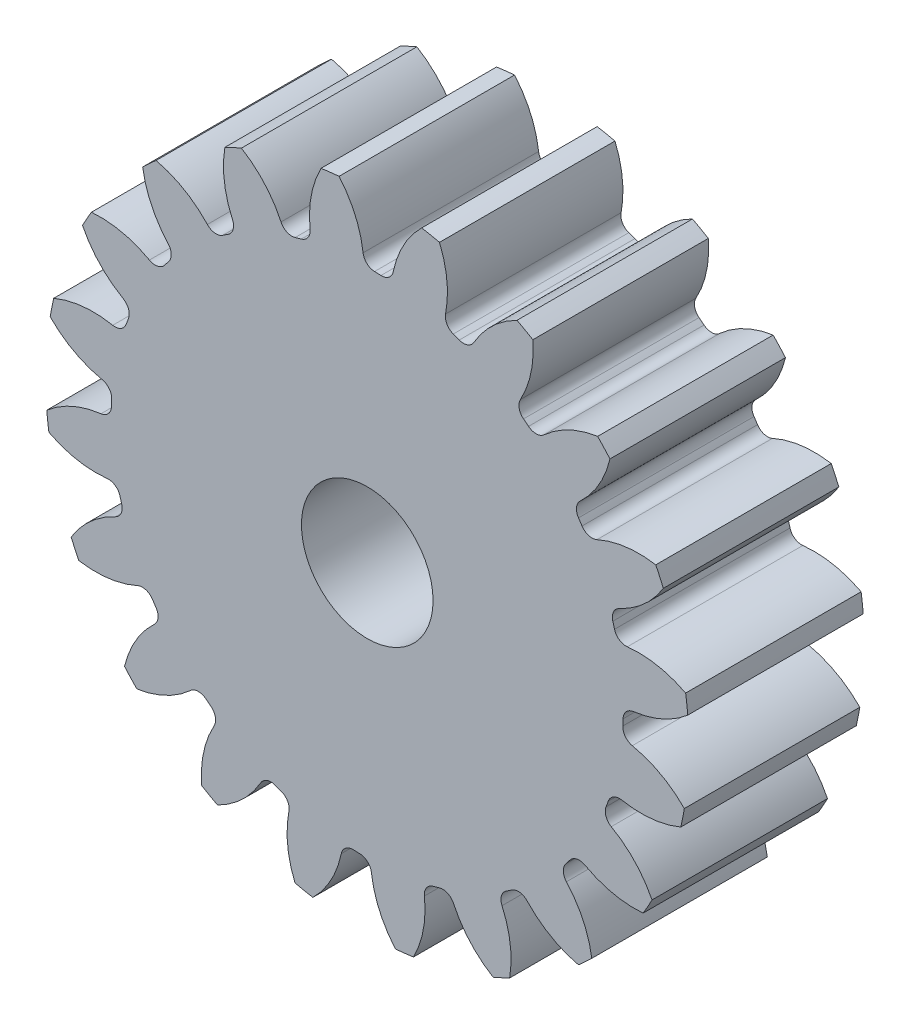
ISO-10303-21;
HEADER;
FILE_DESCRIPTION(('STEP AP214'),'2;1');
FILE_NAME('part.step','',(''),(''),'','','');
FILE_SCHEMA(('AUTOMOTIVE_DESIGN { 1 0 10303 214 1 1 1 1 }'));
ENDSEC;
DATA;
#1=APPLICATION_CONTEXT('core data for automotive mechanical design processes');
#2=APPLICATION_PROTOCOL_DEFINITION('international standard','automotive_design',2000,#1);
#3=PRODUCT_CONTEXT('',#1,'mechanical');
#4=PRODUCT('Part','Part','',(#3));
#5=PRODUCT_RELATED_PRODUCT_CATEGORY('part','',(#4));
#6=PRODUCT_DEFINITION_FORMATION('','',#4);
#7=PRODUCT_DEFINITION_CONTEXT('part definition',#1,'design');
#8=PRODUCT_DEFINITION('design','',#6,#7);
#9=PRODUCT_DEFINITION_SHAPE('','',#8);
#10=(LENGTH_UNIT() NAMED_UNIT(*) SI_UNIT(.MILLI.,.METRE.));
#11=(NAMED_UNIT(*) PLANE_ANGLE_UNIT() SI_UNIT($,.RADIAN.));
#12=(NAMED_UNIT(*) SI_UNIT($,.STERADIAN.) SOLID_ANGLE_UNIT());
#13=UNCERTAINTY_MEASURE_WITH_UNIT(LENGTH_MEASURE(1.E-05),#10,'distance_accuracy_value','');
#14=(GEOMETRIC_REPRESENTATION_CONTEXT(3) GLOBAL_UNCERTAINTY_ASSIGNED_CONTEXT((#13)) GLOBAL_UNIT_ASSIGNED_CONTEXT((#10,
#11,#12)) REPRESENTATION_CONTEXT('',''));
#15=CARTESIAN_POINT('',(0.,0.,0.));
#16=DIRECTION('',(0.,0.,1.));
#17=DIRECTION('',(1.,0.,0.));
#18=AXIS2_PLACEMENT_3D('',#15,#16,#17);
#19=CARTESIAN_POINT('',(0.,0.,101.6));
#20=DIRECTION('',(0.,0.,-1.));
#21=DIRECTION('',(-1.,0.,0.));
#22=AXIS2_PLACEMENT_3D('',#19,#20,#21);
#23=CYLINDRICAL_SURFACE('',#22,186.266666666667);
#24=DIRECTION('',(0.,0.,-1.));
#25=VECTOR('',#24,1.);
#26=CARTESIAN_POINT('',(184.331323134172,26.7812326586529,50.8));
#27=LINE('',#26,#25);
#28=CARTESIAN_POINT('',(184.331323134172,26.7812326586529,101.6));
#29=VERTEX_POINT('',#28);
#30=CARTESIAN_POINT('',(184.331323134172,26.7812326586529,0.));
#31=VERTEX_POINT('',#30);
#32=EDGE_CURVE('E816',#29,#31,#27,.T.);
#33=ORIENTED_EDGE('',*,*,#32,.F.);
#34=CARTESIAN_POINT('',(0.,0.,101.6));
#35=DIRECTION('',(0.,0.,1.));
#36=DIRECTION('',(1.,0.,0.));
#37=AXIS2_PLACEMENT_3D('',#34,#35,#36);
#38=CIRCLE('',#37,186.266666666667);
#39=CARTESIAN_POINT('',(185.550274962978,16.320740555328,101.6));
#40=VERTEX_POINT('',#39);
#41=EDGE_CURVE('E1537',#40,#29,#38,.T.);
#42=ORIENTED_EDGE('',*,*,#41,.F.);
#43=DIRECTION('',(0.,0.,-1.));
#44=VECTOR('',#43,1.);
#45=CARTESIAN_POINT('',(185.550274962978,16.3207405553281,50.8));
#46=LINE('',#45,#44);
#47=CARTESIAN_POINT('',(185.550274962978,16.320740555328,0.));
#48=VERTEX_POINT('',#47);
#49=EDGE_CURVE('E1531',#48,#40,#46,.F.);
#50=ORIENTED_EDGE('',*,*,#49,.F.);
#51=CARTESIAN_POINT('',(0.,0.,0.));
#52=DIRECTION('',(0.,0.,1.));
#53=DIRECTION('',(1.,0.,0.));
#54=AXIS2_PLACEMENT_3D('',#51,#52,#53);
#55=CIRCLE('',#54,186.266666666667);
#56=EDGE_CURVE('E1542',#48,#31,#55,.T.);
#57=ORIENTED_EDGE('',*,*,#56,.T.);
#58=EDGE_LOOP('',(#33,#42,#50,#57));
#59=FACE_BOUND('',#58,.T.);
#60=ADVANCED_FACE('F33',(#59),#23,.T.);
#61=DIRECTION('',(0.,0.,-1.));
#62=VECTOR('',#61,1.);
#63=CARTESIAN_POINT('',(171.425411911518,72.8601349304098,50.8));
#64=LINE('',#63,#62);
#65=CARTESIAN_POINT('',(171.425411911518,72.8601349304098,0.));
#66=VERTEX_POINT('',#65);
#67=CARTESIAN_POINT('',(171.425411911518,72.8601349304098,101.6));
#68=VERTEX_POINT('',#67);
#69=EDGE_CURVE('E787',#66,#68,#64,.F.);
#70=ORIENTED_EDGE('',*,*,#69,.F.);
#71=CARTESIAN_POINT('',(167.033650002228,82.4319772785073,0.));
#72=VERTEX_POINT('',#71);
#73=EDGE_CURVE('E1545',#66,#72,#55,.T.);
#74=ORIENTED_EDGE('',*,*,#73,.T.);
#75=DIRECTION('',(0.,0.,-1.));
#76=VECTOR('',#75,1.);
#77=CARTESIAN_POINT('',(167.033650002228,82.4319772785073,50.8));
#78=LINE('',#77,#76);
#79=CARTESIAN_POINT('',(167.033650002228,82.4319772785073,101.6));
#80=VERTEX_POINT('',#79);
#81=EDGE_CURVE('E849',#80,#72,#78,.T.);
#82=ORIENTED_EDGE('',*,*,#81,.F.);
#83=EDGE_CURVE('E1540',#68,#80,#38,.T.);
#84=ORIENTED_EDGE('',*,*,#83,.F.);
#85=EDGE_LOOP('',(#70,#74,#82,#84));
#86=FACE_BOUND('',#85,.T.);
#87=ADVANCED_FACE('F1771',(#86),#23,.T.);
#88=CARTESIAN_POINT('',(0.,0.,101.6));
#89=DIRECTION('',(0.,0.,1.));
#90=DIRECTION('',(1.,0.,0.));
#91=AXIS2_PLACEMENT_3D('',#88,#89,#90);
#92=PLANE('',#91);
#93=CARTESIAN_POINT('',(0.,0.,101.599999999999));
#94=DIRECTION('',(0.,0.,1.));
#95=DIRECTION('',(1.,0.,0.));
#96=AXIS2_PLACEMENT_3D('',#93,#94,#95);
#97=CIRCLE('',#96,38.1);
#98=CARTESIAN_POINT('',(38.1,0.,101.599999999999));
#99=VERTEX_POINT('',#98);
#100=EDGE_CURVE('E804',#99,#99,#97,.T.);
#101=ORIENTED_EDGE('',*,*,#100,.F.);
#102=EDGE_LOOP('',(#101));
#103=FACE_BOUND('',#102,.T.);
#104=ORIENTED_EDGE('',*,*,#41,.T.);
#105=CARTESIAN_POINT('',(157.071413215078,-25.4588708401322,101.6));
#106=DIRECTION('',(0.,0.,-1.));
#107=DIRECTION('',(0.951056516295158,0.309016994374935,0.));
#108=AXIS2_PLACEMENT_3D('',#105,#106,#107);
#109=CIRCLE('',#108,58.9247919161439);
#110=CARTESIAN_POINT('',(150.580903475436,33.107368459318,101.6));
#111=VERTEX_POINT('',#110);
#112=EDGE_CURVE('E796',#111,#29,#109,.T.);
#113=ORIENTED_EDGE('',*,*,#112,.F.);
#114=CARTESIAN_POINT('',(149.821770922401,39.9572986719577,101.6));
#115=DIRECTION('',(0.,0.,1.));
#116=DIRECTION('',(-0.951056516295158,-0.309016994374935,0.));
#117=AXIS2_PLACEMENT_3D('',#114,#115,#116);
#118=CIRCLE('',#117,6.89186666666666);
#119=CARTESIAN_POINT('',(143.16266196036,38.1813217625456,101.6));
#120=VERTEX_POINT('',#119);
#121=EDGE_CURVE('E794',#120,#111,#118,.T.);
#122=ORIENTED_EDGE('',*,*,#121,.F.);
#123=CARTESIAN_POINT('',(0.,0.,101.6));
#124=DIRECTION('',(0.,0.,-1.));
#125=DIRECTION('',(0.951056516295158,0.309016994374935,0.));
#126=AXIS2_PLACEMENT_3D('',#123,#124,#125);
#127=CIRCLE('',#126,148.166666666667);
#128=CARTESIAN_POINT('',(142.167409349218,41.7347436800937,101.6));
#129=VERTEX_POINT('',#128);
#130=EDGE_CURVE('E779',#129,#120,#127,.T.);
#131=ORIENTED_EDGE('',*,*,#130,.F.);
#132=CARTESIAN_POINT('',(148.780224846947,43.6760054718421,101.6));
#133=DIRECTION('',(0.,0.,1.));
#134=DIRECTION('',(-0.951056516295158,-0.309016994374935,0.));
#135=AXIS2_PLACEMENT_3D('',#132,#133,#134);
#136=CIRCLE('',#135,6.89186666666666);
#137=CARTESIAN_POINT('',(145.870933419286,49.923713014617,101.6));
#138=VERTEX_POINT('',#137);
#139=EDGE_CURVE('E771',#138,#129,#136,.T.);
#140=ORIENTED_EDGE('',*,*,#139,.F.);
#141=CARTESIAN_POINT('',(120.996773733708,103.341006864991,101.6));
#142=DIRECTION('',(0.,0.,-1.));
#143=DIRECTION('',(-0.951056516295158,-0.309016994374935,0.));
#144=AXIS2_PLACEMENT_3D('',#141,#142,#143);
#145=CIRCLE('',#144,58.9247919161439);
#146=EDGE_CURVE('E801',#68,#138,#145,.T.);
#147=ORIENTED_EDGE('',*,*,#146,.F.);
#148=ORIENTED_EDGE('',*,*,#83,.T.);
#149=CARTESIAN_POINT('',(157.251014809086,24.3249110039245,101.6));
#150=DIRECTION('',(0.,0.,-1.));
#151=DIRECTION('',(0.809016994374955,0.587785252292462,0.));
#152=AXIS2_PLACEMENT_3D('',#149,#150,#151);
#153=CIRCLE('',#152,58.9247919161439);
#154=CARTESIAN_POINT('',(132.980209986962,78.0190367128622,101.6));
#155=VERTEX_POINT('',#154);
#156=EDGE_CURVE('E825',#155,#80,#153,.T.);
#157=ORIENTED_EDGE('',*,*,#156,.F.);
#158=CARTESIAN_POINT('',(130.141487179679,84.2991226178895,101.6));
#159=DIRECTION('',(0.,0.,1.));
#160=DIRECTION('',(-0.809016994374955,-0.587785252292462,0.));
#161=AXIS2_PLACEMENT_3D('',#158,#159,#160);
#162=CIRCLE('',#161,6.89186666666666);
#163=CARTESIAN_POINT('',(124.357105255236,80.5522903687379,101.6));
#164=VERTEX_POINT('',#163);
#165=EDGE_CURVE('E823',#164,#155,#162,.T.);
#166=ORIENTED_EDGE('',*,*,#165,.F.);
#167=CARTESIAN_POINT('',(0.,0.,101.6));
#168=DIRECTION('',(0.,0.,-1.));
#169=DIRECTION('',(0.809016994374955,0.587785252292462,0.));
#170=AXIS2_PLACEMENT_3D('',#167,#168,#169);
#171=CIRCLE('',#170,148.166666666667);
#172=CARTESIAN_POINT('',(122.312496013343,83.6242454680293,101.6));
#173=VERTEX_POINT('',#172);
#174=EDGE_CURVE('E820',#173,#164,#171,.T.);
#175=ORIENTED_EDGE('',*,*,#174,.F.);
#176=CARTESIAN_POINT('',(128.001774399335,87.5139675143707,101.6));
#177=DIRECTION('',(0.,0.,1.));
#178=DIRECTION('',(-0.809016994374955,-0.587785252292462,0.));
#179=AXIS2_PLACEMENT_3D('',#176,#177,#178);
#180=CIRCLE('',#179,6.89186666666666);
#181=CARTESIAN_POINT('',(123.304226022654,92.5568699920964,101.6));
#182=VERTEX_POINT('',#181);
#183=EDGE_CURVE('E818',#182,#173,#180,.T.);
#184=ORIENTED_EDGE('',*,*,#183,.F.);
#185=CARTESIAN_POINT('',(83.140642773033,135.673197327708,101.6));
#186=DIRECTION('',(0.,0.,-1.));
#187=DIRECTION('',(-0.809016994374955,-0.587785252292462,0.));
#188=AXIS2_PLACEMENT_3D('',#185,#186,#187);
#189=CIRCLE('',#188,58.9247919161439);
#190=CARTESIAN_POINT('',(140.520235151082,122.267471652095,101.6));
#191=VERTEX_POINT('',#190);
#192=EDGE_CURVE('E828',#191,#182,#189,.T.);
#193=ORIENTED_EDGE('',*,*,#192,.F.);
#194=CARTESIAN_POINT('',(133.385559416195,130.013705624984,101.6));
#195=VERTEX_POINT('',#194);
#196=EDGE_CURVE('E1593',#191,#195,#38,.T.);
#197=ORIENTED_EDGE('',*,*,#196,.T.);
#198=CARTESIAN_POINT('',(142.037791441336,71.7276010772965,101.6));
#199=DIRECTION('',(0.,0.,-1.));
#200=DIRECTION('',(0.587785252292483,0.80901699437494,0.));
#201=AXIS2_PLACEMENT_3D('',#198,#199,#200);
#202=CIRCLE('',#201,58.9247919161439);
#203=CARTESIAN_POINT('',(102.362487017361,115.293658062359,101.6));
#204=VERTEX_POINT('',#203);
#205=EDGE_CURVE('E860',#204,#195,#202,.T.);
#206=ORIENTED_EDGE('',*,*,#205,.F.);
#207=CARTESIAN_POINT('',(97.7220479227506,120.389161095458,101.6));
#208=DIRECTION('',(0.,0.,1.));
#209=DIRECTION('',(-0.587785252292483,-0.80901699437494,0.));
#210=AXIS2_PLACEMENT_3D('',#207,#208,#209);
#211=CIRCLE('',#210,6.89186666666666);
#212=CARTESIAN_POINT('',(93.3786086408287,115.03823955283,101.6));
#213=VERTEX_POINT('',#212);
#214=EDGE_CURVE('E858',#213,#204,#211,.T.);
#215=ORIENTED_EDGE('',*,*,#214,.F.);
#216=CARTESIAN_POINT('',(0.,0.,101.6));
#217=DIRECTION('',(0.,0.,-1.));
#218=DIRECTION('',(0.587785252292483,0.80901699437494,0.));
#219=AXIS2_PLACEMENT_3D('',#216,#217,#218);
#220=CIRCLE('',#219,148.166666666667);
#221=CARTESIAN_POINT('',(90.4847833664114,117.328023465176,101.6));
#222=VERTEX_POINT('',#221);
#223=EDGE_CURVE('E855',#222,#213,#220,.T.);
#224=ORIENTED_EDGE('',*,*,#223,.F.);
#225=CARTESIAN_POINT('',(94.6936184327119,122.785452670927,101.6));
#226=DIRECTION('',(0.,0.,1.));
#227=DIRECTION('',(-0.587785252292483,-0.80901699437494,0.));
#228=AXIS2_PLACEMENT_3D('',#225,#226,#227);
#229=CIRCLE('',#228,6.89186666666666);
#230=CARTESIAN_POINT('',(88.6676418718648,126.129915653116,101.6));
#231=VERTEX_POINT('',#230);
#232=EDGE_CURVE('E853',#231,#222,#229,.T.);
#233=ORIENTED_EDGE('',*,*,#232,.F.);
#234=CARTESIAN_POINT('',(37.1461264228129,154.724749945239,101.6));
#235=DIRECTION('',(0.,0.,-1.));
#236=DIRECTION('',(-0.587785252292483,-0.80901699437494,0.));
#237=AXIS2_PLACEMENT_3D('',#234,#235,#236);
#238=CIRCLE('',#237,58.9247919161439);
#239=CARTESIAN_POINT('',(95.8599587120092,159.706416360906,101.6));
#240=VERTEX_POINT('',#239);
#241=EDGE_CURVE('E863',#240,#231,#238,.T.);
#242=ORIENTED_EDGE('',*,*,#241,.F.);
#243=CARTESIAN_POINT('',(86.6807609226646,164.868786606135,101.6));
#244=VERTEX_POINT('',#243);
#245=EDGE_CURVE('E1753',#240,#244,#38,.T.);
#246=ORIENTED_EDGE('',*,*,#245,.T.);
#247=CARTESIAN_POINT('',(112.920919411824,112.10909380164,101.6));
#248=DIRECTION('',(0.,0.,-1.));
#249=DIRECTION('',(0.309016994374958,0.95105651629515,0.));
#250=AXIS2_PLACEMENT_3D('',#247,#248,#249);
#251=CIRCLE('',#250,58.9247919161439);
#252=CARTESIAN_POINT('',(61.7248106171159,141.282532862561,101.6));
#253=VERTEX_POINT('',#252);
#254=EDGE_CURVE('E898',#253,#244,#251,.T.);
#255=ORIENTED_EDGE('',*,*,#254,.F.);
#256=CARTESIAN_POINT('',(55.7368937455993,144.694669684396,101.6));
#257=DIRECTION('',(0.,0.,1.));
#258=DIRECTION('',(-0.309016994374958,-0.95105651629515,0.));
#259=AXIS2_PLACEMENT_3D('',#256,#257,#258);
#260=CIRCLE('',#259,6.89186666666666);
#261=CARTESIAN_POINT('',(53.2595632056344,138.263444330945,101.6));
#262=VERTEX_POINT('',#261);
#263=EDGE_CURVE('E896',#262,#253,#260,.T.);
#264=ORIENTED_EDGE('',*,*,#263,.F.);
#265=CARTESIAN_POINT('',(0.,0.,101.6));
#266=DIRECTION('',(0.,0.,-1.));
#267=DIRECTION('',(0.309016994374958,0.95105651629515,0.));
#268=AXIS2_PLACEMENT_3D('',#265,#266,#267);
#269=CIRCLE('',#268,148.166666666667);
#270=CARTESIAN_POINT('',(49.7997896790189,139.546917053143,101.6));
#271=VERTEX_POINT('',#270);
#272=EDGE_CURVE('E893',#271,#262,#269,.T.);
#273=ORIENTED_EDGE('',*,*,#272,.F.);
#274=CARTESIAN_POINT('',(52.1161913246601,146.0378422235,101.6));
#275=DIRECTION('',(0.,0.,1.));
#276=DIRECTION('',(-0.309016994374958,-0.95105651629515,0.));
#277=AXIS2_PLACEMENT_3D('',#274,#275,#276);
#278=CIRCLE('',#277,6.89186666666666);
#279=CARTESIAN_POINT('',(45.3516511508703,147.356486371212,101.6));
#280=VERTEX_POINT('',#279);
#281=EDGE_CURVE('E891',#280,#271,#278,.T.);
#282=ORIENTED_EDGE('',*,*,#281,.F.);
#283=CARTESIAN_POINT('',(-12.4845115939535,158.630766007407,101.6));
#284=DIRECTION('',(0.,0.,-1.));
#285=DIRECTION('',(-0.309016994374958,-0.95105651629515,0.));
#286=AXIS2_PLACEMENT_3D('',#283,#284,#285);
#287=CIRCLE('',#286,58.9247919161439);
#288=CARTESIAN_POINT('',(41.8162416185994,181.512184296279,101.6));
#289=VERTEX_POINT('',#288);
#290=EDGE_CURVE('E901',#289,#280,#287,.T.);
#291=ORIENTED_EDGE('',*,*,#290,.F.);
#292=CARTESIAN_POINT('',(31.49104560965,183.585362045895,101.6));
#293=VERTEX_POINT('',#292);
#294=EDGE_CURVE('E1749',#289,#293,#38,.T.);
#295=ORIENTED_EDGE('',*,*,#294,.T.);
#296=CARTESIAN_POINT('',(72.7505610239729,141.516567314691,101.6));
#297=DIRECTION('',(0.,0.,-1.));
#298=DIRECTION('',(0.,1.,0.));
#299=AXIS2_PLACEMENT_3D('',#296,#297,#298);
#300=CIRCLE('',#299,58.9247919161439);
#301=CARTESIAN_POINT('',(15.0450796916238,153.441688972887,101.6));
#302=VERTEX_POINT('',#301);
#303=EDGE_CURVE('E936',#302,#293,#300,.T.);
#304=ORIENTED_EDGE('',*,*,#303,.F.);
#305=CARTESIAN_POINT('',(8.29582406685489,154.83645585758,101.6));
#306=DIRECTION('',(0.,0.,1.));
#307=DIRECTION('',(0.,-1.,0.));
#308=AXIS2_PLACEMENT_3D('',#305,#306,#307);
#309=CIRCLE('',#308,6.89186666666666);
#310=CARTESIAN_POINT('',(7.92710064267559,147.954459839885,101.6));
#311=VERTEX_POINT('',#310);
#312=EDGE_CURVE('E934',#311,#302,#309,.T.);
#313=ORIENTED_EDGE('',*,*,#312,.F.);
#314=CARTESIAN_POINT('',(0.,0.,101.6));
#315=DIRECTION('',(0.,0.,-1.));
#316=DIRECTION('',(0.,1.,0.));
#317=AXIS2_PLACEMENT_3D('',#314,#315,#316);
#318=CIRCLE('',#317,148.166666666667);
#319=CARTESIAN_POINT('',(4.24004560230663,148.105986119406,101.6));
#320=VERTEX_POINT('',#319);
#321=EDGE_CURVE('E931',#320,#311,#318,.T.);
#322=ORIENTED_EDGE('',*,*,#321,.F.);
#323=CARTESIAN_POINT('',(4.43726829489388,154.99503027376,101.6));
#324=DIRECTION('',(0.,0.,1.));
#325=DIRECTION('',(0.,-1.,0.));
#326=AXIS2_PLACEMENT_3D('',#323,#324,#325);
#327=CIRCLE('',#326,6.89186666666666);
#328=CARTESIAN_POINT('',(-2.40367516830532,154.158777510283,101.6));
#329=VERTEX_POINT('',#328);
#330=EDGE_CURVE('E929',#329,#320,#327,.T.);
#331=ORIENTED_EDGE('',*,*,#330,.F.);
#332=CARTESIAN_POINT('',(-60.8930786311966,147.008897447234,101.6));
#333=DIRECTION('',(0.,0.,-1.));
#334=DIRECTION('',(0.,-1.,0.));
#335=AXIS2_PLACEMENT_3D('',#332,#333,#334);
#336=CIRCLE('',#335,58.9247919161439);
#337=CARTESIAN_POINT('',(-16.3207405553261,185.550274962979,101.6));
#338=VERTEX_POINT('',#337);
#339=EDGE_CURVE('E939',#338,#329,#336,.T.);
#340=ORIENTED_EDGE('',*,*,#339,.F.);
#341=CARTESIAN_POINT('',(-26.7812326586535,184.331323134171,101.6));
#342=VERTEX_POINT('',#341);
#343=EDGE_CURVE('E1745',#338,#342,#38,.T.);
#344=ORIENTED_EDGE('',*,*,#343,.T.);
#345=CARTESIAN_POINT('',(25.4588708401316,157.071413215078,101.6));
#346=DIRECTION('',(0.,0.,-1.));
#347=DIRECTION('',(-0.309016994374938,0.951056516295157,0.));
#348=AXIS2_PLACEMENT_3D('',#345,#346,#347);
#349=CIRCLE('',#348,58.9247919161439);
#350=CARTESIAN_POINT('',(-33.1073684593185,150.580903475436,101.6));
#351=VERTEX_POINT('',#350);
#352=EDGE_CURVE('E974',#351,#342,#349,.T.);
#353=ORIENTED_EDGE('',*,*,#352,.F.);
#354=CARTESIAN_POINT('',(-39.9572986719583,149.821770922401,101.6));
#355=DIRECTION('',(0.,0.,1.));
#356=DIRECTION('',(0.309016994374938,-0.951056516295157,0.));
#357=AXIS2_PLACEMENT_3D('',#354,#355,#356);
#358=CIRCLE('',#357,6.89186666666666);
#359=CARTESIAN_POINT('',(-38.1813217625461,143.162661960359,101.6));
#360=VERTEX_POINT('',#359);
#361=EDGE_CURVE('E972',#360,#351,#358,.T.);
#362=ORIENTED_EDGE('',*,*,#361,.F.);
#363=CARTESIAN_POINT('',(0.,0.,101.6));
#364=DIRECTION('',(0.,0.,-1.));
#365=DIRECTION('',(-0.309016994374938,0.951056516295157,0.));
#366=AXIS2_PLACEMENT_3D('',#363,#364,#365);
#367=CIRCLE('',#366,148.166666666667);
#368=CARTESIAN_POINT('',(-41.7347436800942,142.167409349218,101.6));
#369=VERTEX_POINT('',#368);
#370=EDGE_CURVE('E969',#369,#360,#367,.T.);
#371=ORIENTED_EDGE('',*,*,#370,.F.);
#372=CARTESIAN_POINT('',(-43.6760054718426,148.780224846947,101.6));
#373=DIRECTION('',(0.,0.,1.));
#374=DIRECTION('',(0.309016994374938,-0.951056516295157,0.));
#375=AXIS2_PLACEMENT_3D('',#372,#373,#374);
#376=CIRCLE('',#375,6.89186666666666);
#377=CARTESIAN_POINT('',(-49.9237130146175,145.870933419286,101.6));
#378=VERTEX_POINT('',#377);
#379=EDGE_CURVE('E967',#378,#369,#376,.T.);
#380=ORIENTED_EDGE('',*,*,#379,.F.);
#381=CARTESIAN_POINT('',(-103.341006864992,120.996773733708,101.6));
#382=DIRECTION('',(0.,0.,-1.));
#383=DIRECTION('',(0.309016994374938,-0.951056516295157,0.));
#384=AXIS2_PLACEMENT_3D('',#381,#382,#383);
#385=CIRCLE('',#384,58.9247919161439);
#386=CARTESIAN_POINT('',(-72.8601349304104,171.425411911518,101.6));
#387=VERTEX_POINT('',#386);
#388=EDGE_CURVE('E977',#387,#378,#385,.T.);
#389=ORIENTED_EDGE('',*,*,#388,.F.);
#390=CARTESIAN_POINT('',(-82.4319772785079,167.033650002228,101.6));
#391=VERTEX_POINT('',#390);
#392=EDGE_CURVE('E1741',#387,#391,#38,.T.);
#393=ORIENTED_EDGE('',*,*,#392,.T.);
#394=CARTESIAN_POINT('',(-24.3249110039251,157.251014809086,101.6));
#395=DIRECTION('',(0.,0.,-1.));
#396=DIRECTION('',(-0.587785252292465,0.809016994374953,0.));
#397=AXIS2_PLACEMENT_3D('',#394,#395,#396);
#398=CIRCLE('',#397,58.9247919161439);
#399=CARTESIAN_POINT('',(-78.0190367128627,132.980209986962,101.6));
#400=VERTEX_POINT('',#399);
#401=EDGE_CURVE('E1012',#400,#391,#398,.T.);
#402=ORIENTED_EDGE('',*,*,#401,.F.);
#403=CARTESIAN_POINT('',(-84.2991226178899,130.141487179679,101.6));
#404=DIRECTION('',(0.,0.,1.));
#405=DIRECTION('',(0.587785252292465,-0.809016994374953,0.));
#406=AXIS2_PLACEMENT_3D('',#403,#404,#405);
#407=CIRCLE('',#406,6.89186666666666);
#408=CARTESIAN_POINT('',(-80.5522903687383,124.357105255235,101.6));
#409=VERTEX_POINT('',#408);
#410=EDGE_CURVE('E1010',#409,#400,#407,.T.);
#411=ORIENTED_EDGE('',*,*,#410,.F.);
#412=CARTESIAN_POINT('',(0.,0.,101.6));
#413=DIRECTION('',(0.,0.,-1.));
#414=DIRECTION('',(-0.587785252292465,0.809016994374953,0.));
#415=AXIS2_PLACEMENT_3D('',#412,#413,#414);
#416=CIRCLE('',#415,148.166666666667);
#417=CARTESIAN_POINT('',(-83.6242454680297,122.312496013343,101.6));
#418=VERTEX_POINT('',#417);
#419=EDGE_CURVE('E1007',#418,#409,#416,.T.);
#420=ORIENTED_EDGE('',*,*,#419,.F.);
#421=CARTESIAN_POINT('',(-87.5139675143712,128.001774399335,101.6));
#422=DIRECTION('',(0.,0.,1.));
#423=DIRECTION('',(0.587785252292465,-0.809016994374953,0.));
#424=AXIS2_PLACEMENT_3D('',#421,#422,#423);
#425=CIRCLE('',#424,6.89186666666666);
#426=CARTESIAN_POINT('',(-92.5568699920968,123.304226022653,101.6));
#427=VERTEX_POINT('',#426);
#428=EDGE_CURVE('E1005',#427,#418,#425,.T.);
#429=ORIENTED_EDGE('',*,*,#428,.F.);
#430=CARTESIAN_POINT('',(-135.673197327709,83.1406427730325,101.6));
#431=DIRECTION('',(0.,0.,-1.));
#432=DIRECTION('',(0.587785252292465,-0.809016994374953,0.));
#433=AXIS2_PLACEMENT_3D('',#430,#431,#432);
#434=CIRCLE('',#433,58.9247919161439);
#435=CARTESIAN_POINT('',(-122.267471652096,140.520235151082,101.6));
#436=VERTEX_POINT('',#435);
#437=EDGE_CURVE('E1015',#436,#427,#434,.T.);
#438=ORIENTED_EDGE('',*,*,#437,.F.);
#439=CARTESIAN_POINT('',(-130.013705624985,133.385559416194,101.6));
#440=VERTEX_POINT('',#439);
#441=EDGE_CURVE('E1737',#436,#440,#38,.T.);
#442=ORIENTED_EDGE('',*,*,#441,.T.);
#443=CARTESIAN_POINT('',(-71.727601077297,142.037791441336,101.6));
#444=DIRECTION('',(0.,0.,-1.));
#445=DIRECTION('',(-0.809016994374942,0.58778525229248,0.));
#446=AXIS2_PLACEMENT_3D('',#443,#444,#445);
#447=CIRCLE('',#446,58.9247919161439);
#448=CARTESIAN_POINT('',(-115.293658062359,102.36248701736,101.6));
#449=VERTEX_POINT('',#448);
#450=EDGE_CURVE('E1050',#449,#440,#447,.T.);
#451=ORIENTED_EDGE('',*,*,#450,.F.);
#452=CARTESIAN_POINT('',(-120.389161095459,97.7220479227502,101.6));
#453=DIRECTION('',(0.,0.,1.));
#454=DIRECTION('',(0.809016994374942,-0.58778525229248,0.));
#455=AXIS2_PLACEMENT_3D('',#452,#453,#454);
#456=CIRCLE('',#455,6.89186666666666);
#457=CARTESIAN_POINT('',(-115.03823955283,93.3786086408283,101.6));
#458=VERTEX_POINT('',#457);
#459=EDGE_CURVE('E1048',#458,#449,#456,.T.);
#460=ORIENTED_EDGE('',*,*,#459,.F.);
#461=CARTESIAN_POINT('',(0.,0.,101.6));
#462=DIRECTION('',(0.,0.,-1.));
#463=DIRECTION('',(-0.809016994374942,0.58778525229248,0.));
#464=AXIS2_PLACEMENT_3D('',#461,#462,#463);
#465=CIRCLE('',#464,148.166666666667);
#466=CARTESIAN_POINT('',(-117.328023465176,90.484783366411,101.6));
#467=VERTEX_POINT('',#466);
#468=EDGE_CURVE('E1045',#467,#458,#465,.T.);
#469=ORIENTED_EDGE('',*,*,#468,.F.);
#470=CARTESIAN_POINT('',(-122.785452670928,94.6936184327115,101.6));
#471=DIRECTION('',(0.,0.,1.));
#472=DIRECTION('',(0.809016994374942,-0.58778525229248,0.));
#473=AXIS2_PLACEMENT_3D('',#470,#471,#472);
#474=CIRCLE('',#473,6.89186666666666);
#475=CARTESIAN_POINT('',(-126.129915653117,88.6676418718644,101.6));
#476=VERTEX_POINT('',#475);
#477=EDGE_CURVE('E1043',#476,#467,#474,.T.);
#478=ORIENTED_EDGE('',*,*,#477,.F.);
#479=CARTESIAN_POINT('',(-154.724749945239,37.1461264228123,101.6));
#480=DIRECTION('',(0.,0.,-1.));
#481=DIRECTION('',(0.809016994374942,-0.58778525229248,0.));
#482=AXIS2_PLACEMENT_3D('',#479,#480,#481);
#483=CIRCLE('',#482,58.9247919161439);
#484=CARTESIAN_POINT('',(-159.706416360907,95.8599587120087,101.6));
#485=VERTEX_POINT('',#484);
#486=EDGE_CURVE('E1053',#485,#476,#483,.T.);
#487=ORIENTED_EDGE('',*,*,#486,.F.);
#488=CARTESIAN_POINT('',(-164.868786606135,86.680760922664,101.6));
#489=VERTEX_POINT('',#488);
#490=EDGE_CURVE('E1733',#485,#489,#38,.T.);
#491=ORIENTED_EDGE('',*,*,#490,.T.);
#492=CARTESIAN_POINT('',(-112.10909380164,112.920919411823,101.6));
#493=DIRECTION('',(0.,0.,-1.));
#494=DIRECTION('',(-0.951056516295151,0.309016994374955,0.));
#495=AXIS2_PLACEMENT_3D('',#492,#493,#494);
#496=CIRCLE('',#495,58.9247919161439);
#497=CARTESIAN_POINT('',(-141.282532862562,61.7248106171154,101.6));
#498=VERTEX_POINT('',#497);
#499=EDGE_CURVE('E1088',#498,#489,#496,.T.);
#500=ORIENTED_EDGE('',*,*,#499,.F.);
#501=CARTESIAN_POINT('',(-144.694669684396,55.7368937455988,101.6));
#502=DIRECTION('',(0.,0.,1.));
#503=DIRECTION('',(0.951056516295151,-0.309016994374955,0.));
#504=AXIS2_PLACEMENT_3D('',#501,#502,#503);
#505=CIRCLE('',#504,6.89186666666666);
#506=CARTESIAN_POINT('',(-138.263444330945,53.2595632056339,101.6));
#507=VERTEX_POINT('',#506);
#508=EDGE_CURVE('E1086',#507,#498,#505,.T.);
#509=ORIENTED_EDGE('',*,*,#508,.F.);
#510=CARTESIAN_POINT('',(0.,0.,101.6));
#511=DIRECTION('',(0.,0.,-1.));
#512=DIRECTION('',(-0.951056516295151,0.309016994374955,0.));
#513=AXIS2_PLACEMENT_3D('',#510,#511,#512);
#514=CIRCLE('',#513,148.166666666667);
#515=CARTESIAN_POINT('',(-139.546917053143,49.7997896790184,101.6));
#516=VERTEX_POINT('',#515);
#517=EDGE_CURVE('E1083',#516,#507,#514,.T.);
#518=ORIENTED_EDGE('',*,*,#517,.F.);
#519=CARTESIAN_POINT('',(-146.037842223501,52.1161913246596,101.6));
#520=DIRECTION('',(0.,0.,1.));
#521=DIRECTION('',(0.951056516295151,-0.309016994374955,0.));
#522=AXIS2_PLACEMENT_3D('',#519,#520,#521);
#523=CIRCLE('',#522,6.89186666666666);
#524=CARTESIAN_POINT('',(-147.356486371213,45.3516511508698,101.6));
#525=VERTEX_POINT('',#524);
#526=EDGE_CURVE('E1081',#525,#516,#523,.T.);
#527=ORIENTED_EDGE('',*,*,#526,.F.);
#528=CARTESIAN_POINT('',(-158.630766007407,-12.484511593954,101.6));
#529=DIRECTION('',(0.,0.,-1.));
#530=DIRECTION('',(0.951056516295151,-0.309016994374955,0.));
#531=AXIS2_PLACEMENT_3D('',#528,#529,#530);
#532=CIRCLE('',#531,58.9247919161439);
#533=CARTESIAN_POINT('',(-181.512184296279,41.8162416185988,101.6));
#534=VERTEX_POINT('',#533);
#535=EDGE_CURVE('E1091',#534,#525,#532,.T.);
#536=ORIENTED_EDGE('',*,*,#535,.F.);
#537=CARTESIAN_POINT('',(-183.585362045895,31.4910456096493,101.6));
#538=VERTEX_POINT('',#537);
#539=EDGE_CURVE('E1729',#534,#538,#38,.T.);
#540=ORIENTED_EDGE('',*,*,#539,.T.);
#541=CARTESIAN_POINT('',(-141.516567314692,72.7505610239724,101.6));
#542=DIRECTION('',(0.,0.,-1.));
#543=DIRECTION('',(-1.,0.,0.));
#544=AXIS2_PLACEMENT_3D('',#541,#542,#543);
#545=CIRCLE('',#544,58.9247919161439);
#546=CARTESIAN_POINT('',(-153.441688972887,15.0450796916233,101.6));
#547=VERTEX_POINT('',#546);
#548=EDGE_CURVE('E1126',#547,#538,#545,.T.);
#549=ORIENTED_EDGE('',*,*,#548,.F.);
#550=CARTESIAN_POINT('',(-154.83645585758,8.29582406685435,101.6));
#551=DIRECTION('',(0.,0.,1.));
#552=DIRECTION('',(1.,0.,0.));
#553=AXIS2_PLACEMENT_3D('',#550,#551,#552);
#554=CIRCLE('',#553,6.89186666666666);
#555=CARTESIAN_POINT('',(-147.954459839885,7.92710064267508,101.6));
#556=VERTEX_POINT('',#555);
#557=EDGE_CURVE('E1124',#556,#547,#554,.T.);
#558=ORIENTED_EDGE('',*,*,#557,.F.);
#559=CARTESIAN_POINT('',(0.,0.,101.6));
#560=DIRECTION('',(0.,0.,-1.));
#561=DIRECTION('',(-1.,0.,0.));
#562=AXIS2_PLACEMENT_3D('',#559,#560,#561);
#563=CIRCLE('',#562,148.166666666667);
#564=CARTESIAN_POINT('',(-148.105986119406,4.24004560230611,101.6));
#565=VERTEX_POINT('',#564);
#566=EDGE_CURVE('E1121',#565,#556,#563,.T.);
#567=ORIENTED_EDGE('',*,*,#566,.F.);
#568=CARTESIAN_POINT('',(-154.99503027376,4.43726829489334,101.6));
#569=DIRECTION('',(0.,0.,1.));
#570=DIRECTION('',(1.,0.,0.));
#571=AXIS2_PLACEMENT_3D('',#568,#569,#570);
#572=CIRCLE('',#571,6.89186666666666);
#573=CARTESIAN_POINT('',(-154.158777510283,-2.40367516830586,101.6));
#574=VERTEX_POINT('',#573);
#575=EDGE_CURVE('E1119',#574,#565,#572,.T.);
#576=ORIENTED_EDGE('',*,*,#575,.F.);
#577=CARTESIAN_POINT('',(-147.008897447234,-60.8930786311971,101.6));
#578=DIRECTION('',(0.,0.,-1.));
#579=DIRECTION('',(1.,0.,0.));
#580=AXIS2_PLACEMENT_3D('',#577,#578,#579);
#581=CIRCLE('',#580,58.9247919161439);
#582=CARTESIAN_POINT('',(-185.550274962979,-16.3207405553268,101.6));
#583=VERTEX_POINT('',#582);
#584=EDGE_CURVE('E1129',#583,#574,#581,.T.);
#585=ORIENTED_EDGE('',*,*,#584,.F.);
#586=CARTESIAN_POINT('',(-184.331323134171,-26.7812326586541,101.6));
#587=VERTEX_POINT('',#586);
#588=EDGE_CURVE('E1725',#583,#587,#38,.T.);
#589=ORIENTED_EDGE('',*,*,#588,.T.);
#590=CARTESIAN_POINT('',(-157.071413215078,25.4588708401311,101.6));
#591=DIRECTION('',(0.,0.,-1.));
#592=DIRECTION('',(-0.951056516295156,-0.309016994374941,0.));
#593=AXIS2_PLACEMENT_3D('',#590,#591,#592);
#594=CIRCLE('',#593,58.9247919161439);
#595=CARTESIAN_POINT('',(-150.580903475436,-33.107368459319,101.6));
#596=VERTEX_POINT('',#595);
#597=EDGE_CURVE('E1164',#596,#587,#594,.T.);
#598=ORIENTED_EDGE('',*,*,#597,.F.);
#599=CARTESIAN_POINT('',(-149.821770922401,-39.9572986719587,101.6));
#600=DIRECTION('',(0.,0.,1.));
#601=DIRECTION('',(0.951056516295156,0.309016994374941,0.));
#602=AXIS2_PLACEMENT_3D('',#599,#600,#601);
#603=CIRCLE('',#602,6.89186666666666);
#604=CARTESIAN_POINT('',(-143.162661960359,-38.1813217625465,101.6));
#605=VERTEX_POINT('',#604);
#606=EDGE_CURVE('E1162',#605,#596,#603,.T.);
#607=ORIENTED_EDGE('',*,*,#606,.F.);
#608=CARTESIAN_POINT('',(0.,0.,101.6));
#609=DIRECTION('',(0.,0.,-1.));
#610=DIRECTION('',(-0.951056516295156,-0.309016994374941,0.));
#611=AXIS2_PLACEMENT_3D('',#608,#609,#610);
#612=CIRCLE('',#611,148.166666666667);
#613=CARTESIAN_POINT('',(-142.167409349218,-41.7347436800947,101.6));
#614=VERTEX_POINT('',#613);
#615=EDGE_CURVE('E1159',#614,#605,#612,.T.);
#616=ORIENTED_EDGE('',*,*,#615,.F.);
#617=CARTESIAN_POINT('',(-148.780224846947,-43.6760054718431,101.6));
#618=DIRECTION('',(0.,0.,1.));
#619=DIRECTION('',(0.951056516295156,0.309016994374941,0.));
#620=AXIS2_PLACEMENT_3D('',#617,#618,#619);
#621=CIRCLE('',#620,6.89186666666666);
#622=CARTESIAN_POINT('',(-145.870933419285,-49.923713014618,101.6));
#623=VERTEX_POINT('',#622);
#624=EDGE_CURVE('E1157',#623,#614,#621,.T.);
#625=ORIENTED_EDGE('',*,*,#624,.F.);
#626=CARTESIAN_POINT('',(-120.996773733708,-103.341006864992,101.6));
#627=DIRECTION('',(0.,0.,-1.));
#628=DIRECTION('',(0.951056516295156,0.309016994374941,0.));
#629=AXIS2_PLACEMENT_3D('',#626,#627,#628);
#630=CIRCLE('',#629,58.9247919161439);
#631=CARTESIAN_POINT('',(-171.425411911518,-72.8601349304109,101.6));
#632=VERTEX_POINT('',#631);
#633=EDGE_CURVE('E1167',#632,#623,#630,.T.);
#634=ORIENTED_EDGE('',*,*,#633,.F.);
#635=CARTESIAN_POINT('',(-167.033650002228,-82.4319772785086,101.6));
#636=VERTEX_POINT('',#635);
#637=EDGE_CURVE('E1721',#632,#636,#38,.T.);
#638=ORIENTED_EDGE('',*,*,#637,.T.);
#639=CARTESIAN_POINT('',(-157.251014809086,-24.3249110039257,101.6));
#640=DIRECTION('',(0.,0.,-1.));
#641=DIRECTION('',(-0.809016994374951,-0.587785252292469,0.));
#642=AXIS2_PLACEMENT_3D('',#639,#640,#641);
#643=CIRCLE('',#642,58.9247919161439);
#644=CARTESIAN_POINT('',(-132.980209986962,-78.0190367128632,101.6));
#645=VERTEX_POINT('',#644);
#646=EDGE_CURVE('E1202',#645,#636,#643,.T.);
#647=ORIENTED_EDGE('',*,*,#646,.F.);
#648=CARTESIAN_POINT('',(-130.141487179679,-84.2991226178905,101.6));
#649=DIRECTION('',(0.,0.,1.));
#650=DIRECTION('',(0.809016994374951,0.587785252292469,0.));
#651=AXIS2_PLACEMENT_3D('',#648,#649,#650);
#652=CIRCLE('',#651,6.89186666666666);
#653=CARTESIAN_POINT('',(-124.357105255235,-80.5522903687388,101.6));
#654=VERTEX_POINT('',#653);
#655=EDGE_CURVE('E1200',#654,#645,#652,.T.);
#656=ORIENTED_EDGE('',*,*,#655,.F.);
#657=CARTESIAN_POINT('',(0.,0.,101.6));
#658=DIRECTION('',(0.,0.,-1.));
#659=DIRECTION('',(-0.809016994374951,-0.587785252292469,0.));
#660=AXIS2_PLACEMENT_3D('',#657,#658,#659);
#661=CIRCLE('',#660,148.166666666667);
#662=CARTESIAN_POINT('',(-122.312496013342,-83.6242454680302,101.6));
#663=VERTEX_POINT('',#662);
#664=EDGE_CURVE('E1197',#663,#654,#661,.T.);
#665=ORIENTED_EDGE('',*,*,#664,.F.);
#666=CARTESIAN_POINT('',(-128.001774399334,-87.5139675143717,101.6));
#667=DIRECTION('',(0.,0.,1.));
#668=DIRECTION('',(0.809016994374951,0.587785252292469,0.));
#669=AXIS2_PLACEMENT_3D('',#666,#667,#668);
#670=CIRCLE('',#669,6.89186666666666);
#671=CARTESIAN_POINT('',(-123.304226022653,-92.5568699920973,101.6));
#672=VERTEX_POINT('',#671);
#673=EDGE_CURVE('E1195',#672,#663,#670,.T.);
#674=ORIENTED_EDGE('',*,*,#673,.F.);
#675=CARTESIAN_POINT('',(-83.140642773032,-135.673197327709,101.6));
#676=DIRECTION('',(0.,0.,-1.));
#677=DIRECTION('',(0.809016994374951,0.587785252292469,0.));
#678=AXIS2_PLACEMENT_3D('',#675,#676,#677);
#679=CIRCLE('',#678,58.9247919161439);
#680=CARTESIAN_POINT('',(-140.520235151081,-122.267471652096,101.6));
#681=VERTEX_POINT('',#680);
#682=EDGE_CURVE('E1205',#681,#672,#679,.T.);
#683=ORIENTED_EDGE('',*,*,#682,.F.);
#684=CARTESIAN_POINT('',(-133.385559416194,-130.013705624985,101.6));
#685=VERTEX_POINT('',#684);
#686=EDGE_CURVE('E1717',#681,#685,#38,.T.);
#687=ORIENTED_EDGE('',*,*,#686,.T.);
#688=CARTESIAN_POINT('',(-142.037791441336,-71.7276010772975,101.6));
#689=DIRECTION('',(0.,0.,-1.));
#690=DIRECTION('',(-0.587785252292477,-0.809016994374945,0.));
#691=AXIS2_PLACEMENT_3D('',#688,#689,#690);
#692=CIRCLE('',#691,58.9247919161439);
#693=CARTESIAN_POINT('',(-102.36248701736,-115.29365806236,101.6));
#694=VERTEX_POINT('',#693);
#695=EDGE_CURVE('E1240',#694,#685,#692,.T.);
#696=ORIENTED_EDGE('',*,*,#695,.F.);
#697=CARTESIAN_POINT('',(-97.7220479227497,-120.389161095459,101.6));
#698=DIRECTION('',(0.,0.,1.));
#699=DIRECTION('',(0.587785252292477,0.809016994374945,0.));
#700=AXIS2_PLACEMENT_3D('',#697,#698,#699);
#701=CIRCLE('',#700,6.89186666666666);
#702=CARTESIAN_POINT('',(-93.3786086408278,-115.03823955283,101.6));
#703=VERTEX_POINT('',#702);
#704=EDGE_CURVE('E1238',#703,#694,#701,.T.);
#705=ORIENTED_EDGE('',*,*,#704,.F.);
#706=CARTESIAN_POINT('',(0.,0.,101.6));
#707=DIRECTION('',(0.,0.,-1.));
#708=DIRECTION('',(-0.587785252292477,-0.809016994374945,0.));
#709=AXIS2_PLACEMENT_3D('',#706,#707,#708);
#710=CIRCLE('',#709,148.166666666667);
#711=CARTESIAN_POINT('',(-90.4847833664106,-117.328023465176,101.6));
#712=VERTEX_POINT('',#711);
#713=EDGE_CURVE('E1235',#712,#703,#710,.T.);
#714=ORIENTED_EDGE('',*,*,#713,.F.);
#715=CARTESIAN_POINT('',(-94.693618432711,-122.785452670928,101.6));
#716=DIRECTION('',(0.,0.,1.));
#717=DIRECTION('',(0.587785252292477,0.809016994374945,0.));
#718=AXIS2_PLACEMENT_3D('',#715,#716,#717);
#719=CIRCLE('',#718,6.89186666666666);
#720=CARTESIAN_POINT('',(-88.6676418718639,-126.129915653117,101.6));
#721=VERTEX_POINT('',#720);
#722=EDGE_CURVE('E1233',#721,#712,#719,.T.);
#723=ORIENTED_EDGE('',*,*,#722,.F.);
#724=CARTESIAN_POINT('',(-37.1461264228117,-154.724749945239,101.6));
#725=DIRECTION('',(0.,0.,-1.));
#726=DIRECTION('',(0.587785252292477,0.809016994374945,0.));
#727=AXIS2_PLACEMENT_3D('',#724,#725,#726);
#728=CIRCLE('',#727,58.9247919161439);
#729=CARTESIAN_POINT('',(-95.859958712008,-159.706416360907,101.6));
#730=VERTEX_POINT('',#729);
#731=EDGE_CURVE('E1243',#730,#721,#728,.T.);
#732=ORIENTED_EDGE('',*,*,#731,.F.);
#733=CARTESIAN_POINT('',(-86.6807609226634,-164.868786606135,101.6));
#734=VERTEX_POINT('',#733);
#735=EDGE_CURVE('E1713',#730,#734,#38,.T.);
#736=ORIENTED_EDGE('',*,*,#735,.T.);
#737=CARTESIAN_POINT('',(-112.920919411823,-112.10909380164,101.6));
#738=DIRECTION('',(0.,0.,-1.));
#739=DIRECTION('',(-0.309016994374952,-0.951056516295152,0.));
#740=AXIS2_PLACEMENT_3D('',#737,#738,#739);
#741=CIRCLE('',#740,58.9247919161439);
#742=CARTESIAN_POINT('',(-61.7248106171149,-141.282532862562,101.6));
#743=VERTEX_POINT('',#742);
#744=EDGE_CURVE('E1278',#743,#734,#741,.T.);
#745=ORIENTED_EDGE('',*,*,#744,.F.);
#746=CARTESIAN_POINT('',(-55.7368937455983,-144.694669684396,101.6));
#747=DIRECTION('',(0.,0.,1.));
#748=DIRECTION('',(0.309016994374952,0.951056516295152,0.));
#749=AXIS2_PLACEMENT_3D('',#746,#747,#748);
#750=CIRCLE('',#749,6.89186666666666);
#751=CARTESIAN_POINT('',(-53.2595632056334,-138.263444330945,101.6));
#752=VERTEX_POINT('',#751);
#753=EDGE_CURVE('E1276',#752,#743,#750,.T.);
#754=ORIENTED_EDGE('',*,*,#753,.F.);
#755=CARTESIAN_POINT('',(0.,0.,101.6));
#756=DIRECTION('',(0.,0.,-1.));
#757=DIRECTION('',(-0.309016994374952,-0.951056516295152,0.));
#758=AXIS2_PLACEMENT_3D('',#755,#756,#757);
#759=CIRCLE('',#758,148.166666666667);
#760=CARTESIAN_POINT('',(-49.7997896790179,-139.546917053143,101.6));
#761=VERTEX_POINT('',#760);
#762=EDGE_CURVE('E1273',#761,#752,#759,.T.);
#763=ORIENTED_EDGE('',*,*,#762,.F.);
#764=CARTESIAN_POINT('',(-52.116191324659,-146.037842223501,101.6));
#765=DIRECTION('',(0.,0.,1.));
#766=DIRECTION('',(0.309016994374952,0.951056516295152,0.));
#767=AXIS2_PLACEMENT_3D('',#764,#765,#766);
#768=CIRCLE('',#767,6.89186666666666);
#769=CARTESIAN_POINT('',(-45.3516511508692,-147.356486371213,101.6));
#770=VERTEX_POINT('',#769);
#771=EDGE_CURVE('E1271',#770,#761,#768,.T.);
#772=ORIENTED_EDGE('',*,*,#771,.F.);
#773=CARTESIAN_POINT('',(12.4845115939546,-158.630766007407,101.6));
#774=DIRECTION('',(0.,0.,-1.));
#775=DIRECTION('',(0.309016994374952,0.951056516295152,0.));
#776=AXIS2_PLACEMENT_3D('',#773,#774,#775);
#777=CIRCLE('',#776,58.9247919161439);
#778=CARTESIAN_POINT('',(-41.8162416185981,-181.512184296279,101.6));
#779=VERTEX_POINT('',#778);
#780=EDGE_CURVE('E1281',#779,#770,#777,.T.);
#781=ORIENTED_EDGE('',*,*,#780,.F.);
#782=CARTESIAN_POINT('',(-31.4910456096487,-183.585362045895,101.6));
#783=VERTEX_POINT('',#782);
#784=EDGE_CURVE('E1709',#779,#783,#38,.T.);
#785=ORIENTED_EDGE('',*,*,#784,.T.);
#786=CARTESIAN_POINT('',(-72.7505610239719,-141.516567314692,101.6));
#787=DIRECTION('',(0.,0.,-1.));
#788=DIRECTION('',(0.,-1.,0.));
#789=AXIS2_PLACEMENT_3D('',#786,#787,#788);
#790=CIRCLE('',#789,58.9247919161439);
#791=CARTESIAN_POINT('',(-15.0450796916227,-153.441688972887,101.6));
#792=VERTEX_POINT('',#791);
#793=EDGE_CURVE('E1316',#792,#783,#790,.T.);
#794=ORIENTED_EDGE('',*,*,#793,.F.);
#795=CARTESIAN_POINT('',(-8.29582406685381,-154.83645585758,101.6));
#796=DIRECTION('',(0.,0.,1.));
#797=DIRECTION('',(0.,1.,0.));
#798=AXIS2_PLACEMENT_3D('',#795,#796,#797);
#799=CIRCLE('',#798,6.89186666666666);
#800=CARTESIAN_POINT('',(-7.92710064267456,-147.954459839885,101.6));
#801=VERTEX_POINT('',#800);
#802=EDGE_CURVE('E1314',#801,#792,#799,.T.);
#803=ORIENTED_EDGE('',*,*,#802,.F.);
#804=CARTESIAN_POINT('',(0.,0.,101.6));
#805=DIRECTION('',(0.,0.,-1.));
#806=DIRECTION('',(0.,-1.,0.));
#807=AXIS2_PLACEMENT_3D('',#804,#805,#806);
#808=CIRCLE('',#807,148.166666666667);
#809=CARTESIAN_POINT('',(-4.2400456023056,-148.105986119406,101.6));
#810=VERTEX_POINT('',#809);
#811=EDGE_CURVE('E1311',#810,#801,#808,.T.);
#812=ORIENTED_EDGE('',*,*,#811,.F.);
#813=CARTESIAN_POINT('',(-4.4372682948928,-154.99503027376,101.6));
#814=DIRECTION('',(0.,0.,1.));
#815=DIRECTION('',(0.,1.,0.));
#816=AXIS2_PLACEMENT_3D('',#813,#814,#815);
#817=CIRCLE('',#816,6.89186666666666);
#818=CARTESIAN_POINT('',(2.40367516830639,-154.158777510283,101.6));
#819=VERTEX_POINT('',#818);
#820=EDGE_CURVE('E1309',#819,#810,#817,.T.);
#821=ORIENTED_EDGE('',*,*,#820,.F.);
#822=CARTESIAN_POINT('',(60.8930786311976,-147.008897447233,101.6));
#823=DIRECTION('',(0.,0.,-1.));
#824=DIRECTION('',(0.,1.,0.));
#825=AXIS2_PLACEMENT_3D('',#822,#823,#824);
#826=CIRCLE('',#825,58.9247919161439);
#827=CARTESIAN_POINT('',(16.3207405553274,-185.550274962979,101.6));
#828=VERTEX_POINT('',#827);
#829=EDGE_CURVE('E1319',#828,#819,#826,.T.);
#830=ORIENTED_EDGE('',*,*,#829,.F.);
#831=CARTESIAN_POINT('',(26.7812326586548,-184.331323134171,101.6));
#832=VERTEX_POINT('',#831);
#833=EDGE_CURVE('E1705',#828,#832,#38,.T.);
#834=ORIENTED_EDGE('',*,*,#833,.T.);
#835=CARTESIAN_POINT('',(-25.4588708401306,-157.071413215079,101.6));
#836=DIRECTION('',(0.,0.,-1.));
#837=DIRECTION('',(0.309016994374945,-0.951056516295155,0.));
#838=AXIS2_PLACEMENT_3D('',#835,#836,#837);
#839=CIRCLE('',#838,58.9247919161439);
#840=CARTESIAN_POINT('',(33.1073684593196,-150.580903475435,101.6));
#841=VERTEX_POINT('',#840);
#842=EDGE_CURVE('E1354',#841,#832,#839,.T.);
#843=ORIENTED_EDGE('',*,*,#842,.F.);
#844=CARTESIAN_POINT('',(39.9572986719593,-149.821770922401,101.6));
#845=DIRECTION('',(0.,0.,1.));
#846=DIRECTION('',(-0.309016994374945,0.951056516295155,0.));
#847=AXIS2_PLACEMENT_3D('',#844,#845,#846);
#848=CIRCLE('',#847,6.89186666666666);
#849=CARTESIAN_POINT('',(38.1813217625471,-143.162661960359,101.6));
#850=VERTEX_POINT('',#849);
#851=EDGE_CURVE('E1352',#850,#841,#848,.T.);
#852=ORIENTED_EDGE('',*,*,#851,.F.);
#853=CARTESIAN_POINT('',(0.,0.,101.6));
#854=DIRECTION('',(0.,0.,-1.));
#855=DIRECTION('',(0.309016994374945,-0.951056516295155,0.));
#856=AXIS2_PLACEMENT_3D('',#853,#854,#855);
#857=CIRCLE('',#856,148.166666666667);
#858=CARTESIAN_POINT('',(41.7347436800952,-142.167409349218,101.6));
#859=VERTEX_POINT('',#858);
#860=EDGE_CURVE('E1349',#859,#850,#857,.T.);
#861=ORIENTED_EDGE('',*,*,#860,.F.);
#862=CARTESIAN_POINT('',(43.6760054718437,-148.780224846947,101.6));
#863=DIRECTION('',(0.,0.,1.));
#864=DIRECTION('',(-0.309016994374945,0.951056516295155,0.));
#865=AXIS2_PLACEMENT_3D('',#862,#863,#864);
#866=CIRCLE('',#865,6.89186666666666);
#867=CARTESIAN_POINT('',(49.9237130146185,-145.870933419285,101.6));
#868=VERTEX_POINT('',#867);
#869=EDGE_CURVE('E1347',#868,#859,#866,.T.);
#870=ORIENTED_EDGE('',*,*,#869,.F.);
#871=CARTESIAN_POINT('',(103.341006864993,-120.996773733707,101.6));
#872=DIRECTION('',(0.,0.,-1.));
#873=DIRECTION('',(-0.309016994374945,0.951056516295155,0.));
#874=AXIS2_PLACEMENT_3D('',#871,#872,#873);
#875=CIRCLE('',#874,58.9247919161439);
#876=CARTESIAN_POINT('',(72.8601349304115,-171.425411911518,101.6));
#877=VERTEX_POINT('',#876);
#878=EDGE_CURVE('E1357',#877,#868,#875,.T.);
#879=ORIENTED_EDGE('',*,*,#878,.F.);
#880=CARTESIAN_POINT('',(82.4319772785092,-167.033650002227,101.6));
#881=VERTEX_POINT('',#880);
#882=EDGE_CURVE('E1701',#877,#881,#38,.T.);
#883=ORIENTED_EDGE('',*,*,#882,.T.);
#884=CARTESIAN_POINT('',(24.3249110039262,-157.251014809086,101.6));
#885=DIRECTION('',(0.,0.,-1.));
#886=DIRECTION('',(0.587785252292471,-0.809016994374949,0.));
#887=AXIS2_PLACEMENT_3D('',#884,#885,#886);
#888=CIRCLE('',#887,58.9247919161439);
#889=CARTESIAN_POINT('',(78.0190367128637,-132.980209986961,101.6));
#890=VERTEX_POINT('',#889);
#891=EDGE_CURVE('E1392',#890,#881,#888,.T.);
#892=ORIENTED_EDGE('',*,*,#891,.F.);
#893=CARTESIAN_POINT('',(84.2991226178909,-130.141487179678,101.6));
#894=DIRECTION('',(0.,0.,1.));
#895=DIRECTION('',(-0.587785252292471,0.809016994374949,0.));
#896=AXIS2_PLACEMENT_3D('',#893,#894,#895);
#897=CIRCLE('',#896,6.89186666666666);
#898=CARTESIAN_POINT('',(80.5522903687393,-124.357105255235,101.6));
#899=VERTEX_POINT('',#898);
#900=EDGE_CURVE('E1390',#899,#890,#897,.T.);
#901=ORIENTED_EDGE('',*,*,#900,.F.);
#902=CARTESIAN_POINT('',(0.,0.,101.6));
#903=DIRECTION('',(0.,0.,-1.));
#904=DIRECTION('',(0.587785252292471,-0.809016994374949,0.));
#905=AXIS2_PLACEMENT_3D('',#902,#903,#904);
#906=CIRCLE('',#905,148.166666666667);
#907=CARTESIAN_POINT('',(83.6242454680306,-122.312496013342,101.6));
#908=VERTEX_POINT('',#907);
#909=EDGE_CURVE('E1387',#908,#899,#906,.T.);
#910=ORIENTED_EDGE('',*,*,#909,.F.);
#911=CARTESIAN_POINT('',(87.5139675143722,-128.001774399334,101.6));
#912=DIRECTION('',(0.,0.,1.));
#913=DIRECTION('',(-0.587785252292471,0.809016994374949,0.));
#914=AXIS2_PLACEMENT_3D('',#911,#912,#913);
#915=CIRCLE('',#914,6.89186666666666);
#916=CARTESIAN_POINT('',(92.5568699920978,-123.304226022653,101.6));
#917=VERTEX_POINT('',#916);
#918=EDGE_CURVE('E1385',#917,#908,#915,.T.);
#919=ORIENTED_EDGE('',*,*,#918,.F.);
#920=CARTESIAN_POINT('',(135.673197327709,-83.1406427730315,101.6));
#921=DIRECTION('',(0.,0.,-1.));
#922=DIRECTION('',(-0.587785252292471,0.809016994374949,0.));
#923=AXIS2_PLACEMENT_3D('',#920,#921,#922);
#924=CIRCLE('',#923,58.9247919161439);
#925=CARTESIAN_POINT('',(122.267471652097,-140.520235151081,101.6));
#926=VERTEX_POINT('',#925);
#927=EDGE_CURVE('E1395',#926,#917,#924,.T.);
#928=ORIENTED_EDGE('',*,*,#927,.F.);
#929=CARTESIAN_POINT('',(130.013705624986,-133.385559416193,101.6));
#930=VERTEX_POINT('',#929);
#931=EDGE_CURVE('E1697',#926,#930,#38,.T.);
#932=ORIENTED_EDGE('',*,*,#931,.T.);
#933=CARTESIAN_POINT('',(71.727601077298,-142.037791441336,101.6));
#934=DIRECTION('',(0.,0.,-1.));
#935=DIRECTION('',(0.809016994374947,-0.587785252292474,0.));
#936=AXIS2_PLACEMENT_3D('',#933,#934,#935);
#937=CIRCLE('',#936,58.9247919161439);
#938=CARTESIAN_POINT('',(115.29365806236,-102.36248701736,101.6));
#939=VERTEX_POINT('',#938);
#940=EDGE_CURVE('E1430',#939,#930,#937,.T.);
#941=ORIENTED_EDGE('',*,*,#940,.F.);
#942=CARTESIAN_POINT('',(120.389161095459,-97.7220479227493,101.6));
#943=DIRECTION('',(0.,0.,1.));
#944=DIRECTION('',(-0.809016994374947,0.587785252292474,0.));
#945=AXIS2_PLACEMENT_3D('',#942,#943,#944);
#946=CIRCLE('',#945,6.89186666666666);
#947=CARTESIAN_POINT('',(115.038239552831,-93.3786086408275,101.6));
#948=VERTEX_POINT('',#947);
#949=EDGE_CURVE('E1428',#948,#939,#946,.T.);
#950=ORIENTED_EDGE('',*,*,#949,.F.);
#951=CARTESIAN_POINT('',(0.,0.,101.6));
#952=DIRECTION('',(0.,0.,-1.));
#953=DIRECTION('',(0.809016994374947,-0.587785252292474,0.));
#954=AXIS2_PLACEMENT_3D('',#951,#952,#953);
#955=CIRCLE('',#954,148.166666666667);
#956=CARTESIAN_POINT('',(117.328023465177,-90.4847833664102,101.6));
#957=VERTEX_POINT('',#956);
#958=EDGE_CURVE('E1425',#957,#948,#955,.T.);
#959=ORIENTED_EDGE('',*,*,#958,.F.);
#960=CARTESIAN_POINT('',(122.785452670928,-94.6936184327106,101.6));
#961=DIRECTION('',(0.,0.,1.));
#962=DIRECTION('',(-0.809016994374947,0.587785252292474,0.));
#963=AXIS2_PLACEMENT_3D('',#960,#961,#962);
#964=CIRCLE('',#963,6.89186666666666);
#965=CARTESIAN_POINT('',(126.129915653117,-88.6676418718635,101.6));
#966=VERTEX_POINT('',#965);
#967=EDGE_CURVE('E1423',#966,#957,#964,.T.);
#968=ORIENTED_EDGE('',*,*,#967,.F.);
#969=CARTESIAN_POINT('',(154.72474994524,-37.1461264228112,101.6));
#970=DIRECTION('',(0.,0.,-1.));
#971=DIRECTION('',(-0.809016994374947,0.587785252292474,0.));
#972=AXIS2_PLACEMENT_3D('',#969,#970,#971);
#973=CIRCLE('',#972,58.9247919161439);
#974=CARTESIAN_POINT('',(159.706416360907,-95.8599587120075,101.6));
#975=VERTEX_POINT('',#974);
#976=EDGE_CURVE('E1433',#975,#966,#973,.T.);
#977=ORIENTED_EDGE('',*,*,#976,.F.);
#978=CARTESIAN_POINT('',(164.868786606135,-86.6807609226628,101.6));
#979=VERTEX_POINT('',#978);
#980=EDGE_CURVE('E1696',#975,#979,#38,.T.);
#981=ORIENTED_EDGE('',*,*,#980,.T.);
#982=CARTESIAN_POINT('',(112.109093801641,-112.920919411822,101.6));
#983=DIRECTION('',(0.,0.,-1.));
#984=DIRECTION('',(0.951056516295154,-0.309016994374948,0.));
#985=AXIS2_PLACEMENT_3D('',#982,#983,#984);
#986=CIRCLE('',#985,58.9247919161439);
#987=CARTESIAN_POINT('',(141.282532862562,-61.7248106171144,101.6));
#988=VERTEX_POINT('',#987);
#989=EDGE_CURVE('E1468',#988,#979,#986,.T.);
#990=ORIENTED_EDGE('',*,*,#989,.F.);
#991=CARTESIAN_POINT('',(144.694669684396,-55.7368937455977,101.6));
#992=DIRECTION('',(0.,0.,1.));
#993=DIRECTION('',(-0.951056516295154,0.309016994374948,0.));
#994=AXIS2_PLACEMENT_3D('',#991,#992,#993);
#995=CIRCLE('',#994,6.89186666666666);
#996=CARTESIAN_POINT('',(138.263444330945,-53.2595632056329,101.6));
#997=VERTEX_POINT('',#996);
#998=EDGE_CURVE('E1466',#997,#988,#995,.T.);
#999=ORIENTED_EDGE('',*,*,#998,.F.);
#1000=CARTESIAN_POINT('',(0.,0.,101.6));
#1001=DIRECTION('',(0.,0.,-1.));
#1002=DIRECTION('',(0.951056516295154,-0.309016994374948,0.));
#1003=AXIS2_PLACEMENT_3D('',#1000,#1001,#1002);
#1004=CIRCLE('',#1003,148.166666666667);
#1005=CARTESIAN_POINT('',(139.546917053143,-49.7997896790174,101.6));
#1006=VERTEX_POINT('',#1005);
#1007=EDGE_CURVE('E1463',#1006,#997,#1004,.T.);
#1008=ORIENTED_EDGE('',*,*,#1007,.F.);
#1009=CARTESIAN_POINT('',(146.037842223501,-52.1161913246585,101.6));
#1010=DIRECTION('',(0.,0.,1.));
#1011=DIRECTION('',(-0.951056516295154,0.309016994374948,0.));
#1012=AXIS2_PLACEMENT_3D('',#1009,#1010,#1011);
#1013=CIRCLE('',#1012,6.89186666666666);
#1014=CARTESIAN_POINT('',(147.356486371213,-45.3516511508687,101.6));
#1015=VERTEX_POINT('',#1014);
#1016=EDGE_CURVE('E1461',#1015,#1006,#1013,.T.);
#1017=ORIENTED_EDGE('',*,*,#1016,.F.);
#1018=CARTESIAN_POINT('',(158.630766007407,12.4845115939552,101.6));
#1019=DIRECTION('',(0.,0.,-1.));
#1020=DIRECTION('',(-0.951056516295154,0.309016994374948,0.));
#1021=AXIS2_PLACEMENT_3D('',#1018,#1019,#1020);
#1022=CIRCLE('',#1021,58.9247919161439);
#1023=CARTESIAN_POINT('',(181.512184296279,-41.8162416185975,101.6));
#1024=VERTEX_POINT('',#1023);
#1025=EDGE_CURVE('E1471',#1024,#1015,#1022,.T.);
#1026=ORIENTED_EDGE('',*,*,#1025,.F.);
#1027=CARTESIAN_POINT('',(183.585362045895,-31.4910456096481,101.6));
#1028=VERTEX_POINT('',#1027);
#1029=EDGE_CURVE('E1541',#1024,#1028,#38,.T.);
#1030=ORIENTED_EDGE('',*,*,#1029,.T.);
#1031=CARTESIAN_POINT('',(141.516567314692,-72.7505610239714,101.6));
#1032=DIRECTION('',(0.,0.,-1.));
#1033=DIRECTION('',(1.,0.,0.));
#1034=AXIS2_PLACEMENT_3D('',#1031,#1032,#1033);
#1035=CIRCLE('',#1034,58.9247919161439);
#1036=CARTESIAN_POINT('',(153.441688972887,-15.0450796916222,101.6));
#1037=VERTEX_POINT('',#1036);
#1038=EDGE_CURVE('E1506',#1037,#1028,#1035,.T.);
#1039=ORIENTED_EDGE('',*,*,#1038,.F.);
#1040=CARTESIAN_POINT('',(154.83645585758,-8.29582406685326,101.6));
#1041=DIRECTION('',(0.,0.,1.));
#1042=DIRECTION('',(-1.,0.,0.));
#1043=AXIS2_PLACEMENT_3D('',#1040,#1041,#1042);
#1044=CIRCLE('',#1043,6.89186666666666);
#1045=CARTESIAN_POINT('',(147.954459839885,-7.92710064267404,101.6));
#1046=VERTEX_POINT('',#1045);
#1047=EDGE_CURVE('E1504',#1046,#1037,#1044,.T.);
#1048=ORIENTED_EDGE('',*,*,#1047,.F.);
#1049=CARTESIAN_POINT('',(0.,0.,101.6));
#1050=DIRECTION('',(0.,0.,-1.));
#1051=DIRECTION('',(1.,0.,0.));
#1052=AXIS2_PLACEMENT_3D('',#1049,#1050,#1051);
#1053=CIRCLE('',#1052,148.166666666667);
#1054=CARTESIAN_POINT('',(148.105986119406,-4.24004560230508,101.6));
#1055=VERTEX_POINT('',#1054);
#1056=EDGE_CURVE('E1501',#1055,#1046,#1053,.T.);
#1057=ORIENTED_EDGE('',*,*,#1056,.F.);
#1058=CARTESIAN_POINT('',(154.99503027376,-4.43726829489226,101.6));
#1059=DIRECTION('',(0.,0.,1.));
#1060=DIRECTION('',(-1.,0.,0.));
#1061=AXIS2_PLACEMENT_3D('',#1058,#1059,#1060);
#1062=CIRCLE('',#1061,6.89186666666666);
#1063=CARTESIAN_POINT('',(154.158777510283,2.40367516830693,101.6));
#1064=VERTEX_POINT('',#1063);
#1065=EDGE_CURVE('E1499',#1064,#1055,#1062,.T.);
#1066=ORIENTED_EDGE('',*,*,#1065,.F.);
#1067=CARTESIAN_POINT('',(147.008897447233,60.8930786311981,101.6));
#1068=DIRECTION('',(0.,0.,-1.));
#1069=DIRECTION('',(-1.,0.,0.));
#1070=AXIS2_PLACEMENT_3D('',#1067,#1068,#1069);
#1071=CIRCLE('',#1070,58.9247919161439);
#1072=EDGE_CURVE('E1509',#40,#1064,#1071,.T.);
#1073=ORIENTED_EDGE('',*,*,#1072,.F.);
#1074=EDGE_LOOP('',(#104,#113,#122,#131,#140,#147,#148,#157,#166,#175,#184,#193,#197,#206,#215,
#224,#233,#242,#246,#255,#264,#273,#282,#291,#295,#304,#313,#322,#331,#340,#344,#353,#362,#371,
#380,#389,#393,#402,#411,#420,#429,#438,#442,#451,#460,#469,#478,#487,#491,#500,#509,#518,#527,
#536,#540,#549,#558,#567,#576,#585,#589,#598,#607,#616,#625,#634,#638,#647,#656,#665,#674,#683,
#687,#696,#705,#714,#723,#732,#736,#745,#754,#763,#772,#781,#785,#794,#803,#812,#821,#830,#834,
#843,#852,#861,#870,#879,#883,#892,#901,#910,#919,#928,#932,#941,#950,#959,#968,#977,#981,#990,
#999,#1008,#1017,#1026,#1030,#1039,#1048,#1057,#1066,#1073));
#1075=FACE_BOUND('',#1074,.T.);
#1076=ADVANCED_FACE('F792',(#103,#1075),#92,.T.);
#1077=CARTESIAN_POINT('',(0.,0.,0.));
#1078=DIRECTION('',(0.,0.,1.));
#1079=DIRECTION('',(1.,0.,0.));
#1080=AXIS2_PLACEMENT_3D('',#1077,#1078,#1079);
#1081=PLANE('',#1080);
#1082=CARTESIAN_POINT('',(0.,0.,0.));
#1083=DIRECTION('',(0.,0.,1.));
#1084=DIRECTION('',(1.,0.,0.));
#1085=AXIS2_PLACEMENT_3D('',#1082,#1083,#1084);
#1086=CIRCLE('',#1085,38.1);
#1087=CARTESIAN_POINT('',(38.1,0.,-1.77635683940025E-12));
#1088=VERTEX_POINT('',#1087);
#1089=EDGE_CURVE('E36',#1088,#1088,#1086,.T.);
#1090=ORIENTED_EDGE('',*,*,#1089,.T.);
#1091=EDGE_LOOP('',(#1090));
#1092=FACE_BOUND('',#1091,.T.);
#1093=CARTESIAN_POINT('',(157.071413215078,-25.4588708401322,0.));
#1094=DIRECTION('',(0.,0.,-1.));
#1095=DIRECTION('',(0.951056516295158,0.309016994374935,0.));
#1096=AXIS2_PLACEMENT_3D('',#1093,#1094,#1095);
#1097=CIRCLE('',#1096,58.9247919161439);
#1098=CARTESIAN_POINT('',(150.580903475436,33.107368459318,0.));
#1099=VERTEX_POINT('',#1098);
#1100=EDGE_CURVE('E780',#1099,#31,#1097,.T.);
#1101=ORIENTED_EDGE('',*,*,#1100,.T.);
#1102=ORIENTED_EDGE('',*,*,#56,.F.);
#1103=CARTESIAN_POINT('',(147.008897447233,60.8930786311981,0.));
#1104=DIRECTION('',(0.,0.,1.));
#1105=DIRECTION('',(1.,0.,0.));
#1106=AXIS2_PLACEMENT_3D('',#1103,#1104,#1105);
#1107=CIRCLE('',#1106,58.9247919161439);
#1108=CARTESIAN_POINT('',(154.158777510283,2.40367516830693,0.));
#1109=VERTEX_POINT('',#1108);
#1110=EDGE_CURVE('E1539',#1109,#48,#1107,.T.);
#1111=ORIENTED_EDGE('',*,*,#1110,.F.);
#1112=CARTESIAN_POINT('',(154.99503027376,-4.43726829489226,0.));
#1113=DIRECTION('',(0.,0.,1.));
#1114=DIRECTION('',(-1.,0.,0.));
#1115=AXIS2_PLACEMENT_3D('',#1112,#1113,#1114);
#1116=CIRCLE('',#1115,6.89186666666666);
#1117=CARTESIAN_POINT('',(148.105986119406,-4.24004560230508,0.));
#1118=VERTEX_POINT('',#1117);
#1119=EDGE_CURVE('E1498',#1109,#1118,#1116,.T.);
#1120=ORIENTED_EDGE('',*,*,#1119,.T.);
#1121=CARTESIAN_POINT('',(0.,0.,0.));
#1122=DIRECTION('',(0.,0.,-1.));
#1123=DIRECTION('',(1.,0.,0.));
#1124=AXIS2_PLACEMENT_3D('',#1121,#1122,#1123);
#1125=CIRCLE('',#1124,148.166666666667);
#1126=CARTESIAN_POINT('',(147.954459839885,-7.92710064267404,0.));
#1127=VERTEX_POINT('',#1126);
#1128=EDGE_CURVE('E1514',#1118,#1127,#1125,.T.);
#1129=ORIENTED_EDGE('',*,*,#1128,.T.);
#1130=CARTESIAN_POINT('',(154.83645585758,-8.29582406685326,0.));
#1131=DIRECTION('',(0.,0.,1.));
#1132=DIRECTION('',(-1.,0.,0.));
#1133=AXIS2_PLACEMENT_3D('',#1130,#1131,#1132);
#1134=CIRCLE('',#1133,6.89186666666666);
#1135=CARTESIAN_POINT('',(153.441688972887,-15.0450796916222,0.));
#1136=VERTEX_POINT('',#1135);
#1137=EDGE_CURVE('E1517',#1127,#1136,#1134,.T.);
#1138=ORIENTED_EDGE('',*,*,#1137,.T.);
#1139=CARTESIAN_POINT('',(141.516567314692,-72.7505610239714,0.));
#1140=DIRECTION('',(0.,0.,-1.));
#1141=DIRECTION('',(1.,0.,0.));
#1142=AXIS2_PLACEMENT_3D('',#1139,#1140,#1141);
#1143=CIRCLE('',#1142,58.9247919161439);
#1144=CARTESIAN_POINT('',(183.585362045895,-31.4910456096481,0.));
#1145=VERTEX_POINT('',#1144);
#1146=EDGE_CURVE('E1502',#1136,#1145,#1143,.T.);
#1147=ORIENTED_EDGE('',*,*,#1146,.T.);
#1148=CARTESIAN_POINT('',(181.512184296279,-41.8162416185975,0.));
#1149=VERTEX_POINT('',#1148);
#1150=EDGE_CURVE('E1536',#1149,#1145,#55,.T.);
#1151=ORIENTED_EDGE('',*,*,#1150,.F.);
#1152=CARTESIAN_POINT('',(158.630766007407,12.4845115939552,0.));
#1153=DIRECTION('',(0.,0.,1.));
#1154=DIRECTION('',(1.,0.,0.));
#1155=AXIS2_PLACEMENT_3D('',#1152,#1153,#1154);
#1156=CIRCLE('',#1155,58.9247919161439);
#1157=CARTESIAN_POINT('',(147.356486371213,-45.3516511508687,0.));
#1158=VERTEX_POINT('',#1157);
#1159=EDGE_CURVE('E1547',#1158,#1149,#1156,.T.);
#1160=ORIENTED_EDGE('',*,*,#1159,.F.);
#1161=CARTESIAN_POINT('',(146.037842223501,-52.1161913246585,0.));
#1162=DIRECTION('',(0.,0.,1.));
#1163=DIRECTION('',(-0.951056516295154,0.309016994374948,0.));
#1164=AXIS2_PLACEMENT_3D('',#1161,#1162,#1163);
#1165=CIRCLE('',#1164,6.89186666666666);
#1166=CARTESIAN_POINT('',(139.546917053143,-49.7997896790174,0.));
#1167=VERTEX_POINT('',#1166);
#1168=EDGE_CURVE('E1460',#1158,#1167,#1165,.T.);
#1169=ORIENTED_EDGE('',*,*,#1168,.T.);
#1170=CARTESIAN_POINT('',(0.,0.,0.));
#1171=DIRECTION('',(0.,0.,-1.));
#1172=DIRECTION('',(0.951056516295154,-0.309016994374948,0.));
#1173=AXIS2_PLACEMENT_3D('',#1170,#1171,#1172);
#1174=CIRCLE('',#1173,148.166666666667);
#1175=CARTESIAN_POINT('',(138.263444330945,-53.2595632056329,0.));
#1176=VERTEX_POINT('',#1175);
#1177=EDGE_CURVE('E1476',#1167,#1176,#1174,.T.);
#1178=ORIENTED_EDGE('',*,*,#1177,.T.);
#1179=CARTESIAN_POINT('',(144.694669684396,-55.7368937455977,0.));
#1180=DIRECTION('',(0.,0.,1.));
#1181=DIRECTION('',(-0.951056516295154,0.309016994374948,0.));
#1182=AXIS2_PLACEMENT_3D('',#1179,#1180,#1181);
#1183=CIRCLE('',#1182,6.89186666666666);
#1184=CARTESIAN_POINT('',(141.282532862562,-61.7248106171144,0.));
#1185=VERTEX_POINT('',#1184);
#1186=EDGE_CURVE('E1479',#1176,#1185,#1183,.T.);
#1187=ORIENTED_EDGE('',*,*,#1186,.T.);
#1188=CARTESIAN_POINT('',(112.109093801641,-112.920919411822,0.));
#1189=DIRECTION('',(0.,0.,-1.));
#1190=DIRECTION('',(0.951056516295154,-0.309016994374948,0.));
#1191=AXIS2_PLACEMENT_3D('',#1188,#1189,#1190);
#1192=CIRCLE('',#1191,58.9247919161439);
#1193=CARTESIAN_POINT('',(164.868786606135,-86.6807609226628,0.));
#1194=VERTEX_POINT('',#1193);
#1195=EDGE_CURVE('E1464',#1185,#1194,#1192,.T.);
#1196=ORIENTED_EDGE('',*,*,#1195,.T.);
#1197=CARTESIAN_POINT('',(159.706416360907,-95.8599587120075,0.));
#1198=VERTEX_POINT('',#1197);
#1199=EDGE_CURVE('E1667',#1198,#1194,#55,.T.);
#1200=ORIENTED_EDGE('',*,*,#1199,.F.);
#1201=CARTESIAN_POINT('',(154.72474994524,-37.1461264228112,0.));
#1202=DIRECTION('',(0.,0.,1.));
#1203=DIRECTION('',(1.,0.,0.));
#1204=AXIS2_PLACEMENT_3D('',#1201,#1202,#1203);
#1205=CIRCLE('',#1204,58.9247919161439);
#1206=CARTESIAN_POINT('',(126.129915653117,-88.6676418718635,0.));
#1207=VERTEX_POINT('',#1206);
#1208=EDGE_CURVE('E1549',#1207,#1198,#1205,.T.);
#1209=ORIENTED_EDGE('',*,*,#1208,.F.);
#1210=CARTESIAN_POINT('',(122.785452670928,-94.6936184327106,0.));
#1211=DIRECTION('',(0.,0.,1.));
#1212=DIRECTION('',(-0.809016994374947,0.587785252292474,0.));
#1213=AXIS2_PLACEMENT_3D('',#1210,#1211,#1212);
#1214=CIRCLE('',#1213,6.89186666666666);
#1215=CARTESIAN_POINT('',(117.328023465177,-90.4847833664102,0.));
#1216=VERTEX_POINT('',#1215);
#1217=EDGE_CURVE('E1422',#1207,#1216,#1214,.T.);
#1218=ORIENTED_EDGE('',*,*,#1217,.T.);
#1219=CARTESIAN_POINT('',(0.,0.,0.));
#1220=DIRECTION('',(0.,0.,-1.));
#1221=DIRECTION('',(0.809016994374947,-0.587785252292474,0.));
#1222=AXIS2_PLACEMENT_3D('',#1219,#1220,#1221);
#1223=CIRCLE('',#1222,148.166666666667);
#1224=CARTESIAN_POINT('',(115.038239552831,-93.3786086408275,0.));
#1225=VERTEX_POINT('',#1224);
#1226=EDGE_CURVE('E1438',#1216,#1225,#1223,.T.);
#1227=ORIENTED_EDGE('',*,*,#1226,.T.);
#1228=CARTESIAN_POINT('',(120.389161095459,-97.7220479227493,0.));
#1229=DIRECTION('',(0.,0.,1.));
#1230=DIRECTION('',(-0.809016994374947,0.587785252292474,0.));
#1231=AXIS2_PLACEMENT_3D('',#1228,#1229,#1230);
#1232=CIRCLE('',#1231,6.89186666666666);
#1233=CARTESIAN_POINT('',(115.29365806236,-102.36248701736,0.));
#1234=VERTEX_POINT('',#1233);
#1235=EDGE_CURVE('E1441',#1225,#1234,#1232,.T.);
#1236=ORIENTED_EDGE('',*,*,#1235,.T.);
#1237=CARTESIAN_POINT('',(71.727601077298,-142.037791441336,0.));
#1238=DIRECTION('',(0.,0.,-1.));
#1239=DIRECTION('',(0.809016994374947,-0.587785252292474,0.));
#1240=AXIS2_PLACEMENT_3D('',#1237,#1238,#1239);
#1241=CIRCLE('',#1240,58.9247919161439);
#1242=CARTESIAN_POINT('',(130.013705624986,-133.385559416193,0.));
#1243=VERTEX_POINT('',#1242);
#1244=EDGE_CURVE('E1426',#1234,#1243,#1241,.T.);
#1245=ORIENTED_EDGE('',*,*,#1244,.T.);
#1246=CARTESIAN_POINT('',(122.267471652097,-140.520235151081,0.));
#1247=VERTEX_POINT('',#1246);
#1248=EDGE_CURVE('E1662',#1247,#1243,#55,.T.);
#1249=ORIENTED_EDGE('',*,*,#1248,.F.);
#1250=CARTESIAN_POINT('',(135.673197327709,-83.1406427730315,0.));
#1251=DIRECTION('',(0.,0.,1.));
#1252=DIRECTION('',(1.,0.,0.));
#1253=AXIS2_PLACEMENT_3D('',#1250,#1251,#1252);
#1254=CIRCLE('',#1253,58.9247919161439);
#1255=CARTESIAN_POINT('',(92.5568699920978,-123.304226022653,0.));
#1256=VERTEX_POINT('',#1255);
#1257=EDGE_CURVE('E1551',#1256,#1247,#1254,.T.);
#1258=ORIENTED_EDGE('',*,*,#1257,.F.);
#1259=CARTESIAN_POINT('',(87.5139675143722,-128.001774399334,0.));
#1260=DIRECTION('',(0.,0.,1.));
#1261=DIRECTION('',(-0.587785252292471,0.809016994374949,0.));
#1262=AXIS2_PLACEMENT_3D('',#1259,#1260,#1261);
#1263=CIRCLE('',#1262,6.89186666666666);
#1264=CARTESIAN_POINT('',(83.6242454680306,-122.312496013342,0.));
#1265=VERTEX_POINT('',#1264);
#1266=EDGE_CURVE('E1384',#1256,#1265,#1263,.T.);
#1267=ORIENTED_EDGE('',*,*,#1266,.T.);
#1268=CARTESIAN_POINT('',(0.,0.,0.));
#1269=DIRECTION('',(0.,0.,-1.));
#1270=DIRECTION('',(0.587785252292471,-0.809016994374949,0.));
#1271=AXIS2_PLACEMENT_3D('',#1268,#1269,#1270);
#1272=CIRCLE('',#1271,148.166666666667);
#1273=CARTESIAN_POINT('',(80.5522903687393,-124.357105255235,0.));
#1274=VERTEX_POINT('',#1273);
#1275=EDGE_CURVE('E1400',#1265,#1274,#1272,.T.);
#1276=ORIENTED_EDGE('',*,*,#1275,.T.);
#1277=CARTESIAN_POINT('',(84.2991226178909,-130.141487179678,0.));
#1278=DIRECTION('',(0.,0.,1.));
#1279=DIRECTION('',(-0.587785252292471,0.809016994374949,0.));
#1280=AXIS2_PLACEMENT_3D('',#1277,#1278,#1279);
#1281=CIRCLE('',#1280,6.89186666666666);
#1282=CARTESIAN_POINT('',(78.0190367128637,-132.980209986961,0.));
#1283=VERTEX_POINT('',#1282);
#1284=EDGE_CURVE('E1403',#1274,#1283,#1281,.T.);
#1285=ORIENTED_EDGE('',*,*,#1284,.T.);
#1286=CARTESIAN_POINT('',(24.3249110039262,-157.251014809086,0.));
#1287=DIRECTION('',(0.,0.,-1.));
#1288=DIRECTION('',(0.587785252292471,-0.809016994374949,0.));
#1289=AXIS2_PLACEMENT_3D('',#1286,#1287,#1288);
#1290=CIRCLE('',#1289,58.9247919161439);
#1291=CARTESIAN_POINT('',(82.4319772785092,-167.033650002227,0.));
#1292=VERTEX_POINT('',#1291);
#1293=EDGE_CURVE('E1388',#1283,#1292,#1290,.T.);
#1294=ORIENTED_EDGE('',*,*,#1293,.T.);
#1295=CARTESIAN_POINT('',(72.8601349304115,-171.425411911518,0.));
#1296=VERTEX_POINT('',#1295);
#1297=EDGE_CURVE('E1657',#1296,#1292,#55,.T.);
#1298=ORIENTED_EDGE('',*,*,#1297,.F.);
#1299=CARTESIAN_POINT('',(103.341006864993,-120.996773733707,0.));
#1300=DIRECTION('',(0.,0.,1.));
#1301=DIRECTION('',(1.,0.,0.));
#1302=AXIS2_PLACEMENT_3D('',#1299,#1300,#1301);
#1303=CIRCLE('',#1302,58.9247919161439);
#1304=CARTESIAN_POINT('',(49.9237130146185,-145.870933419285,0.));
#1305=VERTEX_POINT('',#1304);
#1306=EDGE_CURVE('E1553',#1305,#1296,#1303,.T.);
#1307=ORIENTED_EDGE('',*,*,#1306,.F.);
#1308=CARTESIAN_POINT('',(43.6760054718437,-148.780224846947,0.));
#1309=DIRECTION('',(0.,0.,1.));
#1310=DIRECTION('',(-0.309016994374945,0.951056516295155,0.));
#1311=AXIS2_PLACEMENT_3D('',#1308,#1309,#1310);
#1312=CIRCLE('',#1311,6.89186666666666);
#1313=CARTESIAN_POINT('',(41.7347436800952,-142.167409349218,0.));
#1314=VERTEX_POINT('',#1313);
#1315=EDGE_CURVE('E1346',#1305,#1314,#1312,.T.);
#1316=ORIENTED_EDGE('',*,*,#1315,.T.);
#1317=CARTESIAN_POINT('',(0.,0.,0.));
#1318=DIRECTION('',(0.,0.,-1.));
#1319=DIRECTION('',(0.309016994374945,-0.951056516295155,0.));
#1320=AXIS2_PLACEMENT_3D('',#1317,#1318,#1319);
#1321=CIRCLE('',#1320,148.166666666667);
#1322=CARTESIAN_POINT('',(38.1813217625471,-143.162661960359,0.));
#1323=VERTEX_POINT('',#1322);
#1324=EDGE_CURVE('E1362',#1314,#1323,#1321,.T.);
#1325=ORIENTED_EDGE('',*,*,#1324,.T.);
#1326=CARTESIAN_POINT('',(39.9572986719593,-149.821770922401,0.));
#1327=DIRECTION('',(0.,0.,1.));
#1328=DIRECTION('',(-0.309016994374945,0.951056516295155,0.));
#1329=AXIS2_PLACEMENT_3D('',#1326,#1327,#1328);
#1330=CIRCLE('',#1329,6.89186666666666);
#1331=CARTESIAN_POINT('',(33.1073684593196,-150.580903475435,0.));
#1332=VERTEX_POINT('',#1331);
#1333=EDGE_CURVE('E1365',#1323,#1332,#1330,.T.);
#1334=ORIENTED_EDGE('',*,*,#1333,.T.);
#1335=CARTESIAN_POINT('',(-25.4588708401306,-157.071413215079,0.));
#1336=DIRECTION('',(0.,0.,-1.));
#1337=DIRECTION('',(0.309016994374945,-0.951056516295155,0.));
#1338=AXIS2_PLACEMENT_3D('',#1335,#1336,#1337);
#1339=CIRCLE('',#1338,58.9247919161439);
#1340=CARTESIAN_POINT('',(26.7812326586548,-184.331323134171,0.));
#1341=VERTEX_POINT('',#1340);
#1342=EDGE_CURVE('E1350',#1332,#1341,#1339,.T.);
#1343=ORIENTED_EDGE('',*,*,#1342,.T.);
#1344=CARTESIAN_POINT('',(16.3207405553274,-185.550274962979,0.));
#1345=VERTEX_POINT('',#1344);
#1346=EDGE_CURVE('E1652',#1345,#1341,#55,.T.);
#1347=ORIENTED_EDGE('',*,*,#1346,.F.);
#1348=CARTESIAN_POINT('',(60.8930786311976,-147.008897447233,0.));
#1349=DIRECTION('',(0.,0.,1.));
#1350=DIRECTION('',(1.,0.,0.));
#1351=AXIS2_PLACEMENT_3D('',#1348,#1349,#1350);
#1352=CIRCLE('',#1351,58.9247919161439);
#1353=CARTESIAN_POINT('',(2.4036751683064,-154.158777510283,0.));
#1354=VERTEX_POINT('',#1353);
#1355=EDGE_CURVE('E1555',#1354,#1345,#1352,.T.);
#1356=ORIENTED_EDGE('',*,*,#1355,.F.);
#1357=CARTESIAN_POINT('',(-4.4372682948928,-154.99503027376,0.));
#1358=DIRECTION('',(0.,0.,1.));
#1359=DIRECTION('',(0.,1.,0.));
#1360=AXIS2_PLACEMENT_3D('',#1357,#1358,#1359);
#1361=CIRCLE('',#1360,6.89186666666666);
#1362=CARTESIAN_POINT('',(-4.2400456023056,-148.105986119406,0.));
#1363=VERTEX_POINT('',#1362);
#1364=EDGE_CURVE('E1308',#1354,#1363,#1361,.T.);
#1365=ORIENTED_EDGE('',*,*,#1364,.T.);
#1366=CARTESIAN_POINT('',(0.,0.,0.));
#1367=DIRECTION('',(0.,0.,-1.));
#1368=DIRECTION('',(0.,-1.,0.));
#1369=AXIS2_PLACEMENT_3D('',#1366,#1367,#1368);
#1370=CIRCLE('',#1369,148.166666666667);
#1371=CARTESIAN_POINT('',(-7.92710064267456,-147.954459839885,0.));
#1372=VERTEX_POINT('',#1371);
#1373=EDGE_CURVE('E1324',#1363,#1372,#1370,.T.);
#1374=ORIENTED_EDGE('',*,*,#1373,.T.);
#1375=CARTESIAN_POINT('',(-8.29582406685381,-154.83645585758,0.));
#1376=DIRECTION('',(0.,0.,1.));
#1377=DIRECTION('',(0.,1.,0.));
#1378=AXIS2_PLACEMENT_3D('',#1375,#1376,#1377);
#1379=CIRCLE('',#1378,6.89186666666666);
#1380=CARTESIAN_POINT('',(-15.0450796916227,-153.441688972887,0.));
#1381=VERTEX_POINT('',#1380);
#1382=EDGE_CURVE('E1327',#1372,#1381,#1379,.T.);
#1383=ORIENTED_EDGE('',*,*,#1382,.T.);
#1384=CARTESIAN_POINT('',(-72.7505610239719,-141.516567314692,0.));
#1385=DIRECTION('',(0.,0.,-1.));
#1386=DIRECTION('',(0.,-1.,0.));
#1387=AXIS2_PLACEMENT_3D('',#1384,#1385,#1386);
#1388=CIRCLE('',#1387,58.9247919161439);
#1389=CARTESIAN_POINT('',(-31.4910456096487,-183.585362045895,0.));
#1390=VERTEX_POINT('',#1389);
#1391=EDGE_CURVE('E1312',#1381,#1390,#1388,.T.);
#1392=ORIENTED_EDGE('',*,*,#1391,.T.);
#1393=CARTESIAN_POINT('',(-41.8162416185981,-181.512184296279,0.));
#1394=VERTEX_POINT('',#1393);
#1395=EDGE_CURVE('E1647',#1394,#1390,#55,.T.);
#1396=ORIENTED_EDGE('',*,*,#1395,.F.);
#1397=CARTESIAN_POINT('',(12.4845115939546,-158.630766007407,0.));
#1398=DIRECTION('',(0.,0.,1.));
#1399=DIRECTION('',(1.,0.,0.));
#1400=AXIS2_PLACEMENT_3D('',#1397,#1398,#1399);
#1401=CIRCLE('',#1400,58.9247919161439);
#1402=CARTESIAN_POINT('',(-45.3516511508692,-147.356486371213,0.));
#1403=VERTEX_POINT('',#1402);
#1404=EDGE_CURVE('E1557',#1403,#1394,#1401,.T.);
#1405=ORIENTED_EDGE('',*,*,#1404,.F.);
#1406=CARTESIAN_POINT('',(-52.116191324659,-146.037842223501,0.));
#1407=DIRECTION('',(0.,0.,1.));
#1408=DIRECTION('',(0.309016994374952,0.951056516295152,0.));
#1409=AXIS2_PLACEMENT_3D('',#1406,#1407,#1408);
#1410=CIRCLE('',#1409,6.89186666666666);
#1411=CARTESIAN_POINT('',(-49.7997896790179,-139.546917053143,0.));
#1412=VERTEX_POINT('',#1411);
#1413=EDGE_CURVE('E1270',#1403,#1412,#1410,.T.);
#1414=ORIENTED_EDGE('',*,*,#1413,.T.);
#1415=CARTESIAN_POINT('',(0.,0.,0.));
#1416=DIRECTION('',(0.,0.,-1.));
#1417=DIRECTION('',(-0.309016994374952,-0.951056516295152,0.));
#1418=AXIS2_PLACEMENT_3D('',#1415,#1416,#1417);
#1419=CIRCLE('',#1418,148.166666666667);
#1420=CARTESIAN_POINT('',(-53.2595632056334,-138.263444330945,0.));
#1421=VERTEX_POINT('',#1420);
#1422=EDGE_CURVE('E1286',#1412,#1421,#1419,.T.);
#1423=ORIENTED_EDGE('',*,*,#1422,.T.);
#1424=CARTESIAN_POINT('',(-55.7368937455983,-144.694669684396,0.));
#1425=DIRECTION('',(0.,0.,1.));
#1426=DIRECTION('',(0.309016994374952,0.951056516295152,0.));
#1427=AXIS2_PLACEMENT_3D('',#1424,#1425,#1426);
#1428=CIRCLE('',#1427,6.89186666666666);
#1429=CARTESIAN_POINT('',(-61.7248106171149,-141.282532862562,0.));
#1430=VERTEX_POINT('',#1429);
#1431=EDGE_CURVE('E1289',#1421,#1430,#1428,.T.);
#1432=ORIENTED_EDGE('',*,*,#1431,.T.);
#1433=CARTESIAN_POINT('',(-112.920919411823,-112.10909380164,0.));
#1434=DIRECTION('',(0.,0.,-1.));
#1435=DIRECTION('',(-0.309016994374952,-0.951056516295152,0.));
#1436=AXIS2_PLACEMENT_3D('',#1433,#1434,#1435);
#1437=CIRCLE('',#1436,58.9247919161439);
#1438=CARTESIAN_POINT('',(-86.6807609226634,-164.868786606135,0.));
#1439=VERTEX_POINT('',#1438);
#1440=EDGE_CURVE('E1274',#1430,#1439,#1437,.T.);
#1441=ORIENTED_EDGE('',*,*,#1440,.T.);
#1442=CARTESIAN_POINT('',(-95.859958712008,-159.706416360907,0.));
#1443=VERTEX_POINT('',#1442);
#1444=EDGE_CURVE('E1642',#1443,#1439,#55,.T.);
#1445=ORIENTED_EDGE('',*,*,#1444,.F.);
#1446=CARTESIAN_POINT('',(-37.1461264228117,-154.724749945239,0.));
#1447=DIRECTION('',(0.,0.,1.));
#1448=DIRECTION('',(1.,0.,0.));
#1449=AXIS2_PLACEMENT_3D('',#1446,#1447,#1448);
#1450=CIRCLE('',#1449,58.9247919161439);
#1451=CARTESIAN_POINT('',(-88.6676418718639,-126.129915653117,0.));
#1452=VERTEX_POINT('',#1451);
#1453=EDGE_CURVE('E1559',#1452,#1443,#1450,.T.);
#1454=ORIENTED_EDGE('',*,*,#1453,.F.);
#1455=CARTESIAN_POINT('',(-94.693618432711,-122.785452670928,0.));
#1456=DIRECTION('',(0.,0.,1.));
#1457=DIRECTION('',(0.587785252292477,0.809016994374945,0.));
#1458=AXIS2_PLACEMENT_3D('',#1455,#1456,#1457);
#1459=CIRCLE('',#1458,6.89186666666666);
#1460=CARTESIAN_POINT('',(-90.4847833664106,-117.328023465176,0.));
#1461=VERTEX_POINT('',#1460);
#1462=EDGE_CURVE('E1232',#1452,#1461,#1459,.T.);
#1463=ORIENTED_EDGE('',*,*,#1462,.T.);
#1464=CARTESIAN_POINT('',(0.,0.,0.));
#1465=DIRECTION('',(0.,0.,-1.));
#1466=DIRECTION('',(-0.587785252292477,-0.809016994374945,0.));
#1467=AXIS2_PLACEMENT_3D('',#1464,#1465,#1466);
#1468=CIRCLE('',#1467,148.166666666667);
#1469=CARTESIAN_POINT('',(-93.3786086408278,-115.03823955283,0.));
#1470=VERTEX_POINT('',#1469);
#1471=EDGE_CURVE('E1248',#1461,#1470,#1468,.T.);
#1472=ORIENTED_EDGE('',*,*,#1471,.T.);
#1473=CARTESIAN_POINT('',(-97.7220479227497,-120.389161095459,0.));
#1474=DIRECTION('',(0.,0.,1.));
#1475=DIRECTION('',(0.587785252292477,0.809016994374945,0.));
#1476=AXIS2_PLACEMENT_3D('',#1473,#1474,#1475);
#1477=CIRCLE('',#1476,6.89186666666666);
#1478=CARTESIAN_POINT('',(-102.36248701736,-115.29365806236,0.));
#1479=VERTEX_POINT('',#1478);
#1480=EDGE_CURVE('E1251',#1470,#1479,#1477,.T.);
#1481=ORIENTED_EDGE('',*,*,#1480,.T.);
#1482=CARTESIAN_POINT('',(-142.037791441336,-71.7276010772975,0.));
#1483=DIRECTION('',(0.,0.,-1.));
#1484=DIRECTION('',(-0.587785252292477,-0.809016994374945,0.));
#1485=AXIS2_PLACEMENT_3D('',#1482,#1483,#1484);
#1486=CIRCLE('',#1485,58.9247919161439);
#1487=CARTESIAN_POINT('',(-133.385559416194,-130.013705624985,0.));
#1488=VERTEX_POINT('',#1487);
#1489=EDGE_CURVE('E1236',#1479,#1488,#1486,.T.);
#1490=ORIENTED_EDGE('',*,*,#1489,.T.);
#1491=CARTESIAN_POINT('',(-140.520235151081,-122.267471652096,0.));
#1492=VERTEX_POINT('',#1491);
#1493=EDGE_CURVE('E1637',#1492,#1488,#55,.T.);
#1494=ORIENTED_EDGE('',*,*,#1493,.F.);
#1495=CARTESIAN_POINT('',(-83.140642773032,-135.673197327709,0.));
#1496=DIRECTION('',(0.,0.,1.));
#1497=DIRECTION('',(1.,0.,0.));
#1498=AXIS2_PLACEMENT_3D('',#1495,#1496,#1497);
#1499=CIRCLE('',#1498,58.9247919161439);
#1500=CARTESIAN_POINT('',(-123.304226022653,-92.5568699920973,0.));
#1501=VERTEX_POINT('',#1500);
#1502=EDGE_CURVE('E1561',#1501,#1492,#1499,.T.);
#1503=ORIENTED_EDGE('',*,*,#1502,.F.);
#1504=CARTESIAN_POINT('',(-128.001774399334,-87.5139675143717,0.));
#1505=DIRECTION('',(0.,0.,1.));
#1506=DIRECTION('',(0.809016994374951,0.587785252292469,0.));
#1507=AXIS2_PLACEMENT_3D('',#1504,#1505,#1506);
#1508=CIRCLE('',#1507,6.89186666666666);
#1509=CARTESIAN_POINT('',(-122.312496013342,-83.6242454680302,0.));
#1510=VERTEX_POINT('',#1509);
#1511=EDGE_CURVE('E1194',#1501,#1510,#1508,.T.);
#1512=ORIENTED_EDGE('',*,*,#1511,.T.);
#1513=CARTESIAN_POINT('',(0.,0.,0.));
#1514=DIRECTION('',(0.,0.,-1.));
#1515=DIRECTION('',(-0.809016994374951,-0.587785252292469,0.));
#1516=AXIS2_PLACEMENT_3D('',#1513,#1514,#1515);
#1517=CIRCLE('',#1516,148.166666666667);
#1518=CARTESIAN_POINT('',(-124.357105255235,-80.5522903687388,0.));
#1519=VERTEX_POINT('',#1518);
#1520=EDGE_CURVE('E1210',#1510,#1519,#1517,.T.);
#1521=ORIENTED_EDGE('',*,*,#1520,.T.);
#1522=CARTESIAN_POINT('',(-130.141487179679,-84.2991226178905,0.));
#1523=DIRECTION('',(0.,0.,1.));
#1524=DIRECTION('',(0.809016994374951,0.587785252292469,0.));
#1525=AXIS2_PLACEMENT_3D('',#1522,#1523,#1524);
#1526=CIRCLE('',#1525,6.89186666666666);
#1527=CARTESIAN_POINT('',(-132.980209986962,-78.0190367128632,0.));
#1528=VERTEX_POINT('',#1527);
#1529=EDGE_CURVE('E1213',#1519,#1528,#1526,.T.);
#1530=ORIENTED_EDGE('',*,*,#1529,.T.);
#1531=CARTESIAN_POINT('',(-157.251014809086,-24.3249110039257,0.));
#1532=DIRECTION('',(0.,0.,-1.));
#1533=DIRECTION('',(-0.809016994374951,-0.587785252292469,0.));
#1534=AXIS2_PLACEMENT_3D('',#1531,#1532,#1533);
#1535=CIRCLE('',#1534,58.9247919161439);
#1536=CARTESIAN_POINT('',(-167.033650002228,-82.4319772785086,0.));
#1537=VERTEX_POINT('',#1536);
#1538=EDGE_CURVE('E1198',#1528,#1537,#1535,.T.);
#1539=ORIENTED_EDGE('',*,*,#1538,.T.);
#1540=CARTESIAN_POINT('',(-171.425411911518,-72.8601349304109,0.));
#1541=VERTEX_POINT('',#1540);
#1542=EDGE_CURVE('E1632',#1541,#1537,#55,.T.);
#1543=ORIENTED_EDGE('',*,*,#1542,.F.);
#1544=CARTESIAN_POINT('',(-120.996773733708,-103.341006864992,0.));
#1545=DIRECTION('',(0.,0.,1.));
#1546=DIRECTION('',(1.,0.,0.));
#1547=AXIS2_PLACEMENT_3D('',#1544,#1545,#1546);
#1548=CIRCLE('',#1547,58.9247919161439);
#1549=CARTESIAN_POINT('',(-145.870933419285,-49.923713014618,0.));
#1550=VERTEX_POINT('',#1549);
#1551=EDGE_CURVE('E1563',#1550,#1541,#1548,.T.);
#1552=ORIENTED_EDGE('',*,*,#1551,.F.);
#1553=CARTESIAN_POINT('',(-148.780224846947,-43.6760054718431,0.));
#1554=DIRECTION('',(0.,0.,1.));
#1555=DIRECTION('',(0.951056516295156,0.309016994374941,0.));
#1556=AXIS2_PLACEMENT_3D('',#1553,#1554,#1555);
#1557=CIRCLE('',#1556,6.89186666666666);
#1558=CARTESIAN_POINT('',(-142.167409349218,-41.7347436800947,0.));
#1559=VERTEX_POINT('',#1558);
#1560=EDGE_CURVE('E1156',#1550,#1559,#1557,.T.);
#1561=ORIENTED_EDGE('',*,*,#1560,.T.);
#1562=CARTESIAN_POINT('',(0.,0.,0.));
#1563=DIRECTION('',(0.,0.,-1.));
#1564=DIRECTION('',(-0.951056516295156,-0.309016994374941,0.));
#1565=AXIS2_PLACEMENT_3D('',#1562,#1563,#1564);
#1566=CIRCLE('',#1565,148.166666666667);
#1567=CARTESIAN_POINT('',(-143.162661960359,-38.1813217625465,0.));
#1568=VERTEX_POINT('',#1567);
#1569=EDGE_CURVE('E1172',#1559,#1568,#1566,.T.);
#1570=ORIENTED_EDGE('',*,*,#1569,.T.);
#1571=CARTESIAN_POINT('',(-149.821770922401,-39.9572986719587,0.));
#1572=DIRECTION('',(0.,0.,1.));
#1573=DIRECTION('',(0.951056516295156,0.309016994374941,0.));
#1574=AXIS2_PLACEMENT_3D('',#1571,#1572,#1573);
#1575=CIRCLE('',#1574,6.89186666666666);
#1576=CARTESIAN_POINT('',(-150.580903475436,-33.107368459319,0.));
#1577=VERTEX_POINT('',#1576);
#1578=EDGE_CURVE('E1175',#1568,#1577,#1575,.T.);
#1579=ORIENTED_EDGE('',*,*,#1578,.T.);
#1580=CARTESIAN_POINT('',(-157.071413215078,25.4588708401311,0.));
#1581=DIRECTION('',(0.,0.,-1.));
#1582=DIRECTION('',(-0.951056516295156,-0.309016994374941,0.));
#1583=AXIS2_PLACEMENT_3D('',#1580,#1581,#1582);
#1584=CIRCLE('',#1583,58.9247919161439);
#1585=CARTESIAN_POINT('',(-184.331323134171,-26.7812326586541,0.));
#1586=VERTEX_POINT('',#1585);
#1587=EDGE_CURVE('E1160',#1577,#1586,#1584,.T.);
#1588=ORIENTED_EDGE('',*,*,#1587,.T.);
#1589=CARTESIAN_POINT('',(-185.550274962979,-16.3207405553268,0.));
#1590=VERTEX_POINT('',#1589);
#1591=EDGE_CURVE('E1627',#1590,#1586,#55,.T.);
#1592=ORIENTED_EDGE('',*,*,#1591,.F.);
#1593=CARTESIAN_POINT('',(-147.008897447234,-60.8930786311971,0.));
#1594=DIRECTION('',(0.,0.,1.));
#1595=DIRECTION('',(1.,0.,0.));
#1596=AXIS2_PLACEMENT_3D('',#1593,#1594,#1595);
#1597=CIRCLE('',#1596,58.9247919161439);
#1598=CARTESIAN_POINT('',(-154.158777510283,-2.40367516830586,0.));
#1599=VERTEX_POINT('',#1598);
#1600=EDGE_CURVE('E1565',#1599,#1590,#1597,.T.);
#1601=ORIENTED_EDGE('',*,*,#1600,.F.);
#1602=CARTESIAN_POINT('',(-154.99503027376,4.43726829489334,0.));
#1603=DIRECTION('',(0.,0.,1.));
#1604=DIRECTION('',(1.,0.,0.));
#1605=AXIS2_PLACEMENT_3D('',#1602,#1603,#1604);
#1606=CIRCLE('',#1605,6.89186666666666);
#1607=CARTESIAN_POINT('',(-148.105986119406,4.24004560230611,0.));
#1608=VERTEX_POINT('',#1607);
#1609=EDGE_CURVE('E1118',#1599,#1608,#1606,.T.);
#1610=ORIENTED_EDGE('',*,*,#1609,.T.);
#1611=CARTESIAN_POINT('',(0.,0.,0.));
#1612=DIRECTION('',(0.,0.,-1.));
#1613=DIRECTION('',(-1.,0.,0.));
#1614=AXIS2_PLACEMENT_3D('',#1611,#1612,#1613);
#1615=CIRCLE('',#1614,148.166666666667);
#1616=CARTESIAN_POINT('',(-147.954459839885,7.92710064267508,0.));
#1617=VERTEX_POINT('',#1616);
#1618=EDGE_CURVE('E1134',#1608,#1617,#1615,.T.);
#1619=ORIENTED_EDGE('',*,*,#1618,.T.);
#1620=CARTESIAN_POINT('',(-154.83645585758,8.29582406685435,0.));
#1621=DIRECTION('',(0.,0.,1.));
#1622=DIRECTION('',(1.,0.,0.));
#1623=AXIS2_PLACEMENT_3D('',#1620,#1621,#1622);
#1624=CIRCLE('',#1623,6.89186666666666);
#1625=CARTESIAN_POINT('',(-153.441688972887,15.0450796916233,0.));
#1626=VERTEX_POINT('',#1625);
#1627=EDGE_CURVE('E1137',#1617,#1626,#1624,.T.);
#1628=ORIENTED_EDGE('',*,*,#1627,.T.);
#1629=CARTESIAN_POINT('',(-141.516567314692,72.7505610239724,0.));
#1630=DIRECTION('',(0.,0.,-1.));
#1631=DIRECTION('',(-1.,0.,0.));
#1632=AXIS2_PLACEMENT_3D('',#1629,#1630,#1631);
#1633=CIRCLE('',#1632,58.9247919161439);
#1634=CARTESIAN_POINT('',(-183.585362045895,31.4910456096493,0.));
#1635=VERTEX_POINT('',#1634);
#1636=EDGE_CURVE('E1122',#1626,#1635,#1633,.T.);
#1637=ORIENTED_EDGE('',*,*,#1636,.T.);
#1638=CARTESIAN_POINT('',(-181.512184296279,41.8162416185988,0.));
#1639=VERTEX_POINT('',#1638);
#1640=EDGE_CURVE('E1622',#1639,#1635,#55,.T.);
#1641=ORIENTED_EDGE('',*,*,#1640,.F.);
#1642=CARTESIAN_POINT('',(-158.630766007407,-12.484511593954,0.));
#1643=DIRECTION('',(0.,0.,1.));
#1644=DIRECTION('',(1.,0.,0.));
#1645=AXIS2_PLACEMENT_3D('',#1642,#1643,#1644);
#1646=CIRCLE('',#1645,58.9247919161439);
#1647=CARTESIAN_POINT('',(-147.356486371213,45.3516511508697,0.));
#1648=VERTEX_POINT('',#1647);
#1649=EDGE_CURVE('E1567',#1648,#1639,#1646,.T.);
#1650=ORIENTED_EDGE('',*,*,#1649,.F.);
#1651=CARTESIAN_POINT('',(-146.037842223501,52.1161913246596,0.));
#1652=DIRECTION('',(0.,0.,1.));
#1653=DIRECTION('',(0.951056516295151,-0.309016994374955,0.));
#1654=AXIS2_PLACEMENT_3D('',#1651,#1652,#1653);
#1655=CIRCLE('',#1654,6.89186666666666);
#1656=CARTESIAN_POINT('',(-139.546917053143,49.7997896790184,0.));
#1657=VERTEX_POINT('',#1656);
#1658=EDGE_CURVE('E1080',#1648,#1657,#1655,.T.);
#1659=ORIENTED_EDGE('',*,*,#1658,.T.);
#1660=CARTESIAN_POINT('',(0.,0.,0.));
#1661=DIRECTION('',(0.,0.,-1.));
#1662=DIRECTION('',(-0.951056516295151,0.309016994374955,0.));
#1663=AXIS2_PLACEMENT_3D('',#1660,#1661,#1662);
#1664=CIRCLE('',#1663,148.166666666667);
#1665=CARTESIAN_POINT('',(-138.263444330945,53.2595632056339,0.));
#1666=VERTEX_POINT('',#1665);
#1667=EDGE_CURVE('E1096',#1657,#1666,#1664,.T.);
#1668=ORIENTED_EDGE('',*,*,#1667,.T.);
#1669=CARTESIAN_POINT('',(-144.694669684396,55.7368937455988,0.));
#1670=DIRECTION('',(0.,0.,1.));
#1671=DIRECTION('',(0.951056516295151,-0.309016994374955,0.));
#1672=AXIS2_PLACEMENT_3D('',#1669,#1670,#1671);
#1673=CIRCLE('',#1672,6.89186666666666);
#1674=CARTESIAN_POINT('',(-141.282532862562,61.7248106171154,0.));
#1675=VERTEX_POINT('',#1674);
#1676=EDGE_CURVE('E1099',#1666,#1675,#1673,.T.);
#1677=ORIENTED_EDGE('',*,*,#1676,.T.);
#1678=CARTESIAN_POINT('',(-112.10909380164,112.920919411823,0.));
#1679=DIRECTION('',(0.,0.,-1.));
#1680=DIRECTION('',(-0.951056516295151,0.309016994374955,0.));
#1681=AXIS2_PLACEMENT_3D('',#1678,#1679,#1680);
#1682=CIRCLE('',#1681,58.9247919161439);
#1683=CARTESIAN_POINT('',(-164.868786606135,86.680760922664,0.));
#1684=VERTEX_POINT('',#1683);
#1685=EDGE_CURVE('E1084',#1675,#1684,#1682,.T.);
#1686=ORIENTED_EDGE('',*,*,#1685,.T.);
#1687=CARTESIAN_POINT('',(-159.706416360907,95.8599587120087,0.));
#1688=VERTEX_POINT('',#1687);
#1689=EDGE_CURVE('E1617',#1688,#1684,#55,.T.);
#1690=ORIENTED_EDGE('',*,*,#1689,.F.);
#1691=CARTESIAN_POINT('',(-154.724749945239,37.1461264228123,0.));
#1692=DIRECTION('',(0.,0.,1.));
#1693=DIRECTION('',(1.,0.,0.));
#1694=AXIS2_PLACEMENT_3D('',#1691,#1692,#1693);
#1695=CIRCLE('',#1694,58.9247919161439);
#1696=CARTESIAN_POINT('',(-126.129915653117,88.6676418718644,0.));
#1697=VERTEX_POINT('',#1696);
#1698=EDGE_CURVE('E1569',#1697,#1688,#1695,.T.);
#1699=ORIENTED_EDGE('',*,*,#1698,.F.);
#1700=CARTESIAN_POINT('',(-122.785452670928,94.6936184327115,0.));
#1701=DIRECTION('',(0.,0.,1.));
#1702=DIRECTION('',(0.809016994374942,-0.58778525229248,0.));
#1703=AXIS2_PLACEMENT_3D('',#1700,#1701,#1702);
#1704=CIRCLE('',#1703,6.89186666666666);
#1705=CARTESIAN_POINT('',(-117.328023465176,90.484783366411,0.));
#1706=VERTEX_POINT('',#1705);
#1707=EDGE_CURVE('E1042',#1697,#1706,#1704,.T.);
#1708=ORIENTED_EDGE('',*,*,#1707,.T.);
#1709=CARTESIAN_POINT('',(0.,0.,0.));
#1710=DIRECTION('',(0.,0.,-1.));
#1711=DIRECTION('',(-0.809016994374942,0.58778525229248,0.));
#1712=AXIS2_PLACEMENT_3D('',#1709,#1710,#1711);
#1713=CIRCLE('',#1712,148.166666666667);
#1714=CARTESIAN_POINT('',(-115.03823955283,93.3786086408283,0.));
#1715=VERTEX_POINT('',#1714);
#1716=EDGE_CURVE('E1058',#1706,#1715,#1713,.T.);
#1717=ORIENTED_EDGE('',*,*,#1716,.T.);
#1718=CARTESIAN_POINT('',(-120.389161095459,97.7220479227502,0.));
#1719=DIRECTION('',(0.,0.,1.));
#1720=DIRECTION('',(0.809016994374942,-0.58778525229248,0.));
#1721=AXIS2_PLACEMENT_3D('',#1718,#1719,#1720);
#1722=CIRCLE('',#1721,6.89186666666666);
#1723=CARTESIAN_POINT('',(-115.293658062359,102.36248701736,0.));
#1724=VERTEX_POINT('',#1723);
#1725=EDGE_CURVE('E1061',#1715,#1724,#1722,.T.);
#1726=ORIENTED_EDGE('',*,*,#1725,.T.);
#1727=CARTESIAN_POINT('',(-71.727601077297,142.037791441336,0.));
#1728=DIRECTION('',(0.,0.,-1.));
#1729=DIRECTION('',(-0.809016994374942,0.58778525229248,0.));
#1730=AXIS2_PLACEMENT_3D('',#1727,#1728,#1729);
#1731=CIRCLE('',#1730,58.9247919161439);
#1732=CARTESIAN_POINT('',(-130.013705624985,133.385559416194,0.));
#1733=VERTEX_POINT('',#1732);
#1734=EDGE_CURVE('E1046',#1724,#1733,#1731,.T.);
#1735=ORIENTED_EDGE('',*,*,#1734,.T.);
#1736=CARTESIAN_POINT('',(-122.267471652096,140.520235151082,0.));
#1737=VERTEX_POINT('',#1736);
#1738=EDGE_CURVE('E1612',#1737,#1733,#55,.T.);
#1739=ORIENTED_EDGE('',*,*,#1738,.F.);
#1740=CARTESIAN_POINT('',(-135.673197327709,83.1406427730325,0.));
#1741=DIRECTION('',(0.,0.,1.));
#1742=DIRECTION('',(1.,0.,0.));
#1743=AXIS2_PLACEMENT_3D('',#1740,#1741,#1742);
#1744=CIRCLE('',#1743,58.9247919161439);
#1745=CARTESIAN_POINT('',(-92.5568699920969,123.304226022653,0.));
#1746=VERTEX_POINT('',#1745);
#1747=EDGE_CURVE('E1571',#1746,#1737,#1744,.T.);
#1748=ORIENTED_EDGE('',*,*,#1747,.F.);
#1749=CARTESIAN_POINT('',(-87.5139675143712,128.001774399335,0.));
#1750=DIRECTION('',(0.,0.,1.));
#1751=DIRECTION('',(0.587785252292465,-0.809016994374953,0.));
#1752=AXIS2_PLACEMENT_3D('',#1749,#1750,#1751);
#1753=CIRCLE('',#1752,6.89186666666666);
#1754=CARTESIAN_POINT('',(-83.6242454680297,122.312496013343,0.));
#1755=VERTEX_POINT('',#1754);
#1756=EDGE_CURVE('E1004',#1746,#1755,#1753,.T.);
#1757=ORIENTED_EDGE('',*,*,#1756,.T.);
#1758=CARTESIAN_POINT('',(0.,0.,0.));
#1759=DIRECTION('',(0.,0.,-1.));
#1760=DIRECTION('',(-0.587785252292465,0.809016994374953,0.));
#1761=AXIS2_PLACEMENT_3D('',#1758,#1759,#1760);
#1762=CIRCLE('',#1761,148.166666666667);
#1763=CARTESIAN_POINT('',(-80.5522903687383,124.357105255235,0.));
#1764=VERTEX_POINT('',#1763);
#1765=EDGE_CURVE('E1020',#1755,#1764,#1762,.T.);
#1766=ORIENTED_EDGE('',*,*,#1765,.T.);
#1767=CARTESIAN_POINT('',(-84.2991226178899,130.141487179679,0.));
#1768=DIRECTION('',(0.,0.,1.));
#1769=DIRECTION('',(0.587785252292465,-0.809016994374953,0.));
#1770=AXIS2_PLACEMENT_3D('',#1767,#1768,#1769);
#1771=CIRCLE('',#1770,6.89186666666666);
#1772=CARTESIAN_POINT('',(-78.0190367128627,132.980209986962,0.));
#1773=VERTEX_POINT('',#1772);
#1774=EDGE_CURVE('E1023',#1764,#1773,#1771,.T.);
#1775=ORIENTED_EDGE('',*,*,#1774,.T.);
#1776=CARTESIAN_POINT('',(-24.3249110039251,157.251014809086,0.));
#1777=DIRECTION('',(0.,0.,-1.));
#1778=DIRECTION('',(-0.587785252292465,0.809016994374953,0.));
#1779=AXIS2_PLACEMENT_3D('',#1776,#1777,#1778);
#1780=CIRCLE('',#1779,58.9247919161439);
#1781=CARTESIAN_POINT('',(-82.4319772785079,167.033650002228,0.));
#1782=VERTEX_POINT('',#1781);
#1783=EDGE_CURVE('E1008',#1773,#1782,#1780,.T.);
#1784=ORIENTED_EDGE('',*,*,#1783,.T.);
#1785=CARTESIAN_POINT('',(-72.8601349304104,171.425411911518,0.));
#1786=VERTEX_POINT('',#1785);
#1787=EDGE_CURVE('E1607',#1786,#1782,#55,.T.);
#1788=ORIENTED_EDGE('',*,*,#1787,.F.);
#1789=CARTESIAN_POINT('',(-103.341006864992,120.996773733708,0.));
#1790=DIRECTION('',(0.,0.,1.));
#1791=DIRECTION('',(1.,0.,0.));
#1792=AXIS2_PLACEMENT_3D('',#1789,#1790,#1791);
#1793=CIRCLE('',#1792,58.9247919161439);
#1794=CARTESIAN_POINT('',(-49.9237130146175,145.870933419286,0.));
#1795=VERTEX_POINT('',#1794);
#1796=EDGE_CURVE('E1573',#1795,#1786,#1793,.T.);
#1797=ORIENTED_EDGE('',*,*,#1796,.F.);
#1798=CARTESIAN_POINT('',(-43.6760054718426,148.780224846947,0.));
#1799=DIRECTION('',(0.,0.,1.));
#1800=DIRECTION('',(0.309016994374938,-0.951056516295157,0.));
#1801=AXIS2_PLACEMENT_3D('',#1798,#1799,#1800);
#1802=CIRCLE('',#1801,6.89186666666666);
#1803=CARTESIAN_POINT('',(-41.7347436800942,142.167409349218,0.));
#1804=VERTEX_POINT('',#1803);
#1805=EDGE_CURVE('E966',#1795,#1804,#1802,.T.);
#1806=ORIENTED_EDGE('',*,*,#1805,.T.);
#1807=CARTESIAN_POINT('',(0.,0.,0.));
#1808=DIRECTION('',(0.,0.,-1.));
#1809=DIRECTION('',(-0.309016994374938,0.951056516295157,0.));
#1810=AXIS2_PLACEMENT_3D('',#1807,#1808,#1809);
#1811=CIRCLE('',#1810,148.166666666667);
#1812=CARTESIAN_POINT('',(-38.1813217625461,143.162661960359,0.));
#1813=VERTEX_POINT('',#1812);
#1814=EDGE_CURVE('E982',#1804,#1813,#1811,.T.);
#1815=ORIENTED_EDGE('',*,*,#1814,.T.);
#1816=CARTESIAN_POINT('',(-39.9572986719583,149.821770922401,0.));
#1817=DIRECTION('',(0.,0.,1.));
#1818=DIRECTION('',(0.309016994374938,-0.951056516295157,0.));
#1819=AXIS2_PLACEMENT_3D('',#1816,#1817,#1818);
#1820=CIRCLE('',#1819,6.89186666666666);
#1821=CARTESIAN_POINT('',(-33.1073684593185,150.580903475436,0.));
#1822=VERTEX_POINT('',#1821);
#1823=EDGE_CURVE('E985',#1813,#1822,#1820,.T.);
#1824=ORIENTED_EDGE('',*,*,#1823,.T.);
#1825=CARTESIAN_POINT('',(25.4588708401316,157.071413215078,0.));
#1826=DIRECTION('',(0.,0.,-1.));
#1827=DIRECTION('',(-0.309016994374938,0.951056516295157,0.));
#1828=AXIS2_PLACEMENT_3D('',#1825,#1826,#1827);
#1829=CIRCLE('',#1828,58.9247919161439);
#1830=CARTESIAN_POINT('',(-26.7812326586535,184.331323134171,0.));
#1831=VERTEX_POINT('',#1830);
#1832=EDGE_CURVE('E970',#1822,#1831,#1829,.T.);
#1833=ORIENTED_EDGE('',*,*,#1832,.T.);
#1834=CARTESIAN_POINT('',(-16.3207405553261,185.550274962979,0.));
#1835=VERTEX_POINT('',#1834);
#1836=EDGE_CURVE('E1602',#1835,#1831,#55,.T.);
#1837=ORIENTED_EDGE('',*,*,#1836,.F.);
#1838=CARTESIAN_POINT('',(-60.8930786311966,147.008897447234,0.));
#1839=DIRECTION('',(0.,0.,1.));
#1840=DIRECTION('',(1.,0.,0.));
#1841=AXIS2_PLACEMENT_3D('',#1838,#1839,#1840);
#1842=CIRCLE('',#1841,58.9247919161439);
#1843=CARTESIAN_POINT('',(-2.40367516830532,154.158777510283,0.));
#1844=VERTEX_POINT('',#1843);
#1845=EDGE_CURVE('E1575',#1844,#1835,#1842,.T.);
#1846=ORIENTED_EDGE('',*,*,#1845,.F.);
#1847=CARTESIAN_POINT('',(4.43726829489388,154.99503027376,0.));
#1848=DIRECTION('',(0.,0.,1.));
#1849=DIRECTION('',(0.,-1.,0.));
#1850=AXIS2_PLACEMENT_3D('',#1847,#1848,#1849);
#1851=CIRCLE('',#1850,6.89186666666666);
#1852=CARTESIAN_POINT('',(4.24004560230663,148.105986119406,0.));
#1853=VERTEX_POINT('',#1852);
#1854=EDGE_CURVE('E928',#1844,#1853,#1851,.T.);
#1855=ORIENTED_EDGE('',*,*,#1854,.T.);
#1856=CARTESIAN_POINT('',(0.,0.,0.));
#1857=DIRECTION('',(0.,0.,-1.));
#1858=DIRECTION('',(0.,1.,0.));
#1859=AXIS2_PLACEMENT_3D('',#1856,#1857,#1858);
#1860=CIRCLE('',#1859,148.166666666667);
#1861=CARTESIAN_POINT('',(7.92710064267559,147.954459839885,0.));
#1862=VERTEX_POINT('',#1861);
#1863=EDGE_CURVE('E944',#1853,#1862,#1860,.T.);
#1864=ORIENTED_EDGE('',*,*,#1863,.T.);
#1865=CARTESIAN_POINT('',(8.29582406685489,154.83645585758,0.));
#1866=DIRECTION('',(0.,0.,1.));
#1867=DIRECTION('',(0.,-1.,0.));
#1868=AXIS2_PLACEMENT_3D('',#1865,#1866,#1867);
#1869=CIRCLE('',#1868,6.89186666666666);
#1870=CARTESIAN_POINT('',(15.0450796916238,153.441688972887,0.));
#1871=VERTEX_POINT('',#1870);
#1872=EDGE_CURVE('E947',#1862,#1871,#1869,.T.);
#1873=ORIENTED_EDGE('',*,*,#1872,.T.);
#1874=CARTESIAN_POINT('',(72.7505610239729,141.516567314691,0.));
#1875=DIRECTION('',(0.,0.,-1.));
#1876=DIRECTION('',(0.,1.,0.));
#1877=AXIS2_PLACEMENT_3D('',#1874,#1875,#1876);
#1878=CIRCLE('',#1877,58.9247919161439);
#1879=CARTESIAN_POINT('',(31.49104560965,183.585362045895,0.));
#1880=VERTEX_POINT('',#1879);
#1881=EDGE_CURVE('E932',#1871,#1880,#1878,.T.);
#1882=ORIENTED_EDGE('',*,*,#1881,.T.);
#1883=CARTESIAN_POINT('',(41.8162416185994,181.512184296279,0.));
#1884=VERTEX_POINT('',#1883);
#1885=EDGE_CURVE('E1597',#1884,#1880,#55,.T.);
#1886=ORIENTED_EDGE('',*,*,#1885,.F.);
#1887=CARTESIAN_POINT('',(-12.4845115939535,158.630766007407,0.));
#1888=DIRECTION('',(0.,0.,1.));
#1889=DIRECTION('',(1.,0.,0.));
#1890=AXIS2_PLACEMENT_3D('',#1887,#1888,#1889);
#1891=CIRCLE('',#1890,58.9247919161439);
#1892=CARTESIAN_POINT('',(45.3516511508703,147.356486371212,0.));
#1893=VERTEX_POINT('',#1892);
#1894=EDGE_CURVE('E1577',#1893,#1884,#1891,.T.);
#1895=ORIENTED_EDGE('',*,*,#1894,.F.);
#1896=CARTESIAN_POINT('',(52.1161913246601,146.0378422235,0.));
#1897=DIRECTION('',(0.,0.,1.));
#1898=DIRECTION('',(-0.309016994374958,-0.95105651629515,0.));
#1899=AXIS2_PLACEMENT_3D('',#1896,#1897,#1898);
#1900=CIRCLE('',#1899,6.89186666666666);
#1901=CARTESIAN_POINT('',(49.7997896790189,139.546917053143,0.));
#1902=VERTEX_POINT('',#1901);
#1903=EDGE_CURVE('E890',#1893,#1902,#1900,.T.);
#1904=ORIENTED_EDGE('',*,*,#1903,.T.);
#1905=CARTESIAN_POINT('',(0.,0.,0.));
#1906=DIRECTION('',(0.,0.,-1.));
#1907=DIRECTION('',(0.309016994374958,0.95105651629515,0.));
#1908=AXIS2_PLACEMENT_3D('',#1905,#1906,#1907);
#1909=CIRCLE('',#1908,148.166666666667);
#1910=CARTESIAN_POINT('',(53.2595632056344,138.263444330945,0.));
#1911=VERTEX_POINT('',#1910);
#1912=EDGE_CURVE('E906',#1902,#1911,#1909,.T.);
#1913=ORIENTED_EDGE('',*,*,#1912,.T.);
#1914=CARTESIAN_POINT('',(55.7368937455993,144.694669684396,0.));
#1915=DIRECTION('',(0.,0.,1.));
#1916=DIRECTION('',(-0.309016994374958,-0.95105651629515,0.));
#1917=AXIS2_PLACEMENT_3D('',#1914,#1915,#1916);
#1918=CIRCLE('',#1917,6.89186666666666);
#1919=CARTESIAN_POINT('',(61.7248106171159,141.282532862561,0.));
#1920=VERTEX_POINT('',#1919);
#1921=EDGE_CURVE('E909',#1911,#1920,#1918,.T.);
#1922=ORIENTED_EDGE('',*,*,#1921,.T.);
#1923=CARTESIAN_POINT('',(112.920919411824,112.10909380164,0.));
#1924=DIRECTION('',(0.,0.,-1.));
#1925=DIRECTION('',(0.309016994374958,0.95105651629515,0.));
#1926=AXIS2_PLACEMENT_3D('',#1923,#1924,#1925);
#1927=CIRCLE('',#1926,58.9247919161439);
#1928=CARTESIAN_POINT('',(86.6807609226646,164.868786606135,0.));
#1929=VERTEX_POINT('',#1928);
#1930=EDGE_CURVE('E894',#1920,#1929,#1927,.T.);
#1931=ORIENTED_EDGE('',*,*,#1930,.T.);
#1932=CARTESIAN_POINT('',(95.8599587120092,159.706416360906,0.));
#1933=VERTEX_POINT('',#1932);
#1934=EDGE_CURVE('E1596',#1933,#1929,#55,.T.);
#1935=ORIENTED_EDGE('',*,*,#1934,.F.);
#1936=CARTESIAN_POINT('',(37.1461264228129,154.724749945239,0.));
#1937=DIRECTION('',(0.,0.,1.));
#1938=DIRECTION('',(1.,0.,0.));
#1939=AXIS2_PLACEMENT_3D('',#1936,#1937,#1938);
#1940=CIRCLE('',#1939,58.9247919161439);
#1941=CARTESIAN_POINT('',(88.6676418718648,126.129915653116,0.));
#1942=VERTEX_POINT('',#1941);
#1943=EDGE_CURVE('E1579',#1942,#1933,#1940,.T.);
#1944=ORIENTED_EDGE('',*,*,#1943,.F.);
#1945=CARTESIAN_POINT('',(94.6936184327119,122.785452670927,0.));
#1946=DIRECTION('',(0.,0.,1.));
#1947=DIRECTION('',(-0.587785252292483,-0.80901699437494,0.));
#1948=AXIS2_PLACEMENT_3D('',#1945,#1946,#1947);
#1949=CIRCLE('',#1948,6.89186666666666);
#1950=CARTESIAN_POINT('',(90.4847833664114,117.328023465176,0.));
#1951=VERTEX_POINT('',#1950);
#1952=EDGE_CURVE('E852',#1942,#1951,#1949,.T.);
#1953=ORIENTED_EDGE('',*,*,#1952,.T.);
#1954=CARTESIAN_POINT('',(0.,0.,0.));
#1955=DIRECTION('',(0.,0.,-1.));
#1956=DIRECTION('',(0.587785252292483,0.80901699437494,0.));
#1957=AXIS2_PLACEMENT_3D('',#1954,#1955,#1956);
#1958=CIRCLE('',#1957,148.166666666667);
#1959=CARTESIAN_POINT('',(93.3786086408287,115.03823955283,0.));
#1960=VERTEX_POINT('',#1959);
#1961=EDGE_CURVE('E868',#1951,#1960,#1958,.T.);
#1962=ORIENTED_EDGE('',*,*,#1961,.T.);
#1963=CARTESIAN_POINT('',(97.7220479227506,120.389161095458,0.));
#1964=DIRECTION('',(0.,0.,1.));
#1965=DIRECTION('',(-0.587785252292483,-0.80901699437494,0.));
#1966=AXIS2_PLACEMENT_3D('',#1963,#1964,#1965);
#1967=CIRCLE('',#1966,6.89186666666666);
#1968=CARTESIAN_POINT('',(102.362487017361,115.293658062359,0.));
#1969=VERTEX_POINT('',#1968);
#1970=EDGE_CURVE('E871',#1960,#1969,#1967,.T.);
#1971=ORIENTED_EDGE('',*,*,#1970,.T.);
#1972=CARTESIAN_POINT('',(142.037791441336,71.7276010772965,0.));
#1973=DIRECTION('',(0.,0.,-1.));
#1974=DIRECTION('',(0.587785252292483,0.80901699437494,0.));
#1975=AXIS2_PLACEMENT_3D('',#1972,#1973,#1974);
#1976=CIRCLE('',#1975,58.9247919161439);
#1977=CARTESIAN_POINT('',(133.385559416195,130.013705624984,0.));
#1978=VERTEX_POINT('',#1977);
#1979=EDGE_CURVE('E856',#1969,#1978,#1976,.T.);
#1980=ORIENTED_EDGE('',*,*,#1979,.T.);
#1981=CARTESIAN_POINT('',(140.520235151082,122.267471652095,0.));
#1982=VERTEX_POINT('',#1981);
#1983=EDGE_CURVE('E1592',#1982,#1978,#55,.T.);
#1984=ORIENTED_EDGE('',*,*,#1983,.F.);
#1985=CARTESIAN_POINT('',(83.140642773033,135.673197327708,0.));
#1986=DIRECTION('',(0.,0.,1.));
#1987=DIRECTION('',(1.,0.,0.));
#1988=AXIS2_PLACEMENT_3D('',#1985,#1986,#1987);
#1989=CIRCLE('',#1988,58.9247919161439);
#1990=CARTESIAN_POINT('',(123.304226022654,92.5568699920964,0.));
#1991=VERTEX_POINT('',#1990);
#1992=EDGE_CURVE('E41',#1991,#1982,#1989,.T.);
#1993=ORIENTED_EDGE('',*,*,#1992,.F.);
#1994=CARTESIAN_POINT('',(128.001774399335,87.5139675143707,0.));
#1995=DIRECTION('',(0.,0.,1.));
#1996=DIRECTION('',(-0.809016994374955,-0.587785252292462,0.));
#1997=AXIS2_PLACEMENT_3D('',#1994,#1995,#1996);
#1998=CIRCLE('',#1997,6.89186666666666);
#1999=CARTESIAN_POINT('',(122.312496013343,83.6242454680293,0.));
#2000=VERTEX_POINT('',#1999);
#2001=EDGE_CURVE('E56',#1991,#2000,#1998,.T.);
#2002=ORIENTED_EDGE('',*,*,#2001,.T.);
#2003=CARTESIAN_POINT('',(0.,0.,0.));
#2004=DIRECTION('',(0.,0.,-1.));
#2005=DIRECTION('',(0.809016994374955,0.587785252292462,0.));
#2006=AXIS2_PLACEMENT_3D('',#2003,#2004,#2005);
#2007=CIRCLE('',#2006,148.166666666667);
#2008=CARTESIAN_POINT('',(124.357105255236,80.5522903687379,0.));
#2009=VERTEX_POINT('',#2008);
#2010=EDGE_CURVE('E832',#2000,#2009,#2007,.T.);
#2011=ORIENTED_EDGE('',*,*,#2010,.T.);
#2012=CARTESIAN_POINT('',(130.141487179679,84.2991226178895,0.));
#2013=DIRECTION('',(0.,0.,1.));
#2014=DIRECTION('',(-0.809016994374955,-0.587785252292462,0.));
#2015=AXIS2_PLACEMENT_3D('',#2012,#2013,#2014);
#2016=CIRCLE('',#2015,6.89186666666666);
#2017=CARTESIAN_POINT('',(132.980209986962,78.0190367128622,0.));
#2018=VERTEX_POINT('',#2017);
#2019=EDGE_CURVE('E835',#2009,#2018,#2016,.T.);
#2020=ORIENTED_EDGE('',*,*,#2019,.T.);
#2021=CARTESIAN_POINT('',(157.251014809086,24.3249110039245,0.));
#2022=DIRECTION('',(0.,0.,-1.));
#2023=DIRECTION('',(0.809016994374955,0.587785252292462,0.));
#2024=AXIS2_PLACEMENT_3D('',#2021,#2022,#2023);
#2025=CIRCLE('',#2024,58.9247919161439);
#2026=EDGE_CURVE('E821',#2018,#72,#2025,.T.);
#2027=ORIENTED_EDGE('',*,*,#2026,.T.);
#2028=ORIENTED_EDGE('',*,*,#73,.F.);
#2029=CARTESIAN_POINT('',(120.996773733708,103.341006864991,0.));
#2030=DIRECTION('',(0.,0.,1.));
#2031=DIRECTION('',(1.,0.,0.));
#2032=AXIS2_PLACEMENT_3D('',#2029,#2030,#2031);
#2033=CIRCLE('',#2032,58.9247919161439);
#2034=CARTESIAN_POINT('',(145.870933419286,49.923713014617,0.));
#2035=VERTEX_POINT('',#2034);
#2036=EDGE_CURVE('E11',#2035,#66,#2033,.T.);
#2037=ORIENTED_EDGE('',*,*,#2036,.F.);
#2038=CARTESIAN_POINT('',(148.780224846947,43.6760054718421,0.));
#2039=DIRECTION('',(0.,0.,1.));
#2040=DIRECTION('',(-0.951056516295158,-0.309016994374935,0.));
#2041=AXIS2_PLACEMENT_3D('',#2038,#2039,#2040);
#2042=CIRCLE('',#2041,6.89186666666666);
#2043=CARTESIAN_POINT('',(142.167409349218,41.7347436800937,0.));
#2044=VERTEX_POINT('',#2043);
#2045=EDGE_CURVE('E48',#2035,#2044,#2042,.T.);
#2046=ORIENTED_EDGE('',*,*,#2045,.T.);
#2047=CARTESIAN_POINT('',(0.,0.,0.));
#2048=DIRECTION('',(0.,0.,-1.));
#2049=DIRECTION('',(0.951056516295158,0.309016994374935,0.));
#2050=AXIS2_PLACEMENT_3D('',#2047,#2048,#2049);
#2051=CIRCLE('',#2050,148.166666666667);
#2052=CARTESIAN_POINT('',(143.16266196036,38.1813217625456,0.));
#2053=VERTEX_POINT('',#2052);
#2054=EDGE_CURVE('E786',#2044,#2053,#2051,.T.);
#2055=ORIENTED_EDGE('',*,*,#2054,.T.);
#2056=CARTESIAN_POINT('',(149.821770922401,39.9572986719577,0.));
#2057=DIRECTION('',(0.,0.,1.));
#2058=DIRECTION('',(-0.951056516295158,-0.309016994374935,0.));
#2059=AXIS2_PLACEMENT_3D('',#2056,#2057,#2058);
#2060=CIRCLE('',#2059,6.89186666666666);
#2061=EDGE_CURVE('E806',#2053,#1099,#2060,.T.);
#2062=ORIENTED_EDGE('',*,*,#2061,.T.);
#2063=EDGE_LOOP('',(#1101,#1102,#1111,#1120,#1129,#1138,#1147,#1151,#1160,#1169,#1178,#1187,
#1196,#1200,#1209,#1218,#1227,#1236,#1245,#1249,#1258,#1267,#1276,#1285,#1294,#1298,#1307,#1316,
#1325,#1334,#1343,#1347,#1356,#1365,#1374,#1383,#1392,#1396,#1405,#1414,#1423,#1432,#1441,#1445,
#1454,#1463,#1472,#1481,#1490,#1494,#1503,#1512,#1521,#1530,#1539,#1543,#1552,#1561,#1570,#1579,
#1588,#1592,#1601,#1610,#1619,#1628,#1637,#1641,#1650,#1659,#1668,#1677,#1686,#1690,#1699,#1708,
#1717,#1726,#1735,#1739,#1748,#1757,#1766,#1775,#1784,#1788,#1797,#1806,#1815,#1824,#1833,#1837,
#1846,#1855,#1864,#1873,#1882,#1886,#1895,#1904,#1913,#1922,#1931,#1935,#1944,#1953,#1962,#1971,
#1980,#1984,#1993,#2002,#2011,#2020,#2027,#2028,#2037,#2046,#2055,#2062));
#2064=FACE_BOUND('',#2063,.T.);
#2065=ADVANCED_FACE('F1594',(#1092,#2064),#1081,.F.);
#2066=DIRECTION('',(0.,0.,-1.));
#2067=VECTOR('',#2066,1.);
#2068=CARTESIAN_POINT('',(140.520235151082,122.267471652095,50.8));
#2069=LINE('',#2068,#2067);
#2070=EDGE_CURVE('E847',#1982,#191,#2069,.F.);
#2071=ORIENTED_EDGE('',*,*,#2070,.F.);
#2072=ORIENTED_EDGE('',*,*,#1983,.T.);
#2073=DIRECTION('',(0.,0.,-1.));
#2074=VECTOR('',#2073,1.);
#2075=CARTESIAN_POINT('',(133.385559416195,130.013705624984,50.8));
#2076=LINE('',#2075,#2074);
#2077=EDGE_CURVE('E887',#195,#1978,#2076,.T.);
#2078=ORIENTED_EDGE('',*,*,#2077,.F.);
#2079=ORIENTED_EDGE('',*,*,#196,.F.);
#2080=EDGE_LOOP('',(#2071,#2072,#2078,#2079));
#2081=FACE_BOUND('',#2080,.T.);
#2082=ADVANCED_FACE('F1590',(#2081),#23,.T.);
#2083=DIRECTION('',(0.,0.,-1.));
#2084=VECTOR('',#2083,1.);
#2085=CARTESIAN_POINT('',(95.8599587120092,159.706416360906,50.8));
#2086=LINE('',#2085,#2084);
#2087=EDGE_CURVE('E885',#1933,#240,#2086,.F.);
#2088=ORIENTED_EDGE('',*,*,#2087,.F.);
#2089=ORIENTED_EDGE('',*,*,#1934,.T.);
#2090=DIRECTION('',(0.,0.,-1.));
#2091=VECTOR('',#2090,1.);
#2092=CARTESIAN_POINT('',(86.6807609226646,164.868786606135,50.8));
#2093=LINE('',#2092,#2091);
#2094=EDGE_CURVE('E925',#244,#1929,#2093,.T.);
#2095=ORIENTED_EDGE('',*,*,#2094,.F.);
#2096=ORIENTED_EDGE('',*,*,#245,.F.);
#2097=EDGE_LOOP('',(#2088,#2089,#2095,#2096));
#2098=FACE_BOUND('',#2097,.T.);
#2099=ADVANCED_FACE('F1869',(#2098),#23,.T.);
#2100=DIRECTION('',(0.,0.,-1.));
#2101=VECTOR('',#2100,1.);
#2102=CARTESIAN_POINT('',(41.8162416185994,181.512184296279,50.8));
#2103=LINE('',#2102,#2101);
#2104=EDGE_CURVE('E923',#1884,#289,#2103,.F.);
#2105=ORIENTED_EDGE('',*,*,#2104,.F.);
#2106=ORIENTED_EDGE('',*,*,#1885,.T.);
#2107=DIRECTION('',(0.,0.,-1.));
#2108=VECTOR('',#2107,1.);
#2109=CARTESIAN_POINT('',(31.49104560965,183.585362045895,50.8));
#2110=LINE('',#2109,#2108);
#2111=EDGE_CURVE('E963',#293,#1880,#2110,.T.);
#2112=ORIENTED_EDGE('',*,*,#2111,.F.);
#2113=ORIENTED_EDGE('',*,*,#294,.F.);
#2114=EDGE_LOOP('',(#2105,#2106,#2112,#2113));
#2115=FACE_BOUND('',#2114,.T.);
#2116=ADVANCED_FACE('F1957',(#2115),#23,.T.);
#2117=DIRECTION('',(0.,0.,-1.));
#2118=VECTOR('',#2117,1.);
#2119=CARTESIAN_POINT('',(-16.3207405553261,185.550274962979,50.8));
#2120=LINE('',#2119,#2118);
#2121=EDGE_CURVE('E961',#1835,#338,#2120,.F.);
#2122=ORIENTED_EDGE('',*,*,#2121,.F.);
#2123=ORIENTED_EDGE('',*,*,#1836,.T.);
#2124=DIRECTION('',(0.,0.,-1.));
#2125=VECTOR('',#2124,1.);
#2126=CARTESIAN_POINT('',(-26.7812326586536,184.331323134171,50.8));
#2127=LINE('',#2126,#2125);
#2128=EDGE_CURVE('E1001',#342,#1831,#2127,.T.);
#2129=ORIENTED_EDGE('',*,*,#2128,.F.);
#2130=ORIENTED_EDGE('',*,*,#343,.F.);
#2131=EDGE_LOOP('',(#2122,#2123,#2129,#2130));
#2132=FACE_BOUND('',#2131,.T.);
#2133=ADVANCED_FACE('F1964',(#2132),#23,.T.);
#2134=DIRECTION('',(0.,0.,-1.));
#2135=VECTOR('',#2134,1.);
#2136=CARTESIAN_POINT('',(-72.8601349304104,171.425411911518,50.8));
#2137=LINE('',#2136,#2135);
#2138=EDGE_CURVE('E999',#1786,#387,#2137,.F.);
#2139=ORIENTED_EDGE('',*,*,#2138,.F.);
#2140=ORIENTED_EDGE('',*,*,#1787,.T.);
#2141=DIRECTION('',(0.,0.,-1.));
#2142=VECTOR('',#2141,1.);
#2143=CARTESIAN_POINT('',(-82.4319772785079,167.033650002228,50.8));
#2144=LINE('',#2143,#2142);
#2145=EDGE_CURVE('E1039',#391,#1782,#2144,.T.);
#2146=ORIENTED_EDGE('',*,*,#2145,.F.);
#2147=ORIENTED_EDGE('',*,*,#392,.F.);
#2148=EDGE_LOOP('',(#2139,#2140,#2146,#2147));
#2149=FACE_BOUND('',#2148,.T.);
#2150=ADVANCED_FACE('F1971',(#2149),#23,.T.);
#2151=DIRECTION('',(0.,0.,-1.));
#2152=VECTOR('',#2151,1.);
#2153=CARTESIAN_POINT('',(-122.267471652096,140.520235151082,50.8));
#2154=LINE('',#2153,#2152);
#2155=EDGE_CURVE('E1037',#1737,#436,#2154,.F.);
#2156=ORIENTED_EDGE('',*,*,#2155,.F.);
#2157=ORIENTED_EDGE('',*,*,#1738,.T.);
#2158=DIRECTION('',(0.,0.,-1.));
#2159=VECTOR('',#2158,1.);
#2160=CARTESIAN_POINT('',(-130.013705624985,133.385559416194,50.8));
#2161=LINE('',#2160,#2159);
#2162=EDGE_CURVE('E1077',#440,#1733,#2161,.T.);
#2163=ORIENTED_EDGE('',*,*,#2162,.F.);
#2164=ORIENTED_EDGE('',*,*,#441,.F.);
#2165=EDGE_LOOP('',(#2156,#2157,#2163,#2164));
#2166=FACE_BOUND('',#2165,.T.);
#2167=ADVANCED_FACE('F1978',(#2166),#23,.T.);
#2168=DIRECTION('',(0.,0.,-1.));
#2169=VECTOR('',#2168,1.);
#2170=CARTESIAN_POINT('',(-159.706416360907,95.8599587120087,50.8));
#2171=LINE('',#2170,#2169);
#2172=EDGE_CURVE('E1075',#1688,#485,#2171,.F.);
#2173=ORIENTED_EDGE('',*,*,#2172,.F.);
#2174=ORIENTED_EDGE('',*,*,#1689,.T.);
#2175=DIRECTION('',(0.,0.,-1.));
#2176=VECTOR('',#2175,1.);
#2177=CARTESIAN_POINT('',(-164.868786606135,86.680760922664,50.8));
#2178=LINE('',#2177,#2176);
#2179=EDGE_CURVE('E1115',#489,#1684,#2178,.T.);
#2180=ORIENTED_EDGE('',*,*,#2179,.F.);
#2181=ORIENTED_EDGE('',*,*,#490,.F.);
#2182=EDGE_LOOP('',(#2173,#2174,#2180,#2181));
#2183=FACE_BOUND('',#2182,.T.);
#2184=ADVANCED_FACE('F1985',(#2183),#23,.T.);
#2185=DIRECTION('',(0.,0.,-1.));
#2186=VECTOR('',#2185,1.);
#2187=CARTESIAN_POINT('',(-181.512184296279,41.8162416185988,50.8));
#2188=LINE('',#2187,#2186);
#2189=EDGE_CURVE('E1113',#1639,#534,#2188,.F.);
#2190=ORIENTED_EDGE('',*,*,#2189,.F.);
#2191=ORIENTED_EDGE('',*,*,#1640,.T.);
#2192=DIRECTION('',(0.,0.,-1.));
#2193=VECTOR('',#2192,1.);
#2194=CARTESIAN_POINT('',(-183.585362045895,31.4910456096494,50.8));
#2195=LINE('',#2194,#2193);
#2196=EDGE_CURVE('E1153',#538,#1635,#2195,.T.);
#2197=ORIENTED_EDGE('',*,*,#2196,.F.);
#2198=ORIENTED_EDGE('',*,*,#539,.F.);
#2199=EDGE_LOOP('',(#2190,#2191,#2197,#2198));
#2200=FACE_BOUND('',#2199,.T.);
#2201=ADVANCED_FACE('F1992',(#2200),#23,.T.);
#2202=DIRECTION('',(0.,0.,-1.));
#2203=VECTOR('',#2202,1.);
#2204=CARTESIAN_POINT('',(-185.550274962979,-16.3207405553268,50.8));
#2205=LINE('',#2204,#2203);
#2206=EDGE_CURVE('E1151',#1590,#583,#2205,.F.);
#2207=ORIENTED_EDGE('',*,*,#2206,.F.);
#2208=ORIENTED_EDGE('',*,*,#1591,.T.);
#2209=DIRECTION('',(0.,0.,-1.));
#2210=VECTOR('',#2209,1.);
#2211=CARTESIAN_POINT('',(-184.331323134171,-26.7812326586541,50.8));
#2212=LINE('',#2211,#2210);
#2213=EDGE_CURVE('E1191',#587,#1586,#2212,.T.);
#2214=ORIENTED_EDGE('',*,*,#2213,.F.);
#2215=ORIENTED_EDGE('',*,*,#588,.F.);
#2216=EDGE_LOOP('',(#2207,#2208,#2214,#2215));
#2217=FACE_BOUND('',#2216,.T.);
#2218=ADVANCED_FACE('F1999',(#2217),#23,.T.);
#2219=DIRECTION('',(0.,0.,-1.));
#2220=VECTOR('',#2219,1.);
#2221=CARTESIAN_POINT('',(-171.425411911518,-72.8601349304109,50.8));
#2222=LINE('',#2221,#2220);
#2223=EDGE_CURVE('E1189',#1541,#632,#2222,.F.);
#2224=ORIENTED_EDGE('',*,*,#2223,.F.);
#2225=ORIENTED_EDGE('',*,*,#1542,.T.);
#2226=DIRECTION('',(0.,0.,-1.));
#2227=VECTOR('',#2226,1.);
#2228=CARTESIAN_POINT('',(-167.033650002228,-82.4319772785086,50.8));
#2229=LINE('',#2228,#2227);
#2230=EDGE_CURVE('E1229',#636,#1537,#2229,.T.);
#2231=ORIENTED_EDGE('',*,*,#2230,.F.);
#2232=ORIENTED_EDGE('',*,*,#637,.F.);
#2233=EDGE_LOOP('',(#2224,#2225,#2231,#2232));
#2234=FACE_BOUND('',#2233,.T.);
#2235=ADVANCED_FACE('F2006',(#2234),#23,.T.);
#2236=DIRECTION('',(0.,0.,-1.));
#2237=VECTOR('',#2236,1.);
#2238=CARTESIAN_POINT('',(-140.520235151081,-122.267471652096,50.8));
#2239=LINE('',#2238,#2237);
#2240=EDGE_CURVE('E1227',#1492,#681,#2239,.F.);
#2241=ORIENTED_EDGE('',*,*,#2240,.F.);
#2242=ORIENTED_EDGE('',*,*,#1493,.T.);
#2243=DIRECTION('',(0.,0.,-1.));
#2244=VECTOR('',#2243,1.);
#2245=CARTESIAN_POINT('',(-133.385559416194,-130.013705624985,50.8));
#2246=LINE('',#2245,#2244);
#2247=EDGE_CURVE('E1267',#685,#1488,#2246,.T.);
#2248=ORIENTED_EDGE('',*,*,#2247,.F.);
#2249=ORIENTED_EDGE('',*,*,#686,.F.);
#2250=EDGE_LOOP('',(#2241,#2242,#2248,#2249));
#2251=FACE_BOUND('',#2250,.T.);
#2252=ADVANCED_FACE('F2013',(#2251),#23,.T.);
#2253=DIRECTION('',(0.,0.,-1.));
#2254=VECTOR('',#2253,1.);
#2255=CARTESIAN_POINT('',(-95.859958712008,-159.706416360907,50.8));
#2256=LINE('',#2255,#2254);
#2257=EDGE_CURVE('E1265',#1443,#730,#2256,.F.);
#2258=ORIENTED_EDGE('',*,*,#2257,.F.);
#2259=ORIENTED_EDGE('',*,*,#1444,.T.);
#2260=DIRECTION('',(0.,0.,-1.));
#2261=VECTOR('',#2260,1.);
#2262=CARTESIAN_POINT('',(-86.6807609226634,-164.868786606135,50.8));
#2263=LINE('',#2262,#2261);
#2264=EDGE_CURVE('E1305',#734,#1439,#2263,.T.);
#2265=ORIENTED_EDGE('',*,*,#2264,.F.);
#2266=ORIENTED_EDGE('',*,*,#735,.F.);
#2267=EDGE_LOOP('',(#2258,#2259,#2265,#2266));
#2268=FACE_BOUND('',#2267,.T.);
#2269=ADVANCED_FACE('F2020',(#2268),#23,.T.);
#2270=DIRECTION('',(0.,0.,-1.));
#2271=VECTOR('',#2270,1.);
#2272=CARTESIAN_POINT('',(-41.8162416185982,-181.512184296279,50.8));
#2273=LINE('',#2272,#2271);
#2274=EDGE_CURVE('E1303',#1394,#779,#2273,.F.);
#2275=ORIENTED_EDGE('',*,*,#2274,.F.);
#2276=ORIENTED_EDGE('',*,*,#1395,.T.);
#2277=DIRECTION('',(0.,0.,-1.));
#2278=VECTOR('',#2277,1.);
#2279=CARTESIAN_POINT('',(-31.4910456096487,-183.585362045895,50.8));
#2280=LINE('',#2279,#2278);
#2281=EDGE_CURVE('E1343',#783,#1390,#2280,.T.);
#2282=ORIENTED_EDGE('',*,*,#2281,.F.);
#2283=ORIENTED_EDGE('',*,*,#784,.F.);
#2284=EDGE_LOOP('',(#2275,#2276,#2282,#2283));
#2285=FACE_BOUND('',#2284,.T.);
#2286=ADVANCED_FACE('F2027',(#2285),#23,.T.);
#2287=DIRECTION('',(0.,0.,-1.));
#2288=VECTOR('',#2287,1.);
#2289=CARTESIAN_POINT('',(16.3207405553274,-185.550274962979,50.8));
#2290=LINE('',#2289,#2288);
#2291=EDGE_CURVE('E1341',#1345,#828,#2290,.F.);
#2292=ORIENTED_EDGE('',*,*,#2291,.F.);
#2293=ORIENTED_EDGE('',*,*,#1346,.T.);
#2294=DIRECTION('',(0.,0.,-1.));
#2295=VECTOR('',#2294,1.);
#2296=CARTESIAN_POINT('',(26.7812326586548,-184.331323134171,50.8));
#2297=LINE('',#2296,#2295);
#2298=EDGE_CURVE('E1381',#832,#1341,#2297,.T.);
#2299=ORIENTED_EDGE('',*,*,#2298,.F.);
#2300=ORIENTED_EDGE('',*,*,#833,.F.);
#2301=EDGE_LOOP('',(#2292,#2293,#2299,#2300));
#2302=FACE_BOUND('',#2301,.T.);
#2303=ADVANCED_FACE('F2034',(#2302),#23,.T.);
#2304=DIRECTION('',(0.,0.,-1.));
#2305=VECTOR('',#2304,1.);
#2306=CARTESIAN_POINT('',(72.8601349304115,-171.425411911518,50.8));
#2307=LINE('',#2306,#2305);
#2308=EDGE_CURVE('E1379',#1296,#877,#2307,.F.);
#2309=ORIENTED_EDGE('',*,*,#2308,.F.);
#2310=ORIENTED_EDGE('',*,*,#1297,.T.);
#2311=DIRECTION('',(0.,0.,-1.));
#2312=VECTOR('',#2311,1.);
#2313=CARTESIAN_POINT('',(82.4319772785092,-167.033650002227,50.8));
#2314=LINE('',#2313,#2312);
#2315=EDGE_CURVE('E1419',#881,#1292,#2314,.T.);
#2316=ORIENTED_EDGE('',*,*,#2315,.F.);
#2317=ORIENTED_EDGE('',*,*,#882,.F.);
#2318=EDGE_LOOP('',(#2309,#2310,#2316,#2317));
#2319=FACE_BOUND('',#2318,.T.);
#2320=ADVANCED_FACE('F1811',(#2319),#23,.T.);
#2321=DIRECTION('',(0.,0.,-1.));
#2322=VECTOR('',#2321,1.);
#2323=CARTESIAN_POINT('',(122.267471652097,-140.520235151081,50.8));
#2324=LINE('',#2323,#2322);
#2325=EDGE_CURVE('E1417',#1247,#926,#2324,.F.);
#2326=ORIENTED_EDGE('',*,*,#2325,.F.);
#2327=ORIENTED_EDGE('',*,*,#1248,.T.);
#2328=DIRECTION('',(0.,0.,-1.));
#2329=VECTOR('',#2328,1.);
#2330=CARTESIAN_POINT('',(130.013705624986,-133.385559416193,50.8));
#2331=LINE('',#2330,#2329);
#2332=EDGE_CURVE('E1457',#930,#1243,#2331,.T.);
#2333=ORIENTED_EDGE('',*,*,#2332,.F.);
#2334=ORIENTED_EDGE('',*,*,#931,.F.);
#2335=EDGE_LOOP('',(#2326,#2327,#2333,#2334));
#2336=FACE_BOUND('',#2335,.T.);
#2337=ADVANCED_FACE('F1807',(#2336),#23,.T.);
#2338=DIRECTION('',(0.,0.,-1.));
#2339=VECTOR('',#2338,1.);
#2340=CARTESIAN_POINT('',(159.706416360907,-95.8599587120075,50.8));
#2341=LINE('',#2340,#2339);
#2342=EDGE_CURVE('E1455',#1198,#975,#2341,.F.);
#2343=ORIENTED_EDGE('',*,*,#2342,.F.);
#2344=ORIENTED_EDGE('',*,*,#1199,.T.);
#2345=DIRECTION('',(0.,0.,-1.));
#2346=VECTOR('',#2345,1.);
#2347=CARTESIAN_POINT('',(164.868786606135,-86.6807609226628,50.8));
#2348=LINE('',#2347,#2346);
#2349=EDGE_CURVE('E1495',#979,#1194,#2348,.T.);
#2350=ORIENTED_EDGE('',*,*,#2349,.F.);
#2351=ORIENTED_EDGE('',*,*,#980,.F.);
#2352=EDGE_LOOP('',(#2343,#2344,#2350,#2351));
#2353=FACE_BOUND('',#2352,.T.);
#2354=ADVANCED_FACE('F1800',(#2353),#23,.T.);
#2355=DIRECTION('',(0.,0.,-1.));
#2356=VECTOR('',#2355,1.);
#2357=CARTESIAN_POINT('',(181.512184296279,-41.8162416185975,50.8));
#2358=LINE('',#2357,#2356);
#2359=EDGE_CURVE('E1493',#1149,#1024,#2358,.F.);
#2360=ORIENTED_EDGE('',*,*,#2359,.F.);
#2361=ORIENTED_EDGE('',*,*,#1150,.T.);
#2362=DIRECTION('',(0.,0.,-1.));
#2363=VECTOR('',#2362,1.);
#2364=CARTESIAN_POINT('',(183.585362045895,-31.4910456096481,50.8));
#2365=LINE('',#2364,#2363);
#2366=EDGE_CURVE('E1533',#1028,#1145,#2365,.T.);
#2367=ORIENTED_EDGE('',*,*,#2366,.F.);
#2368=ORIENTED_EDGE('',*,*,#1029,.F.);
#2369=EDGE_LOOP('',(#2360,#2361,#2367,#2368));
#2370=FACE_BOUND('',#2369,.T.);
#2371=ADVANCED_FACE('F1680',(#2370),#23,.T.);
#2372=CARTESIAN_POINT('',(141.516567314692,-72.7505610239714,101.6));
#2373=DIRECTION('',(0.,0.,-1.));
#2374=DIRECTION('',(-1.,0.,0.));
#2375=AXIS2_PLACEMENT_3D('',#2372,#2373,#2374);
#2376=CYLINDRICAL_SURFACE('',#2375,58.9247919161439);
#2377=ORIENTED_EDGE('',*,*,#2366,.T.);
#2378=ORIENTED_EDGE('',*,*,#1146,.F.);
#2379=DIRECTION('',(0.,0.,-1.));
#2380=VECTOR('',#2379,1.);
#2381=CARTESIAN_POINT('',(153.441688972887,-15.0450796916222,101.6));
#2382=LINE('',#2381,#2380);
#2383=EDGE_CURVE('E1524',#1037,#1136,#2382,.T.);
#2384=ORIENTED_EDGE('',*,*,#2383,.F.);
#2385=ORIENTED_EDGE('',*,*,#1038,.T.);
#2386=EDGE_LOOP('',(#2377,#2378,#2384,#2385));
#2387=FACE_BOUND('',#2386,.T.);
#2388=ADVANCED_FACE('F1685',(#2387),#2376,.T.);
#2389=CARTESIAN_POINT('',(147.008897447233,60.8930786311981,101.6));
#2390=DIRECTION('',(0.,0.,-1.));
#2391=DIRECTION('',(-1.,0.,0.));
#2392=AXIS2_PLACEMENT_3D('',#2389,#2390,#2391);
#2393=CYLINDRICAL_SURFACE('',#2392,58.9247919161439);
#2394=ORIENTED_EDGE('',*,*,#49,.T.);
#2395=ORIENTED_EDGE('',*,*,#1072,.T.);
#2396=DIRECTION('',(0.,0.,-1.));
#2397=VECTOR('',#2396,1.);
#2398=CARTESIAN_POINT('',(154.158777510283,2.40367516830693,101.6));
#2399=LINE('',#2398,#2397);
#2400=EDGE_CURVE('E1511',#1064,#1109,#2399,.T.);
#2401=ORIENTED_EDGE('',*,*,#2400,.T.);
#2402=ORIENTED_EDGE('',*,*,#1110,.T.);
#2403=EDGE_LOOP('',(#2394,#2395,#2401,#2402));
#2404=FACE_BOUND('',#2403,.T.);
#2405=ADVANCED_FACE('F1805',(#2404),#2393,.T.);
#2406=CARTESIAN_POINT('',(154.99503027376,-4.43726829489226,101.6));
#2407=DIRECTION('',(0.,0.,-1.));
#2408=DIRECTION('',(-1.,0.,0.));
#2409=AXIS2_PLACEMENT_3D('',#2406,#2407,#2408);
#2410=CYLINDRICAL_SURFACE('',#2409,6.89186666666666);
#2411=ORIENTED_EDGE('',*,*,#1119,.F.);
#2412=ORIENTED_EDGE('',*,*,#2400,.F.);
#2413=ORIENTED_EDGE('',*,*,#1065,.T.);
#2414=DIRECTION('',(0.,0.,-1.));
#2415=VECTOR('',#2414,1.);
#2416=CARTESIAN_POINT('',(148.105986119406,-4.24004560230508,101.6));
#2417=LINE('',#2416,#2415);
#2418=EDGE_CURVE('E1528',#1055,#1118,#2417,.T.);
#2419=ORIENTED_EDGE('',*,*,#2418,.T.);
#2420=EDGE_LOOP('',(#2411,#2412,#2413,#2419));
#2421=FACE_BOUND('',#2420,.T.);
#2422=ADVANCED_FACE('F1850',(#2421),#2410,.F.);
#2423=CARTESIAN_POINT('',(0.,0.,101.6));
#2424=DIRECTION('',(0.,0.,-1.));
#2425=DIRECTION('',(-1.,0.,0.));
#2426=AXIS2_PLACEMENT_3D('',#2423,#2424,#2425);
#2427=CYLINDRICAL_SURFACE('',#2426,148.166666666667);
#2428=ORIENTED_EDGE('',*,*,#1128,.F.);
#2429=ORIENTED_EDGE('',*,*,#2418,.F.);
#2430=ORIENTED_EDGE('',*,*,#1056,.T.);
#2431=DIRECTION('',(0.,0.,-1.));
#2432=VECTOR('',#2431,1.);
#2433=CARTESIAN_POINT('',(147.954459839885,-7.92710064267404,101.6));
#2434=LINE('',#2433,#2432);
#2435=EDGE_CURVE('E1526',#1046,#1127,#2434,.T.);
#2436=ORIENTED_EDGE('',*,*,#2435,.T.);
#2437=EDGE_LOOP('',(#2428,#2429,#2430,#2436));
#2438=FACE_BOUND('',#2437,.T.);
#2439=ADVANCED_FACE('F1855',(#2438),#2427,.T.);
#2440=CARTESIAN_POINT('',(154.83645585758,-8.29582406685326,101.6));
#2441=DIRECTION('',(0.,0.,-1.));
#2442=DIRECTION('',(-1.,0.,0.));
#2443=AXIS2_PLACEMENT_3D('',#2440,#2441,#2442);
#2444=CYLINDRICAL_SURFACE('',#2443,6.89186666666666);
#2445=ORIENTED_EDGE('',*,*,#1137,.F.);
#2446=ORIENTED_EDGE('',*,*,#2435,.F.);
#2447=ORIENTED_EDGE('',*,*,#1047,.T.);
#2448=ORIENTED_EDGE('',*,*,#2383,.T.);
#2449=EDGE_LOOP('',(#2445,#2446,#2447,#2448));
#2450=FACE_BOUND('',#2449,.T.);
#2451=ADVANCED_FACE('F1691',(#2450),#2444,.F.);
#2452=CARTESIAN_POINT('',(112.109093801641,-112.920919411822,101.6));
#2453=DIRECTION('',(0.,0.,-1.));
#2454=DIRECTION('',(-1.,0.,0.));
#2455=AXIS2_PLACEMENT_3D('',#2452,#2453,#2454);
#2456=CYLINDRICAL_SURFACE('',#2455,58.9247919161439);
#2457=ORIENTED_EDGE('',*,*,#2349,.T.);
#2458=ORIENTED_EDGE('',*,*,#1195,.F.);
#2459=DIRECTION('',(0.,0.,-1.));
#2460=VECTOR('',#2459,1.);
#2461=CARTESIAN_POINT('',(141.282532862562,-61.7248106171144,101.6));
#2462=LINE('',#2461,#2460);
#2463=EDGE_CURVE('E1486',#988,#1185,#2462,.T.);
#2464=ORIENTED_EDGE('',*,*,#2463,.F.);
#2465=ORIENTED_EDGE('',*,*,#989,.T.);
#2466=EDGE_LOOP('',(#2457,#2458,#2464,#2465));
#2467=FACE_BOUND('',#2466,.T.);
#2468=ADVANCED_FACE('F1818',(#2467),#2456,.T.);
#2469=CARTESIAN_POINT('',(158.630766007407,12.4845115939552,101.6));
#2470=DIRECTION('',(0.,0.,-1.));
#2471=DIRECTION('',(-1.,0.,0.));
#2472=AXIS2_PLACEMENT_3D('',#2469,#2470,#2471);
#2473=CYLINDRICAL_SURFACE('',#2472,58.9247919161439);
#2474=ORIENTED_EDGE('',*,*,#2359,.T.);
#2475=ORIENTED_EDGE('',*,*,#1025,.T.);
#2476=DIRECTION('',(0.,0.,-1.));
#2477=VECTOR('',#2476,1.);
#2478=CARTESIAN_POINT('',(147.356486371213,-45.3516511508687,101.6));
#2479=LINE('',#2478,#2477);
#2480=EDGE_CURVE('E1473',#1015,#1158,#2479,.T.);
#2481=ORIENTED_EDGE('',*,*,#2480,.T.);
#2482=ORIENTED_EDGE('',*,*,#1159,.T.);
#2483=EDGE_LOOP('',(#2474,#2475,#2481,#2482));
#2484=FACE_BOUND('',#2483,.T.);
#2485=ADVANCED_FACE('F1831',(#2484),#2473,.T.);
#2486=CARTESIAN_POINT('',(146.037842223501,-52.1161913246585,101.6));
#2487=DIRECTION('',(0.,0.,-1.));
#2488=DIRECTION('',(-1.,0.,0.));
#2489=AXIS2_PLACEMENT_3D('',#2486,#2487,#2488);
#2490=CYLINDRICAL_SURFACE('',#2489,6.89186666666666);
#2491=ORIENTED_EDGE('',*,*,#1168,.F.);
#2492=ORIENTED_EDGE('',*,*,#2480,.F.);
#2493=ORIENTED_EDGE('',*,*,#1016,.T.);
#2494=DIRECTION('',(0.,0.,-1.));
#2495=VECTOR('',#2494,1.);
#2496=CARTESIAN_POINT('',(139.546917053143,-49.7997896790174,101.6));
#2497=LINE('',#2496,#2495);
#2498=EDGE_CURVE('E1490',#1006,#1167,#2497,.T.);
#2499=ORIENTED_EDGE('',*,*,#2498,.T.);
#2500=EDGE_LOOP('',(#2491,#2492,#2493,#2499));
#2501=FACE_BOUND('',#2500,.T.);
#2502=ADVANCED_FACE('F1828',(#2501),#2490,.F.);
#2503=CARTESIAN_POINT('',(0.,0.,101.6));
#2504=DIRECTION('',(0.,0.,-1.));
#2505=DIRECTION('',(-1.,0.,0.));
#2506=AXIS2_PLACEMENT_3D('',#2503,#2504,#2505);
#2507=CYLINDRICAL_SURFACE('',#2506,148.166666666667);
#2508=ORIENTED_EDGE('',*,*,#1177,.F.);
#2509=ORIENTED_EDGE('',*,*,#2498,.F.);
#2510=ORIENTED_EDGE('',*,*,#1007,.T.);
#2511=DIRECTION('',(0.,0.,-1.));
#2512=VECTOR('',#2511,1.);
#2513=CARTESIAN_POINT('',(138.263444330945,-53.2595632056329,101.6));
#2514=LINE('',#2513,#2512);
#2515=EDGE_CURVE('E1488',#997,#1176,#2514,.T.);
#2516=ORIENTED_EDGE('',*,*,#2515,.T.);
#2517=EDGE_LOOP('',(#2508,#2509,#2510,#2516));
#2518=FACE_BOUND('',#2517,.T.);
#2519=ADVANCED_FACE('F1825',(#2518),#2507,.T.);
#2520=CARTESIAN_POINT('',(144.694669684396,-55.7368937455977,101.6));
#2521=DIRECTION('',(0.,0.,-1.));
#2522=DIRECTION('',(-1.,0.,0.));
#2523=AXIS2_PLACEMENT_3D('',#2520,#2521,#2522);
#2524=CYLINDRICAL_SURFACE('',#2523,6.89186666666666);
#2525=ORIENTED_EDGE('',*,*,#1186,.F.);
#2526=ORIENTED_EDGE('',*,*,#2515,.F.);
#2527=ORIENTED_EDGE('',*,*,#998,.T.);
#2528=ORIENTED_EDGE('',*,*,#2463,.T.);
#2529=EDGE_LOOP('',(#2525,#2526,#2527,#2528));
#2530=FACE_BOUND('',#2529,.T.);
#2531=ADVANCED_FACE('F1823',(#2530),#2524,.F.);
#2532=CARTESIAN_POINT('',(71.727601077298,-142.037791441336,101.6));
#2533=DIRECTION('',(0.,0.,-1.));
#2534=DIRECTION('',(-1.,0.,0.));
#2535=AXIS2_PLACEMENT_3D('',#2532,#2533,#2534);
#2536=CYLINDRICAL_SURFACE('',#2535,58.9247919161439);
#2537=ORIENTED_EDGE('',*,*,#2332,.T.);
#2538=ORIENTED_EDGE('',*,*,#1244,.F.);
#2539=DIRECTION('',(0.,0.,-1.));
#2540=VECTOR('',#2539,1.);
#2541=CARTESIAN_POINT('',(115.29365806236,-102.36248701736,101.6));
#2542=LINE('',#2541,#2540);
#2543=EDGE_CURVE('E1448',#939,#1234,#2542,.T.);
#2544=ORIENTED_EDGE('',*,*,#2543,.F.);
#2545=ORIENTED_EDGE('',*,*,#940,.T.);
#2546=EDGE_LOOP('',(#2537,#2538,#2544,#2545));
#2547=FACE_BOUND('',#2546,.T.);
#2548=ADVANCED_FACE('F1846',(#2547),#2536,.T.);
#2549=CARTESIAN_POINT('',(154.72474994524,-37.1461264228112,101.6));
#2550=DIRECTION('',(0.,0.,-1.));
#2551=DIRECTION('',(-1.,0.,0.));
#2552=AXIS2_PLACEMENT_3D('',#2549,#2550,#2551);
#2553=CYLINDRICAL_SURFACE('',#2552,58.9247919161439);
#2554=ORIENTED_EDGE('',*,*,#2342,.T.);
#2555=ORIENTED_EDGE('',*,*,#976,.T.);
#2556=DIRECTION('',(0.,0.,-1.));
#2557=VECTOR('',#2556,1.);
#2558=CARTESIAN_POINT('',(126.129915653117,-88.6676418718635,101.6));
#2559=LINE('',#2558,#2557);
#2560=EDGE_CURVE('E1435',#966,#1207,#2559,.T.);
#2561=ORIENTED_EDGE('',*,*,#2560,.T.);
#2562=ORIENTED_EDGE('',*,*,#1208,.T.);
#2563=EDGE_LOOP('',(#2554,#2555,#2561,#2562));
#2564=FACE_BOUND('',#2563,.T.);
#2565=ADVANCED_FACE('F2124',(#2564),#2553,.T.);
#2566=CARTESIAN_POINT('',(122.785452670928,-94.6936184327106,101.6));
#2567=DIRECTION('',(0.,0.,-1.));
#2568=DIRECTION('',(-1.,0.,0.));
#2569=AXIS2_PLACEMENT_3D('',#2566,#2567,#2568);
#2570=CYLINDRICAL_SURFACE('',#2569,6.89186666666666);
#2571=ORIENTED_EDGE('',*,*,#1217,.F.);
#2572=ORIENTED_EDGE('',*,*,#2560,.F.);
#2573=ORIENTED_EDGE('',*,*,#967,.T.);
#2574=DIRECTION('',(0.,0.,-1.));
#2575=VECTOR('',#2574,1.);
#2576=CARTESIAN_POINT('',(117.328023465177,-90.4847833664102,101.6));
#2577=LINE('',#2576,#2575);
#2578=EDGE_CURVE('E1452',#957,#1216,#2577,.T.);
#2579=ORIENTED_EDGE('',*,*,#2578,.T.);
#2580=EDGE_LOOP('',(#2571,#2572,#2573,#2579));
#2581=FACE_BOUND('',#2580,.T.);
#2582=ADVANCED_FACE('F1841',(#2581),#2570,.F.);
#2583=CARTESIAN_POINT('',(0.,0.,101.6));
#2584=DIRECTION('',(0.,0.,-1.));
#2585=DIRECTION('',(-1.,0.,0.));
#2586=AXIS2_PLACEMENT_3D('',#2583,#2584,#2585);
#2587=CYLINDRICAL_SURFACE('',#2586,148.166666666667);
#2588=ORIENTED_EDGE('',*,*,#1226,.F.);
#2589=ORIENTED_EDGE('',*,*,#2578,.F.);
#2590=ORIENTED_EDGE('',*,*,#958,.T.);
#2591=DIRECTION('',(0.,0.,-1.));
#2592=VECTOR('',#2591,1.);
#2593=CARTESIAN_POINT('',(115.038239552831,-93.3786086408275,101.6));
#2594=LINE('',#2593,#2592);
#2595=EDGE_CURVE('E1450',#948,#1225,#2594,.T.);
#2596=ORIENTED_EDGE('',*,*,#2595,.T.);
#2597=EDGE_LOOP('',(#2588,#2589,#2590,#2596));
#2598=FACE_BOUND('',#2597,.T.);
#2599=ADVANCED_FACE('F2142',(#2598),#2587,.T.);
#2600=CARTESIAN_POINT('',(120.389161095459,-97.7220479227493,101.6));
#2601=DIRECTION('',(0.,0.,-1.));
#2602=DIRECTION('',(-1.,0.,0.));
#2603=AXIS2_PLACEMENT_3D('',#2600,#2601,#2602);
#2604=CYLINDRICAL_SURFACE('',#2603,6.89186666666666);
#2605=ORIENTED_EDGE('',*,*,#1235,.F.);
#2606=ORIENTED_EDGE('',*,*,#2595,.F.);
#2607=ORIENTED_EDGE('',*,*,#949,.T.);
#2608=ORIENTED_EDGE('',*,*,#2543,.T.);
#2609=EDGE_LOOP('',(#2605,#2606,#2607,#2608));
#2610=FACE_BOUND('',#2609,.T.);
#2611=ADVANCED_FACE('F2151',(#2610),#2604,.F.);
#2612=CARTESIAN_POINT('',(24.3249110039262,-157.251014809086,101.6));
#2613=DIRECTION('',(0.,0.,-1.));
#2614=DIRECTION('',(-1.,0.,0.));
#2615=AXIS2_PLACEMENT_3D('',#2612,#2613,#2614);
#2616=CYLINDRICAL_SURFACE('',#2615,58.9247919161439);
#2617=ORIENTED_EDGE('',*,*,#2315,.T.);
#2618=ORIENTED_EDGE('',*,*,#1293,.F.);
#2619=DIRECTION('',(0.,0.,-1.));
#2620=VECTOR('',#2619,1.);
#2621=CARTESIAN_POINT('',(78.0190367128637,-132.980209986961,101.6));
#2622=LINE('',#2621,#2620);
#2623=EDGE_CURVE('E1410',#890,#1283,#2622,.T.);
#2624=ORIENTED_EDGE('',*,*,#2623,.F.);
#2625=ORIENTED_EDGE('',*,*,#891,.T.);
#2626=EDGE_LOOP('',(#2617,#2618,#2624,#2625));
#2627=FACE_BOUND('',#2626,.T.);
#2628=ADVANCED_FACE('F2160',(#2627),#2616,.T.);
#2629=CARTESIAN_POINT('',(135.673197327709,-83.1406427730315,101.6));
#2630=DIRECTION('',(0.,0.,-1.));
#2631=DIRECTION('',(-1.,0.,0.));
#2632=AXIS2_PLACEMENT_3D('',#2629,#2630,#2631);
#2633=CYLINDRICAL_SURFACE('',#2632,58.9247919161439);
#2634=ORIENTED_EDGE('',*,*,#2325,.T.);
#2635=ORIENTED_EDGE('',*,*,#927,.T.);
#2636=DIRECTION('',(0.,0.,-1.));
#2637=VECTOR('',#2636,1.);
#2638=CARTESIAN_POINT('',(92.5568699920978,-123.304226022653,101.6));
#2639=LINE('',#2638,#2637);
#2640=EDGE_CURVE('E1397',#917,#1256,#2639,.T.);
#2641=ORIENTED_EDGE('',*,*,#2640,.T.);
#2642=ORIENTED_EDGE('',*,*,#1257,.T.);
#2643=EDGE_LOOP('',(#2634,#2635,#2641,#2642));
#2644=FACE_BOUND('',#2643,.T.);
#2645=ADVANCED_FACE('F2170',(#2644),#2633,.T.);
#2646=CARTESIAN_POINT('',(87.5139675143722,-128.001774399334,101.6));
#2647=DIRECTION('',(0.,0.,-1.));
#2648=DIRECTION('',(-1.,0.,0.));
#2649=AXIS2_PLACEMENT_3D('',#2646,#2647,#2648);
#2650=CYLINDRICAL_SURFACE('',#2649,6.89186666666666);
#2651=ORIENTED_EDGE('',*,*,#1266,.F.);
#2652=ORIENTED_EDGE('',*,*,#2640,.F.);
#2653=ORIENTED_EDGE('',*,*,#918,.T.);
#2654=DIRECTION('',(0.,0.,-1.));
#2655=VECTOR('',#2654,1.);
#2656=CARTESIAN_POINT('',(83.6242454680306,-122.312496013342,101.6));
#2657=LINE('',#2656,#2655);
#2658=EDGE_CURVE('E1414',#908,#1265,#2657,.T.);
#2659=ORIENTED_EDGE('',*,*,#2658,.T.);
#2660=EDGE_LOOP('',(#2651,#2652,#2653,#2659));
#2661=FACE_BOUND('',#2660,.T.);
#2662=ADVANCED_FACE('F2180',(#2661),#2650,.F.);
#2663=CARTESIAN_POINT('',(0.,0.,101.6));
#2664=DIRECTION('',(0.,0.,-1.));
#2665=DIRECTION('',(-1.,0.,0.));
#2666=AXIS2_PLACEMENT_3D('',#2663,#2664,#2665);
#2667=CYLINDRICAL_SURFACE('',#2666,148.166666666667);
#2668=ORIENTED_EDGE('',*,*,#1275,.F.);
#2669=ORIENTED_EDGE('',*,*,#2658,.F.);
#2670=ORIENTED_EDGE('',*,*,#909,.T.);
#2671=DIRECTION('',(0.,0.,-1.));
#2672=VECTOR('',#2671,1.);
#2673=CARTESIAN_POINT('',(80.5522903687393,-124.357105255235,101.6));
#2674=LINE('',#2673,#2672);
#2675=EDGE_CURVE('E1412',#899,#1274,#2674,.T.);
#2676=ORIENTED_EDGE('',*,*,#2675,.T.);
#2677=EDGE_LOOP('',(#2668,#2669,#2670,#2676));
#2678=FACE_BOUND('',#2677,.T.);
#2679=ADVANCED_FACE('F2190',(#2678),#2667,.T.);
#2680=CARTESIAN_POINT('',(84.2991226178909,-130.141487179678,101.6));
#2681=DIRECTION('',(0.,0.,-1.));
#2682=DIRECTION('',(-1.,0.,0.));
#2683=AXIS2_PLACEMENT_3D('',#2680,#2681,#2682);
#2684=CYLINDRICAL_SURFACE('',#2683,6.89186666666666);
#2685=ORIENTED_EDGE('',*,*,#1284,.F.);
#2686=ORIENTED_EDGE('',*,*,#2675,.F.);
#2687=ORIENTED_EDGE('',*,*,#900,.T.);
#2688=ORIENTED_EDGE('',*,*,#2623,.T.);
#2689=EDGE_LOOP('',(#2685,#2686,#2687,#2688));
#2690=FACE_BOUND('',#2689,.T.);
#2691=ADVANCED_FACE('F2200',(#2690),#2684,.F.);
#2692=CARTESIAN_POINT('',(-25.4588708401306,-157.071413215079,101.6));
#2693=DIRECTION('',(0.,0.,-1.));
#2694=DIRECTION('',(-1.,0.,0.));
#2695=AXIS2_PLACEMENT_3D('',#2692,#2693,#2694);
#2696=CYLINDRICAL_SURFACE('',#2695,58.9247919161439);
#2697=ORIENTED_EDGE('',*,*,#2298,.T.);
#2698=ORIENTED_EDGE('',*,*,#1342,.F.);
#2699=DIRECTION('',(0.,0.,-1.));
#2700=VECTOR('',#2699,1.);
#2701=CARTESIAN_POINT('',(33.1073684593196,-150.580903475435,101.6));
#2702=LINE('',#2701,#2700);
#2703=EDGE_CURVE('E1372',#841,#1332,#2702,.T.);
#2704=ORIENTED_EDGE('',*,*,#2703,.F.);
#2705=ORIENTED_EDGE('',*,*,#842,.T.);
#2706=EDGE_LOOP('',(#2697,#2698,#2704,#2705));
#2707=FACE_BOUND('',#2706,.T.);
#2708=ADVANCED_FACE('F2210',(#2707),#2696,.T.);
#2709=CARTESIAN_POINT('',(103.341006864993,-120.996773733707,101.6));
#2710=DIRECTION('',(0.,0.,-1.));
#2711=DIRECTION('',(-1.,0.,0.));
#2712=AXIS2_PLACEMENT_3D('',#2709,#2710,#2711);
#2713=CYLINDRICAL_SURFACE('',#2712,58.9247919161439);
#2714=ORIENTED_EDGE('',*,*,#2308,.T.);
#2715=ORIENTED_EDGE('',*,*,#878,.T.);
#2716=DIRECTION('',(0.,0.,-1.));
#2717=VECTOR('',#2716,1.);
#2718=CARTESIAN_POINT('',(49.9237130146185,-145.870933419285,101.6));
#2719=LINE('',#2718,#2717);
#2720=EDGE_CURVE('E1359',#868,#1305,#2719,.T.);
#2721=ORIENTED_EDGE('',*,*,#2720,.T.);
#2722=ORIENTED_EDGE('',*,*,#1306,.T.);
#2723=EDGE_LOOP('',(#2714,#2715,#2721,#2722));
#2724=FACE_BOUND('',#2723,.T.);
#2725=ADVANCED_FACE('F2220',(#2724),#2713,.T.);
#2726=CARTESIAN_POINT('',(43.6760054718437,-148.780224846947,101.6));
#2727=DIRECTION('',(0.,0.,-1.));
#2728=DIRECTION('',(-1.,0.,0.));
#2729=AXIS2_PLACEMENT_3D('',#2726,#2727,#2728);
#2730=CYLINDRICAL_SURFACE('',#2729,6.89186666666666);
#2731=ORIENTED_EDGE('',*,*,#1315,.F.);
#2732=ORIENTED_EDGE('',*,*,#2720,.F.);
#2733=ORIENTED_EDGE('',*,*,#869,.T.);
#2734=DIRECTION('',(0.,0.,-1.));
#2735=VECTOR('',#2734,1.);
#2736=CARTESIAN_POINT('',(41.7347436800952,-142.167409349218,101.6));
#2737=LINE('',#2736,#2735);
#2738=EDGE_CURVE('E1376',#859,#1314,#2737,.T.);
#2739=ORIENTED_EDGE('',*,*,#2738,.T.);
#2740=EDGE_LOOP('',(#2731,#2732,#2733,#2739));
#2741=FACE_BOUND('',#2740,.T.);
#2742=ADVANCED_FACE('F2230',(#2741),#2730,.F.);
#2743=CARTESIAN_POINT('',(0.,0.,101.6));
#2744=DIRECTION('',(0.,0.,-1.));
#2745=DIRECTION('',(-1.,0.,0.));
#2746=AXIS2_PLACEMENT_3D('',#2743,#2744,#2745);
#2747=CYLINDRICAL_SURFACE('',#2746,148.166666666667);
#2748=ORIENTED_EDGE('',*,*,#1324,.F.);
#2749=ORIENTED_EDGE('',*,*,#2738,.F.);
#2750=ORIENTED_EDGE('',*,*,#860,.T.);
#2751=DIRECTION('',(0.,0.,-1.));
#2752=VECTOR('',#2751,1.);
#2753=CARTESIAN_POINT('',(38.1813217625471,-143.162661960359,101.6));
#2754=LINE('',#2753,#2752);
#2755=EDGE_CURVE('E1374',#850,#1323,#2754,.T.);
#2756=ORIENTED_EDGE('',*,*,#2755,.T.);
#2757=EDGE_LOOP('',(#2748,#2749,#2750,#2756));
#2758=FACE_BOUND('',#2757,.T.);
#2759=ADVANCED_FACE('F2240',(#2758),#2747,.T.);
#2760=CARTESIAN_POINT('',(39.9572986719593,-149.821770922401,101.6));
#2761=DIRECTION('',(0.,0.,-1.));
#2762=DIRECTION('',(-1.,0.,0.));
#2763=AXIS2_PLACEMENT_3D('',#2760,#2761,#2762);
#2764=CYLINDRICAL_SURFACE('',#2763,6.89186666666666);
#2765=ORIENTED_EDGE('',*,*,#1333,.F.);
#2766=ORIENTED_EDGE('',*,*,#2755,.F.);
#2767=ORIENTED_EDGE('',*,*,#851,.T.);
#2768=ORIENTED_EDGE('',*,*,#2703,.T.);
#2769=EDGE_LOOP('',(#2765,#2766,#2767,#2768));
#2770=FACE_BOUND('',#2769,.T.);
#2771=ADVANCED_FACE('F2250',(#2770),#2764,.F.);
#2772=CARTESIAN_POINT('',(-72.7505610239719,-141.516567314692,101.6));
#2773=DIRECTION('',(0.,0.,-1.));
#2774=DIRECTION('',(-1.,0.,0.));
#2775=AXIS2_PLACEMENT_3D('',#2772,#2773,#2774);
#2776=CYLINDRICAL_SURFACE('',#2775,58.9247919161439);
#2777=ORIENTED_EDGE('',*,*,#2281,.T.);
#2778=ORIENTED_EDGE('',*,*,#1391,.F.);
#2779=DIRECTION('',(0.,0.,-1.));
#2780=VECTOR('',#2779,1.);
#2781=CARTESIAN_POINT('',(-15.0450796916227,-153.441688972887,101.6));
#2782=LINE('',#2781,#2780);
#2783=EDGE_CURVE('E1334',#792,#1381,#2782,.T.);
#2784=ORIENTED_EDGE('',*,*,#2783,.F.);
#2785=ORIENTED_EDGE('',*,*,#793,.T.);
#2786=EDGE_LOOP('',(#2777,#2778,#2784,#2785));
#2787=FACE_BOUND('',#2786,.T.);
#2788=ADVANCED_FACE('F2260',(#2787),#2776,.T.);
#2789=CARTESIAN_POINT('',(60.8930786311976,-147.008897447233,101.6));
#2790=DIRECTION('',(0.,0.,-1.));
#2791=DIRECTION('',(-1.,0.,0.));
#2792=AXIS2_PLACEMENT_3D('',#2789,#2790,#2791);
#2793=CYLINDRICAL_SURFACE('',#2792,58.9247919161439);
#2794=ORIENTED_EDGE('',*,*,#2291,.T.);
#2795=ORIENTED_EDGE('',*,*,#829,.T.);
#2796=DIRECTION('',(0.,0.,-1.));
#2797=VECTOR('',#2796,1.);
#2798=CARTESIAN_POINT('',(2.40367516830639,-154.158777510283,101.6));
#2799=LINE('',#2798,#2797);
#2800=EDGE_CURVE('E1321',#819,#1354,#2799,.T.);
#2801=ORIENTED_EDGE('',*,*,#2800,.T.);
#2802=ORIENTED_EDGE('',*,*,#1355,.T.);
#2803=EDGE_LOOP('',(#2794,#2795,#2801,#2802));
#2804=FACE_BOUND('',#2803,.T.);
#2805=ADVANCED_FACE('F2270',(#2804),#2793,.T.);
#2806=CARTESIAN_POINT('',(-4.4372682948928,-154.99503027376,101.6));
#2807=DIRECTION('',(0.,0.,-1.));
#2808=DIRECTION('',(-1.,0.,0.));
#2809=AXIS2_PLACEMENT_3D('',#2806,#2807,#2808);
#2810=CYLINDRICAL_SURFACE('',#2809,6.89186666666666);
#2811=ORIENTED_EDGE('',*,*,#1364,.F.);
#2812=ORIENTED_EDGE('',*,*,#2800,.F.);
#2813=ORIENTED_EDGE('',*,*,#820,.T.);
#2814=DIRECTION('',(0.,0.,-1.));
#2815=VECTOR('',#2814,1.);
#2816=CARTESIAN_POINT('',(-4.2400456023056,-148.105986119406,101.6));
#2817=LINE('',#2816,#2815);
#2818=EDGE_CURVE('E1338',#810,#1363,#2817,.T.);
#2819=ORIENTED_EDGE('',*,*,#2818,.T.);
#2820=EDGE_LOOP('',(#2811,#2812,#2813,#2819));
#2821=FACE_BOUND('',#2820,.T.);
#2822=ADVANCED_FACE('F2280',(#2821),#2810,.F.);
#2823=CARTESIAN_POINT('',(0.,0.,101.6));
#2824=DIRECTION('',(0.,0.,-1.));
#2825=DIRECTION('',(-1.,0.,0.));
#2826=AXIS2_PLACEMENT_3D('',#2823,#2824,#2825);
#2827=CYLINDRICAL_SURFACE('',#2826,148.166666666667);
#2828=ORIENTED_EDGE('',*,*,#1373,.F.);
#2829=ORIENTED_EDGE('',*,*,#2818,.F.);
#2830=ORIENTED_EDGE('',*,*,#811,.T.);
#2831=DIRECTION('',(0.,0.,-1.));
#2832=VECTOR('',#2831,1.);
#2833=CARTESIAN_POINT('',(-7.92710064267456,-147.954459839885,101.6));
#2834=LINE('',#2833,#2832);
#2835=EDGE_CURVE('E1336',#801,#1372,#2834,.T.);
#2836=ORIENTED_EDGE('',*,*,#2835,.T.);
#2837=EDGE_LOOP('',(#2828,#2829,#2830,#2836));
#2838=FACE_BOUND('',#2837,.T.);
#2839=ADVANCED_FACE('F2290',(#2838),#2827,.T.);
#2840=CARTESIAN_POINT('',(-8.29582406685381,-154.83645585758,101.6));
#2841=DIRECTION('',(0.,0.,-1.));
#2842=DIRECTION('',(-1.,0.,0.));
#2843=AXIS2_PLACEMENT_3D('',#2840,#2841,#2842);
#2844=CYLINDRICAL_SURFACE('',#2843,6.89186666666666);
#2845=ORIENTED_EDGE('',*,*,#1382,.F.);
#2846=ORIENTED_EDGE('',*,*,#2835,.F.);
#2847=ORIENTED_EDGE('',*,*,#802,.T.);
#2848=ORIENTED_EDGE('',*,*,#2783,.T.);
#2849=EDGE_LOOP('',(#2845,#2846,#2847,#2848));
#2850=FACE_BOUND('',#2849,.T.);
#2851=ADVANCED_FACE('F2300',(#2850),#2844,.F.);
#2852=CARTESIAN_POINT('',(-112.920919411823,-112.10909380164,101.6));
#2853=DIRECTION('',(0.,0.,-1.));
#2854=DIRECTION('',(-1.,0.,0.));
#2855=AXIS2_PLACEMENT_3D('',#2852,#2853,#2854);
#2856=CYLINDRICAL_SURFACE('',#2855,58.9247919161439);
#2857=ORIENTED_EDGE('',*,*,#2264,.T.);
#2858=ORIENTED_EDGE('',*,*,#1440,.F.);
#2859=DIRECTION('',(0.,0.,-1.));
#2860=VECTOR('',#2859,1.);
#2861=CARTESIAN_POINT('',(-61.7248106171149,-141.282532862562,101.6));
#2862=LINE('',#2861,#2860);
#2863=EDGE_CURVE('E1296',#743,#1430,#2862,.T.);
#2864=ORIENTED_EDGE('',*,*,#2863,.F.);
#2865=ORIENTED_EDGE('',*,*,#744,.T.);
#2866=EDGE_LOOP('',(#2857,#2858,#2864,#2865));
#2867=FACE_BOUND('',#2866,.T.);
#2868=ADVANCED_FACE('F2310',(#2867),#2856,.T.);
#2869=CARTESIAN_POINT('',(12.4845115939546,-158.630766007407,101.6));
#2870=DIRECTION('',(0.,0.,-1.));
#2871=DIRECTION('',(-1.,0.,0.));
#2872=AXIS2_PLACEMENT_3D('',#2869,#2870,#2871);
#2873=CYLINDRICAL_SURFACE('',#2872,58.9247919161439);
#2874=ORIENTED_EDGE('',*,*,#2274,.T.);
#2875=ORIENTED_EDGE('',*,*,#780,.T.);
#2876=DIRECTION('',(0.,0.,-1.));
#2877=VECTOR('',#2876,1.);
#2878=CARTESIAN_POINT('',(-45.3516511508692,-147.356486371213,101.6));
#2879=LINE('',#2878,#2877);
#2880=EDGE_CURVE('E1283',#770,#1403,#2879,.T.);
#2881=ORIENTED_EDGE('',*,*,#2880,.T.);
#2882=ORIENTED_EDGE('',*,*,#1404,.T.);
#2883=EDGE_LOOP('',(#2874,#2875,#2881,#2882));
#2884=FACE_BOUND('',#2883,.T.);
#2885=ADVANCED_FACE('F2320',(#2884),#2873,.T.);
#2886=CARTESIAN_POINT('',(-52.116191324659,-146.037842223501,101.6));
#2887=DIRECTION('',(0.,0.,-1.));
#2888=DIRECTION('',(-1.,0.,0.));
#2889=AXIS2_PLACEMENT_3D('',#2886,#2887,#2888);
#2890=CYLINDRICAL_SURFACE('',#2889,6.89186666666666);
#2891=ORIENTED_EDGE('',*,*,#1413,.F.);
#2892=ORIENTED_EDGE('',*,*,#2880,.F.);
#2893=ORIENTED_EDGE('',*,*,#771,.T.);
#2894=DIRECTION('',(0.,0.,-1.));
#2895=VECTOR('',#2894,1.);
#2896=CARTESIAN_POINT('',(-49.7997896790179,-139.546917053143,101.6));
#2897=LINE('',#2896,#2895);
#2898=EDGE_CURVE('E1300',#761,#1412,#2897,.T.);
#2899=ORIENTED_EDGE('',*,*,#2898,.T.);
#2900=EDGE_LOOP('',(#2891,#2892,#2893,#2899));
#2901=FACE_BOUND('',#2900,.T.);
#2902=ADVANCED_FACE('F2330',(#2901),#2890,.F.);
#2903=CARTESIAN_POINT('',(0.,0.,101.6));
#2904=DIRECTION('',(0.,0.,-1.));
#2905=DIRECTION('',(-1.,0.,0.));
#2906=AXIS2_PLACEMENT_3D('',#2903,#2904,#2905);
#2907=CYLINDRICAL_SURFACE('',#2906,148.166666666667);
#2908=ORIENTED_EDGE('',*,*,#1422,.F.);
#2909=ORIENTED_EDGE('',*,*,#2898,.F.);
#2910=ORIENTED_EDGE('',*,*,#762,.T.);
#2911=DIRECTION('',(0.,0.,-1.));
#2912=VECTOR('',#2911,1.);
#2913=CARTESIAN_POINT('',(-53.2595632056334,-138.263444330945,101.6));
#2914=LINE('',#2913,#2912);
#2915=EDGE_CURVE('E1298',#752,#1421,#2914,.T.);
#2916=ORIENTED_EDGE('',*,*,#2915,.T.);
#2917=EDGE_LOOP('',(#2908,#2909,#2910,#2916));
#2918=FACE_BOUND('',#2917,.T.);
#2919=ADVANCED_FACE('F2340',(#2918),#2907,.T.);
#2920=CARTESIAN_POINT('',(-55.7368937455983,-144.694669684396,101.6));
#2921=DIRECTION('',(0.,0.,-1.));
#2922=DIRECTION('',(-1.,0.,0.));
#2923=AXIS2_PLACEMENT_3D('',#2920,#2921,#2922);
#2924=CYLINDRICAL_SURFACE('',#2923,6.89186666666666);
#2925=ORIENTED_EDGE('',*,*,#1431,.F.);
#2926=ORIENTED_EDGE('',*,*,#2915,.F.);
#2927=ORIENTED_EDGE('',*,*,#753,.T.);
#2928=ORIENTED_EDGE('',*,*,#2863,.T.);
#2929=EDGE_LOOP('',(#2925,#2926,#2927,#2928));
#2930=FACE_BOUND('',#2929,.T.);
#2931=ADVANCED_FACE('F2350',(#2930),#2924,.F.);
#2932=CARTESIAN_POINT('',(-142.037791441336,-71.7276010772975,101.6));
#2933=DIRECTION('',(0.,0.,-1.));
#2934=DIRECTION('',(-1.,0.,0.));
#2935=AXIS2_PLACEMENT_3D('',#2932,#2933,#2934);
#2936=CYLINDRICAL_SURFACE('',#2935,58.9247919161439);
#2937=ORIENTED_EDGE('',*,*,#2247,.T.);
#2938=ORIENTED_EDGE('',*,*,#1489,.F.);
#2939=DIRECTION('',(0.,0.,-1.));
#2940=VECTOR('',#2939,1.);
#2941=CARTESIAN_POINT('',(-102.36248701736,-115.29365806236,101.6));
#2942=LINE('',#2941,#2940);
#2943=EDGE_CURVE('E1258',#694,#1479,#2942,.T.);
#2944=ORIENTED_EDGE('',*,*,#2943,.F.);
#2945=ORIENTED_EDGE('',*,*,#695,.T.);
#2946=EDGE_LOOP('',(#2937,#2938,#2944,#2945));
#2947=FACE_BOUND('',#2946,.T.);
#2948=ADVANCED_FACE('F2360',(#2947),#2936,.T.);
#2949=CARTESIAN_POINT('',(-37.1461264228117,-154.724749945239,101.6));
#2950=DIRECTION('',(0.,0.,-1.));
#2951=DIRECTION('',(-1.,0.,0.));
#2952=AXIS2_PLACEMENT_3D('',#2949,#2950,#2951);
#2953=CYLINDRICAL_SURFACE('',#2952,58.9247919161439);
#2954=ORIENTED_EDGE('',*,*,#2257,.T.);
#2955=ORIENTED_EDGE('',*,*,#731,.T.);
#2956=DIRECTION('',(0.,0.,-1.));
#2957=VECTOR('',#2956,1.);
#2958=CARTESIAN_POINT('',(-88.6676418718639,-126.129915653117,101.6));
#2959=LINE('',#2958,#2957);
#2960=EDGE_CURVE('E1245',#721,#1452,#2959,.T.);
#2961=ORIENTED_EDGE('',*,*,#2960,.T.);
#2962=ORIENTED_EDGE('',*,*,#1453,.T.);
#2963=EDGE_LOOP('',(#2954,#2955,#2961,#2962));
#2964=FACE_BOUND('',#2963,.T.);
#2965=ADVANCED_FACE('F2370',(#2964),#2953,.T.);
#2966=CARTESIAN_POINT('',(-94.693618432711,-122.785452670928,101.6));
#2967=DIRECTION('',(0.,0.,-1.));
#2968=DIRECTION('',(-1.,0.,0.));
#2969=AXIS2_PLACEMENT_3D('',#2966,#2967,#2968);
#2970=CYLINDRICAL_SURFACE('',#2969,6.89186666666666);
#2971=ORIENTED_EDGE('',*,*,#1462,.F.);
#2972=ORIENTED_EDGE('',*,*,#2960,.F.);
#2973=ORIENTED_EDGE('',*,*,#722,.T.);
#2974=DIRECTION('',(0.,0.,-1.));
#2975=VECTOR('',#2974,1.);
#2976=CARTESIAN_POINT('',(-90.4847833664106,-117.328023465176,101.6));
#2977=LINE('',#2976,#2975);
#2978=EDGE_CURVE('E1262',#712,#1461,#2977,.T.);
#2979=ORIENTED_EDGE('',*,*,#2978,.T.);
#2980=EDGE_LOOP('',(#2971,#2972,#2973,#2979));
#2981=FACE_BOUND('',#2980,.T.);
#2982=ADVANCED_FACE('F2380',(#2981),#2970,.F.);
#2983=CARTESIAN_POINT('',(0.,0.,101.6));
#2984=DIRECTION('',(0.,0.,-1.));
#2985=DIRECTION('',(-1.,0.,0.));
#2986=AXIS2_PLACEMENT_3D('',#2983,#2984,#2985);
#2987=CYLINDRICAL_SURFACE('',#2986,148.166666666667);
#2988=ORIENTED_EDGE('',*,*,#1471,.F.);
#2989=ORIENTED_EDGE('',*,*,#2978,.F.);
#2990=ORIENTED_EDGE('',*,*,#713,.T.);
#2991=DIRECTION('',(0.,0.,-1.));
#2992=VECTOR('',#2991,1.);
#2993=CARTESIAN_POINT('',(-93.3786086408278,-115.03823955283,101.6));
#2994=LINE('',#2993,#2992);
#2995=EDGE_CURVE('E1260',#703,#1470,#2994,.T.);
#2996=ORIENTED_EDGE('',*,*,#2995,.T.);
#2997=EDGE_LOOP('',(#2988,#2989,#2990,#2996));
#2998=FACE_BOUND('',#2997,.T.);
#2999=ADVANCED_FACE('F2390',(#2998),#2987,.T.);
#3000=CARTESIAN_POINT('',(-97.7220479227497,-120.389161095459,101.6));
#3001=DIRECTION('',(0.,0.,-1.));
#3002=DIRECTION('',(-1.,0.,0.));
#3003=AXIS2_PLACEMENT_3D('',#3000,#3001,#3002);
#3004=CYLINDRICAL_SURFACE('',#3003,6.89186666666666);
#3005=ORIENTED_EDGE('',*,*,#1480,.F.);
#3006=ORIENTED_EDGE('',*,*,#2995,.F.);
#3007=ORIENTED_EDGE('',*,*,#704,.T.);
#3008=ORIENTED_EDGE('',*,*,#2943,.T.);
#3009=EDGE_LOOP('',(#3005,#3006,#3007,#3008));
#3010=FACE_BOUND('',#3009,.T.);
#3011=ADVANCED_FACE('F2400',(#3010),#3004,.F.);
#3012=CARTESIAN_POINT('',(-157.251014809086,-24.3249110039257,101.6));
#3013=DIRECTION('',(0.,0.,-1.));
#3014=DIRECTION('',(-1.,0.,0.));
#3015=AXIS2_PLACEMENT_3D('',#3012,#3013,#3014);
#3016=CYLINDRICAL_SURFACE('',#3015,58.9247919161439);
#3017=ORIENTED_EDGE('',*,*,#2230,.T.);
#3018=ORIENTED_EDGE('',*,*,#1538,.F.);
#3019=DIRECTION('',(0.,0.,-1.));
#3020=VECTOR('',#3019,1.);
#3021=CARTESIAN_POINT('',(-132.980209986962,-78.0190367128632,101.6));
#3022=LINE('',#3021,#3020);
#3023=EDGE_CURVE('E1220',#645,#1528,#3022,.T.);
#3024=ORIENTED_EDGE('',*,*,#3023,.F.);
#3025=ORIENTED_EDGE('',*,*,#646,.T.);
#3026=EDGE_LOOP('',(#3017,#3018,#3024,#3025));
#3027=FACE_BOUND('',#3026,.T.);
#3028=ADVANCED_FACE('F2410',(#3027),#3016,.T.);
#3029=CARTESIAN_POINT('',(-83.140642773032,-135.673197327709,101.6));
#3030=DIRECTION('',(0.,0.,-1.));
#3031=DIRECTION('',(-1.,0.,0.));
#3032=AXIS2_PLACEMENT_3D('',#3029,#3030,#3031);
#3033=CYLINDRICAL_SURFACE('',#3032,58.9247919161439);
#3034=ORIENTED_EDGE('',*,*,#2240,.T.);
#3035=ORIENTED_EDGE('',*,*,#682,.T.);
#3036=DIRECTION('',(0.,0.,-1.));
#3037=VECTOR('',#3036,1.);
#3038=CARTESIAN_POINT('',(-123.304226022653,-92.5568699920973,101.6));
#3039=LINE('',#3038,#3037);
#3040=EDGE_CURVE('E1207',#672,#1501,#3039,.T.);
#3041=ORIENTED_EDGE('',*,*,#3040,.T.);
#3042=ORIENTED_EDGE('',*,*,#1502,.T.);
#3043=EDGE_LOOP('',(#3034,#3035,#3041,#3042));
#3044=FACE_BOUND('',#3043,.T.);
#3045=ADVANCED_FACE('F2420',(#3044),#3033,.T.);
#3046=CARTESIAN_POINT('',(-128.001774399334,-87.5139675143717,101.6));
#3047=DIRECTION('',(0.,0.,-1.));
#3048=DIRECTION('',(-1.,0.,0.));
#3049=AXIS2_PLACEMENT_3D('',#3046,#3047,#3048);
#3050=CYLINDRICAL_SURFACE('',#3049,6.89186666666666);
#3051=ORIENTED_EDGE('',*,*,#1511,.F.);
#3052=ORIENTED_EDGE('',*,*,#3040,.F.);
#3053=ORIENTED_EDGE('',*,*,#673,.T.);
#3054=DIRECTION('',(0.,0.,-1.));
#3055=VECTOR('',#3054,1.);
#3056=CARTESIAN_POINT('',(-122.312496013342,-83.6242454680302,101.6));
#3057=LINE('',#3056,#3055);
#3058=EDGE_CURVE('E1224',#663,#1510,#3057,.T.);
#3059=ORIENTED_EDGE('',*,*,#3058,.T.);
#3060=EDGE_LOOP('',(#3051,#3052,#3053,#3059));
#3061=FACE_BOUND('',#3060,.T.);
#3062=ADVANCED_FACE('F2430',(#3061),#3050,.F.);
#3063=CARTESIAN_POINT('',(0.,0.,101.6));
#3064=DIRECTION('',(0.,0.,-1.));
#3065=DIRECTION('',(-1.,0.,0.));
#3066=AXIS2_PLACEMENT_3D('',#3063,#3064,#3065);
#3067=CYLINDRICAL_SURFACE('',#3066,148.166666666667);
#3068=ORIENTED_EDGE('',*,*,#1520,.F.);
#3069=ORIENTED_EDGE('',*,*,#3058,.F.);
#3070=ORIENTED_EDGE('',*,*,#664,.T.);
#3071=DIRECTION('',(0.,0.,-1.));
#3072=VECTOR('',#3071,1.);
#3073=CARTESIAN_POINT('',(-124.357105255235,-80.5522903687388,101.6));
#3074=LINE('',#3073,#3072);
#3075=EDGE_CURVE('E1222',#654,#1519,#3074,.T.);
#3076=ORIENTED_EDGE('',*,*,#3075,.T.);
#3077=EDGE_LOOP('',(#3068,#3069,#3070,#3076));
#3078=FACE_BOUND('',#3077,.T.);
#3079=ADVANCED_FACE('F2440',(#3078),#3067,.T.);
#3080=CARTESIAN_POINT('',(-130.141487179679,-84.2991226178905,101.6));
#3081=DIRECTION('',(0.,0.,-1.));
#3082=DIRECTION('',(-1.,0.,0.));
#3083=AXIS2_PLACEMENT_3D('',#3080,#3081,#3082);
#3084=CYLINDRICAL_SURFACE('',#3083,6.89186666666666);
#3085=ORIENTED_EDGE('',*,*,#1529,.F.);
#3086=ORIENTED_EDGE('',*,*,#3075,.F.);
#3087=ORIENTED_EDGE('',*,*,#655,.T.);
#3088=ORIENTED_EDGE('',*,*,#3023,.T.);
#3089=EDGE_LOOP('',(#3085,#3086,#3087,#3088));
#3090=FACE_BOUND('',#3089,.T.);
#3091=ADVANCED_FACE('F2450',(#3090),#3084,.F.);
#3092=CARTESIAN_POINT('',(-157.071413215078,25.4588708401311,101.6));
#3093=DIRECTION('',(0.,0.,-1.));
#3094=DIRECTION('',(-1.,0.,0.));
#3095=AXIS2_PLACEMENT_3D('',#3092,#3093,#3094);
#3096=CYLINDRICAL_SURFACE('',#3095,58.9247919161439);
#3097=ORIENTED_EDGE('',*,*,#2213,.T.);
#3098=ORIENTED_EDGE('',*,*,#1587,.F.);
#3099=DIRECTION('',(0.,0.,-1.));
#3100=VECTOR('',#3099,1.);
#3101=CARTESIAN_POINT('',(-150.580903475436,-33.107368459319,101.6));
#3102=LINE('',#3101,#3100);
#3103=EDGE_CURVE('E1182',#596,#1577,#3102,.T.);
#3104=ORIENTED_EDGE('',*,*,#3103,.F.);
#3105=ORIENTED_EDGE('',*,*,#597,.T.);
#3106=EDGE_LOOP('',(#3097,#3098,#3104,#3105));
#3107=FACE_BOUND('',#3106,.T.);
#3108=ADVANCED_FACE('F2460',(#3107),#3096,.T.);
#3109=CARTESIAN_POINT('',(-120.996773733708,-103.341006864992,101.6));
#3110=DIRECTION('',(0.,0.,-1.));
#3111=DIRECTION('',(-1.,0.,0.));
#3112=AXIS2_PLACEMENT_3D('',#3109,#3110,#3111);
#3113=CYLINDRICAL_SURFACE('',#3112,58.9247919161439);
#3114=ORIENTED_EDGE('',*,*,#2223,.T.);
#3115=ORIENTED_EDGE('',*,*,#633,.T.);
#3116=DIRECTION('',(0.,0.,-1.));
#3117=VECTOR('',#3116,1.);
#3118=CARTESIAN_POINT('',(-145.870933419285,-49.923713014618,101.6));
#3119=LINE('',#3118,#3117);
#3120=EDGE_CURVE('E1169',#623,#1550,#3119,.T.);
#3121=ORIENTED_EDGE('',*,*,#3120,.T.);
#3122=ORIENTED_EDGE('',*,*,#1551,.T.);
#3123=EDGE_LOOP('',(#3114,#3115,#3121,#3122));
#3124=FACE_BOUND('',#3123,.T.);
#3125=ADVANCED_FACE('F2470',(#3124),#3113,.T.);
#3126=CARTESIAN_POINT('',(-148.780224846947,-43.6760054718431,101.6));
#3127=DIRECTION('',(0.,0.,-1.));
#3128=DIRECTION('',(-1.,0.,0.));
#3129=AXIS2_PLACEMENT_3D('',#3126,#3127,#3128);
#3130=CYLINDRICAL_SURFACE('',#3129,6.89186666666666);
#3131=ORIENTED_EDGE('',*,*,#1560,.F.);
#3132=ORIENTED_EDGE('',*,*,#3120,.F.);
#3133=ORIENTED_EDGE('',*,*,#624,.T.);
#3134=DIRECTION('',(0.,0.,-1.));
#3135=VECTOR('',#3134,1.);
#3136=CARTESIAN_POINT('',(-142.167409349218,-41.7347436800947,101.6));
#3137=LINE('',#3136,#3135);
#3138=EDGE_CURVE('E1186',#614,#1559,#3137,.T.);
#3139=ORIENTED_EDGE('',*,*,#3138,.T.);
#3140=EDGE_LOOP('',(#3131,#3132,#3133,#3139));
#3141=FACE_BOUND('',#3140,.T.);
#3142=ADVANCED_FACE('F2480',(#3141),#3130,.F.);
#3143=CARTESIAN_POINT('',(0.,0.,101.6));
#3144=DIRECTION('',(0.,0.,-1.));
#3145=DIRECTION('',(-1.,0.,0.));
#3146=AXIS2_PLACEMENT_3D('',#3143,#3144,#3145);
#3147=CYLINDRICAL_SURFACE('',#3146,148.166666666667);
#3148=ORIENTED_EDGE('',*,*,#1569,.F.);
#3149=ORIENTED_EDGE('',*,*,#3138,.F.);
#3150=ORIENTED_EDGE('',*,*,#615,.T.);
#3151=DIRECTION('',(0.,0.,-1.));
#3152=VECTOR('',#3151,1.);
#3153=CARTESIAN_POINT('',(-143.162661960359,-38.1813217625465,101.6));
#3154=LINE('',#3153,#3152);
#3155=EDGE_CURVE('E1184',#605,#1568,#3154,.T.);
#3156=ORIENTED_EDGE('',*,*,#3155,.T.);
#3157=EDGE_LOOP('',(#3148,#3149,#3150,#3156));
#3158=FACE_BOUND('',#3157,.T.);
#3159=ADVANCED_FACE('F2490',(#3158),#3147,.T.);
#3160=CARTESIAN_POINT('',(-149.821770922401,-39.9572986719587,101.6));
#3161=DIRECTION('',(0.,0.,-1.));
#3162=DIRECTION('',(-1.,0.,0.));
#3163=AXIS2_PLACEMENT_3D('',#3160,#3161,#3162);
#3164=CYLINDRICAL_SURFACE('',#3163,6.89186666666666);
#3165=ORIENTED_EDGE('',*,*,#1578,.F.);
#3166=ORIENTED_EDGE('',*,*,#3155,.F.);
#3167=ORIENTED_EDGE('',*,*,#606,.T.);
#3168=ORIENTED_EDGE('',*,*,#3103,.T.);
#3169=EDGE_LOOP('',(#3165,#3166,#3167,#3168));
#3170=FACE_BOUND('',#3169,.T.);
#3171=ADVANCED_FACE('F2500',(#3170),#3164,.F.);
#3172=CARTESIAN_POINT('',(-141.516567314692,72.7505610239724,101.6));
#3173=DIRECTION('',(0.,0.,-1.));
#3174=DIRECTION('',(-1.,0.,0.));
#3175=AXIS2_PLACEMENT_3D('',#3172,#3173,#3174);
#3176=CYLINDRICAL_SURFACE('',#3175,58.9247919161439);
#3177=ORIENTED_EDGE('',*,*,#2196,.T.);
#3178=ORIENTED_EDGE('',*,*,#1636,.F.);
#3179=DIRECTION('',(0.,0.,-1.));
#3180=VECTOR('',#3179,1.);
#3181=CARTESIAN_POINT('',(-153.441688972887,15.0450796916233,101.6));
#3182=LINE('',#3181,#3180);
#3183=EDGE_CURVE('E1144',#547,#1626,#3182,.T.);
#3184=ORIENTED_EDGE('',*,*,#3183,.F.);
#3185=ORIENTED_EDGE('',*,*,#548,.T.);
#3186=EDGE_LOOP('',(#3177,#3178,#3184,#3185));
#3187=FACE_BOUND('',#3186,.T.);
#3188=ADVANCED_FACE('F2510',(#3187),#3176,.T.);
#3189=CARTESIAN_POINT('',(-147.008897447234,-60.8930786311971,101.6));
#3190=DIRECTION('',(0.,0.,-1.));
#3191=DIRECTION('',(-1.,0.,0.));
#3192=AXIS2_PLACEMENT_3D('',#3189,#3190,#3191);
#3193=CYLINDRICAL_SURFACE('',#3192,58.9247919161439);
#3194=ORIENTED_EDGE('',*,*,#2206,.T.);
#3195=ORIENTED_EDGE('',*,*,#584,.T.);
#3196=DIRECTION('',(0.,0.,-1.));
#3197=VECTOR('',#3196,1.);
#3198=CARTESIAN_POINT('',(-154.158777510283,-2.40367516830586,101.6));
#3199=LINE('',#3198,#3197);
#3200=EDGE_CURVE('E1131',#574,#1599,#3199,.T.);
#3201=ORIENTED_EDGE('',*,*,#3200,.T.);
#3202=ORIENTED_EDGE('',*,*,#1600,.T.);
#3203=EDGE_LOOP('',(#3194,#3195,#3201,#3202));
#3204=FACE_BOUND('',#3203,.T.);
#3205=ADVANCED_FACE('F2520',(#3204),#3193,.T.);
#3206=CARTESIAN_POINT('',(-154.99503027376,4.43726829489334,101.6));
#3207=DIRECTION('',(0.,0.,-1.));
#3208=DIRECTION('',(-1.,0.,0.));
#3209=AXIS2_PLACEMENT_3D('',#3206,#3207,#3208);
#3210=CYLINDRICAL_SURFACE('',#3209,6.89186666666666);
#3211=ORIENTED_EDGE('',*,*,#1609,.F.);
#3212=ORIENTED_EDGE('',*,*,#3200,.F.);
#3213=ORIENTED_EDGE('',*,*,#575,.T.);
#3214=DIRECTION('',(0.,0.,-1.));
#3215=VECTOR('',#3214,1.);
#3216=CARTESIAN_POINT('',(-148.105986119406,4.24004560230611,101.6));
#3217=LINE('',#3216,#3215);
#3218=EDGE_CURVE('E1148',#565,#1608,#3217,.T.);
#3219=ORIENTED_EDGE('',*,*,#3218,.T.);
#3220=EDGE_LOOP('',(#3211,#3212,#3213,#3219));
#3221=FACE_BOUND('',#3220,.T.);
#3222=ADVANCED_FACE('F2530',(#3221),#3210,.F.);
#3223=CARTESIAN_POINT('',(0.,0.,101.6));
#3224=DIRECTION('',(0.,0.,-1.));
#3225=DIRECTION('',(-1.,0.,0.));
#3226=AXIS2_PLACEMENT_3D('',#3223,#3224,#3225);
#3227=CYLINDRICAL_SURFACE('',#3226,148.166666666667);
#3228=ORIENTED_EDGE('',*,*,#1618,.F.);
#3229=ORIENTED_EDGE('',*,*,#3218,.F.);
#3230=ORIENTED_EDGE('',*,*,#566,.T.);
#3231=DIRECTION('',(0.,0.,-1.));
#3232=VECTOR('',#3231,1.);
#3233=CARTESIAN_POINT('',(-147.954459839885,7.92710064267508,101.6));
#3234=LINE('',#3233,#3232);
#3235=EDGE_CURVE('E1146',#556,#1617,#3234,.T.);
#3236=ORIENTED_EDGE('',*,*,#3235,.T.);
#3237=EDGE_LOOP('',(#3228,#3229,#3230,#3236));
#3238=FACE_BOUND('',#3237,.T.);
#3239=ADVANCED_FACE('F2540',(#3238),#3227,.T.);
#3240=CARTESIAN_POINT('',(-154.83645585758,8.29582406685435,101.6));
#3241=DIRECTION('',(0.,0.,-1.));
#3242=DIRECTION('',(-1.,0.,0.));
#3243=AXIS2_PLACEMENT_3D('',#3240,#3241,#3242);
#3244=CYLINDRICAL_SURFACE('',#3243,6.89186666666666);
#3245=ORIENTED_EDGE('',*,*,#1627,.F.);
#3246=ORIENTED_EDGE('',*,*,#3235,.F.);
#3247=ORIENTED_EDGE('',*,*,#557,.T.);
#3248=ORIENTED_EDGE('',*,*,#3183,.T.);
#3249=EDGE_LOOP('',(#3245,#3246,#3247,#3248));
#3250=FACE_BOUND('',#3249,.T.);
#3251=ADVANCED_FACE('F2550',(#3250),#3244,.F.);
#3252=CARTESIAN_POINT('',(-112.10909380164,112.920919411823,101.6));
#3253=DIRECTION('',(0.,0.,-1.));
#3254=DIRECTION('',(-1.,0.,0.));
#3255=AXIS2_PLACEMENT_3D('',#3252,#3253,#3254);
#3256=CYLINDRICAL_SURFACE('',#3255,58.9247919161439);
#3257=ORIENTED_EDGE('',*,*,#2179,.T.);
#3258=ORIENTED_EDGE('',*,*,#1685,.F.);
#3259=DIRECTION('',(0.,0.,-1.));
#3260=VECTOR('',#3259,1.);
#3261=CARTESIAN_POINT('',(-141.282532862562,61.7248106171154,101.6));
#3262=LINE('',#3261,#3260);
#3263=EDGE_CURVE('E1106',#498,#1675,#3262,.T.);
#3264=ORIENTED_EDGE('',*,*,#3263,.F.);
#3265=ORIENTED_EDGE('',*,*,#499,.T.);
#3266=EDGE_LOOP('',(#3257,#3258,#3264,#3265));
#3267=FACE_BOUND('',#3266,.T.);
#3268=ADVANCED_FACE('F2560',(#3267),#3256,.T.);
#3269=CARTESIAN_POINT('',(-158.630766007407,-12.484511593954,101.6));
#3270=DIRECTION('',(0.,0.,-1.));
#3271=DIRECTION('',(-1.,0.,0.));
#3272=AXIS2_PLACEMENT_3D('',#3269,#3270,#3271);
#3273=CYLINDRICAL_SURFACE('',#3272,58.9247919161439);
#3274=ORIENTED_EDGE('',*,*,#2189,.T.);
#3275=ORIENTED_EDGE('',*,*,#535,.T.);
#3276=DIRECTION('',(0.,0.,-1.));
#3277=VECTOR('',#3276,1.);
#3278=CARTESIAN_POINT('',(-147.356486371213,45.3516511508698,101.6));
#3279=LINE('',#3278,#3277);
#3280=EDGE_CURVE('E1093',#525,#1648,#3279,.T.);
#3281=ORIENTED_EDGE('',*,*,#3280,.T.);
#3282=ORIENTED_EDGE('',*,*,#1649,.T.);
#3283=EDGE_LOOP('',(#3274,#3275,#3281,#3282));
#3284=FACE_BOUND('',#3283,.T.);
#3285=ADVANCED_FACE('F2570',(#3284),#3273,.T.);
#3286=CARTESIAN_POINT('',(-146.037842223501,52.1161913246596,101.6));
#3287=DIRECTION('',(0.,0.,-1.));
#3288=DIRECTION('',(-1.,0.,0.));
#3289=AXIS2_PLACEMENT_3D('',#3286,#3287,#3288);
#3290=CYLINDRICAL_SURFACE('',#3289,6.89186666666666);
#3291=ORIENTED_EDGE('',*,*,#1658,.F.);
#3292=ORIENTED_EDGE('',*,*,#3280,.F.);
#3293=ORIENTED_EDGE('',*,*,#526,.T.);
#3294=DIRECTION('',(0.,0.,-1.));
#3295=VECTOR('',#3294,1.);
#3296=CARTESIAN_POINT('',(-139.546917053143,49.7997896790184,101.6));
#3297=LINE('',#3296,#3295);
#3298=EDGE_CURVE('E1110',#516,#1657,#3297,.T.);
#3299=ORIENTED_EDGE('',*,*,#3298,.T.);
#3300=EDGE_LOOP('',(#3291,#3292,#3293,#3299));
#3301=FACE_BOUND('',#3300,.T.);
#3302=ADVANCED_FACE('F2580',(#3301),#3290,.F.);
#3303=CARTESIAN_POINT('',(0.,0.,101.6));
#3304=DIRECTION('',(0.,0.,-1.));
#3305=DIRECTION('',(-1.,0.,0.));
#3306=AXIS2_PLACEMENT_3D('',#3303,#3304,#3305);
#3307=CYLINDRICAL_SURFACE('',#3306,148.166666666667);
#3308=ORIENTED_EDGE('',*,*,#1667,.F.);
#3309=ORIENTED_EDGE('',*,*,#3298,.F.);
#3310=ORIENTED_EDGE('',*,*,#517,.T.);
#3311=DIRECTION('',(0.,0.,-1.));
#3312=VECTOR('',#3311,1.);
#3313=CARTESIAN_POINT('',(-138.263444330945,53.2595632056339,101.6));
#3314=LINE('',#3313,#3312);
#3315=EDGE_CURVE('E1108',#507,#1666,#3314,.T.);
#3316=ORIENTED_EDGE('',*,*,#3315,.T.);
#3317=EDGE_LOOP('',(#3308,#3309,#3310,#3316));
#3318=FACE_BOUND('',#3317,.T.);
#3319=ADVANCED_FACE('F2590',(#3318),#3307,.T.);
#3320=CARTESIAN_POINT('',(-144.694669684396,55.7368937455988,101.6));
#3321=DIRECTION('',(0.,0.,-1.));
#3322=DIRECTION('',(-1.,0.,0.));
#3323=AXIS2_PLACEMENT_3D('',#3320,#3321,#3322);
#3324=CYLINDRICAL_SURFACE('',#3323,6.89186666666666);
#3325=ORIENTED_EDGE('',*,*,#1676,.F.);
#3326=ORIENTED_EDGE('',*,*,#3315,.F.);
#3327=ORIENTED_EDGE('',*,*,#508,.T.);
#3328=ORIENTED_EDGE('',*,*,#3263,.T.);
#3329=EDGE_LOOP('',(#3325,#3326,#3327,#3328));
#3330=FACE_BOUND('',#3329,.T.);
#3331=ADVANCED_FACE('F2600',(#3330),#3324,.F.);
#3332=CARTESIAN_POINT('',(-71.727601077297,142.037791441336,101.6));
#3333=DIRECTION('',(0.,0.,-1.));
#3334=DIRECTION('',(-1.,0.,0.));
#3335=AXIS2_PLACEMENT_3D('',#3332,#3333,#3334);
#3336=CYLINDRICAL_SURFACE('',#3335,58.9247919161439);
#3337=ORIENTED_EDGE('',*,*,#2162,.T.);
#3338=ORIENTED_EDGE('',*,*,#1734,.F.);
#3339=DIRECTION('',(0.,0.,-1.));
#3340=VECTOR('',#3339,1.);
#3341=CARTESIAN_POINT('',(-115.293658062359,102.36248701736,101.6));
#3342=LINE('',#3341,#3340);
#3343=EDGE_CURVE('E1068',#449,#1724,#3342,.T.);
#3344=ORIENTED_EDGE('',*,*,#3343,.F.);
#3345=ORIENTED_EDGE('',*,*,#450,.T.);
#3346=EDGE_LOOP('',(#3337,#3338,#3344,#3345));
#3347=FACE_BOUND('',#3346,.T.);
#3348=ADVANCED_FACE('F2610',(#3347),#3336,.T.);
#3349=CARTESIAN_POINT('',(-154.724749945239,37.1461264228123,101.6));
#3350=DIRECTION('',(0.,0.,-1.));
#3351=DIRECTION('',(-1.,0.,0.));
#3352=AXIS2_PLACEMENT_3D('',#3349,#3350,#3351);
#3353=CYLINDRICAL_SURFACE('',#3352,58.9247919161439);
#3354=ORIENTED_EDGE('',*,*,#2172,.T.);
#3355=ORIENTED_EDGE('',*,*,#486,.T.);
#3356=DIRECTION('',(0.,0.,-1.));
#3357=VECTOR('',#3356,1.);
#3358=CARTESIAN_POINT('',(-126.129915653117,88.6676418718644,101.6));
#3359=LINE('',#3358,#3357);
#3360=EDGE_CURVE('E1055',#476,#1697,#3359,.T.);
#3361=ORIENTED_EDGE('',*,*,#3360,.T.);
#3362=ORIENTED_EDGE('',*,*,#1698,.T.);
#3363=EDGE_LOOP('',(#3354,#3355,#3361,#3362));
#3364=FACE_BOUND('',#3363,.T.);
#3365=ADVANCED_FACE('F2620',(#3364),#3353,.T.);
#3366=CARTESIAN_POINT('',(-122.785452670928,94.6936184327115,101.6));
#3367=DIRECTION('',(0.,0.,-1.));
#3368=DIRECTION('',(-1.,0.,0.));
#3369=AXIS2_PLACEMENT_3D('',#3366,#3367,#3368);
#3370=CYLINDRICAL_SURFACE('',#3369,6.89186666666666);
#3371=ORIENTED_EDGE('',*,*,#1707,.F.);
#3372=ORIENTED_EDGE('',*,*,#3360,.F.);
#3373=ORIENTED_EDGE('',*,*,#477,.T.);
#3374=DIRECTION('',(0.,0.,-1.));
#3375=VECTOR('',#3374,1.);
#3376=CARTESIAN_POINT('',(-117.328023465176,90.484783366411,101.6));
#3377=LINE('',#3376,#3375);
#3378=EDGE_CURVE('E1072',#467,#1706,#3377,.T.);
#3379=ORIENTED_EDGE('',*,*,#3378,.T.);
#3380=EDGE_LOOP('',(#3371,#3372,#3373,#3379));
#3381=FACE_BOUND('',#3380,.T.);
#3382=ADVANCED_FACE('F2630',(#3381),#3370,.F.);
#3383=CARTESIAN_POINT('',(0.,0.,101.6));
#3384=DIRECTION('',(0.,0.,-1.));
#3385=DIRECTION('',(-1.,0.,0.));
#3386=AXIS2_PLACEMENT_3D('',#3383,#3384,#3385);
#3387=CYLINDRICAL_SURFACE('',#3386,148.166666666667);
#3388=ORIENTED_EDGE('',*,*,#1716,.F.);
#3389=ORIENTED_EDGE('',*,*,#3378,.F.);
#3390=ORIENTED_EDGE('',*,*,#468,.T.);
#3391=DIRECTION('',(0.,0.,-1.));
#3392=VECTOR('',#3391,1.);
#3393=CARTESIAN_POINT('',(-115.03823955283,93.3786086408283,101.6));
#3394=LINE('',#3393,#3392);
#3395=EDGE_CURVE('E1070',#458,#1715,#3394,.T.);
#3396=ORIENTED_EDGE('',*,*,#3395,.T.);
#3397=EDGE_LOOP('',(#3388,#3389,#3390,#3396));
#3398=FACE_BOUND('',#3397,.T.);
#3399=ADVANCED_FACE('F2640',(#3398),#3387,.T.);
#3400=CARTESIAN_POINT('',(-120.389161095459,97.7220479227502,101.6));
#3401=DIRECTION('',(0.,0.,-1.));
#3402=DIRECTION('',(-1.,0.,0.));
#3403=AXIS2_PLACEMENT_3D('',#3400,#3401,#3402);
#3404=CYLINDRICAL_SURFACE('',#3403,6.89186666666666);
#3405=ORIENTED_EDGE('',*,*,#1725,.F.);
#3406=ORIENTED_EDGE('',*,*,#3395,.F.);
#3407=ORIENTED_EDGE('',*,*,#459,.T.);
#3408=ORIENTED_EDGE('',*,*,#3343,.T.);
#3409=EDGE_LOOP('',(#3405,#3406,#3407,#3408));
#3410=FACE_BOUND('',#3409,.T.);
#3411=ADVANCED_FACE('F2650',(#3410),#3404,.F.);
#3412=CARTESIAN_POINT('',(-24.3249110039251,157.251014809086,101.6));
#3413=DIRECTION('',(0.,0.,-1.));
#3414=DIRECTION('',(-1.,0.,0.));
#3415=AXIS2_PLACEMENT_3D('',#3412,#3413,#3414);
#3416=CYLINDRICAL_SURFACE('',#3415,58.9247919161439);
#3417=ORIENTED_EDGE('',*,*,#2145,.T.);
#3418=ORIENTED_EDGE('',*,*,#1783,.F.);
#3419=DIRECTION('',(0.,0.,-1.));
#3420=VECTOR('',#3419,1.);
#3421=CARTESIAN_POINT('',(-78.0190367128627,132.980209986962,101.6));
#3422=LINE('',#3421,#3420);
#3423=EDGE_CURVE('E1030',#400,#1773,#3422,.T.);
#3424=ORIENTED_EDGE('',*,*,#3423,.F.);
#3425=ORIENTED_EDGE('',*,*,#401,.T.);
#3426=EDGE_LOOP('',(#3417,#3418,#3424,#3425));
#3427=FACE_BOUND('',#3426,.T.);
#3428=ADVANCED_FACE('F2660',(#3427),#3416,.T.);
#3429=CARTESIAN_POINT('',(-135.673197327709,83.1406427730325,101.6));
#3430=DIRECTION('',(0.,0.,-1.));
#3431=DIRECTION('',(-1.,0.,0.));
#3432=AXIS2_PLACEMENT_3D('',#3429,#3430,#3431);
#3433=CYLINDRICAL_SURFACE('',#3432,58.9247919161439);
#3434=ORIENTED_EDGE('',*,*,#2155,.T.);
#3435=ORIENTED_EDGE('',*,*,#437,.T.);
#3436=DIRECTION('',(0.,0.,-1.));
#3437=VECTOR('',#3436,1.);
#3438=CARTESIAN_POINT('',(-92.5568699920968,123.304226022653,101.6));
#3439=LINE('',#3438,#3437);
#3440=EDGE_CURVE('E1017',#427,#1746,#3439,.T.);
#3441=ORIENTED_EDGE('',*,*,#3440,.T.);
#3442=ORIENTED_EDGE('',*,*,#1747,.T.);
#3443=EDGE_LOOP('',(#3434,#3435,#3441,#3442));
#3444=FACE_BOUND('',#3443,.T.);
#3445=ADVANCED_FACE('F2670',(#3444),#3433,.T.);
#3446=CARTESIAN_POINT('',(-87.5139675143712,128.001774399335,101.6));
#3447=DIRECTION('',(0.,0.,-1.));
#3448=DIRECTION('',(-1.,0.,0.));
#3449=AXIS2_PLACEMENT_3D('',#3446,#3447,#3448);
#3450=CYLINDRICAL_SURFACE('',#3449,6.89186666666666);
#3451=ORIENTED_EDGE('',*,*,#1756,.F.);
#3452=ORIENTED_EDGE('',*,*,#3440,.F.);
#3453=ORIENTED_EDGE('',*,*,#428,.T.);
#3454=DIRECTION('',(0.,0.,-1.));
#3455=VECTOR('',#3454,1.);
#3456=CARTESIAN_POINT('',(-83.6242454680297,122.312496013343,101.6));
#3457=LINE('',#3456,#3455);
#3458=EDGE_CURVE('E1034',#418,#1755,#3457,.T.);
#3459=ORIENTED_EDGE('',*,*,#3458,.T.);
#3460=EDGE_LOOP('',(#3451,#3452,#3453,#3459));
#3461=FACE_BOUND('',#3460,.T.);
#3462=ADVANCED_FACE('F2680',(#3461),#3450,.F.);
#3463=CARTESIAN_POINT('',(0.,0.,101.6));
#3464=DIRECTION('',(0.,0.,-1.));
#3465=DIRECTION('',(-1.,0.,0.));
#3466=AXIS2_PLACEMENT_3D('',#3463,#3464,#3465);
#3467=CYLINDRICAL_SURFACE('',#3466,148.166666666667);
#3468=ORIENTED_EDGE('',*,*,#1765,.F.);
#3469=ORIENTED_EDGE('',*,*,#3458,.F.);
#3470=ORIENTED_EDGE('',*,*,#419,.T.);
#3471=DIRECTION('',(0.,0.,-1.));
#3472=VECTOR('',#3471,1.);
#3473=CARTESIAN_POINT('',(-80.5522903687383,124.357105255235,101.6));
#3474=LINE('',#3473,#3472);
#3475=EDGE_CURVE('E1032',#409,#1764,#3474,.T.);
#3476=ORIENTED_EDGE('',*,*,#3475,.T.);
#3477=EDGE_LOOP('',(#3468,#3469,#3470,#3476));
#3478=FACE_BOUND('',#3477,.T.);
#3479=ADVANCED_FACE('F2690',(#3478),#3467,.T.);
#3480=CARTESIAN_POINT('',(-84.2991226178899,130.141487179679,101.6));
#3481=DIRECTION('',(0.,0.,-1.));
#3482=DIRECTION('',(-1.,0.,0.));
#3483=AXIS2_PLACEMENT_3D('',#3480,#3481,#3482);
#3484=CYLINDRICAL_SURFACE('',#3483,6.89186666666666);
#3485=ORIENTED_EDGE('',*,*,#1774,.F.);
#3486=ORIENTED_EDGE('',*,*,#3475,.F.);
#3487=ORIENTED_EDGE('',*,*,#410,.T.);
#3488=ORIENTED_EDGE('',*,*,#3423,.T.);
#3489=EDGE_LOOP('',(#3485,#3486,#3487,#3488));
#3490=FACE_BOUND('',#3489,.T.);
#3491=ADVANCED_FACE('F2700',(#3490),#3484,.F.);
#3492=CARTESIAN_POINT('',(25.4588708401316,157.071413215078,101.6));
#3493=DIRECTION('',(0.,0.,-1.));
#3494=DIRECTION('',(-1.,0.,0.));
#3495=AXIS2_PLACEMENT_3D('',#3492,#3493,#3494);
#3496=CYLINDRICAL_SURFACE('',#3495,58.9247919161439);
#3497=ORIENTED_EDGE('',*,*,#2128,.T.);
#3498=ORIENTED_EDGE('',*,*,#1832,.F.);
#3499=DIRECTION('',(0.,0.,-1.));
#3500=VECTOR('',#3499,1.);
#3501=CARTESIAN_POINT('',(-33.1073684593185,150.580903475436,101.6));
#3502=LINE('',#3501,#3500);
#3503=EDGE_CURVE('E992',#351,#1822,#3502,.T.);
#3504=ORIENTED_EDGE('',*,*,#3503,.F.);
#3505=ORIENTED_EDGE('',*,*,#352,.T.);
#3506=EDGE_LOOP('',(#3497,#3498,#3504,#3505));
#3507=FACE_BOUND('',#3506,.T.);
#3508=ADVANCED_FACE('F2710',(#3507),#3496,.T.);
#3509=CARTESIAN_POINT('',(-103.341006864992,120.996773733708,101.6));
#3510=DIRECTION('',(0.,0.,-1.));
#3511=DIRECTION('',(-1.,0.,0.));
#3512=AXIS2_PLACEMENT_3D('',#3509,#3510,#3511);
#3513=CYLINDRICAL_SURFACE('',#3512,58.9247919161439);
#3514=ORIENTED_EDGE('',*,*,#2138,.T.);
#3515=ORIENTED_EDGE('',*,*,#388,.T.);
#3516=DIRECTION('',(0.,0.,-1.));
#3517=VECTOR('',#3516,1.);
#3518=CARTESIAN_POINT('',(-49.9237130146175,145.870933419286,101.6));
#3519=LINE('',#3518,#3517);
#3520=EDGE_CURVE('E979',#378,#1795,#3519,.T.);
#3521=ORIENTED_EDGE('',*,*,#3520,.T.);
#3522=ORIENTED_EDGE('',*,*,#1796,.T.);
#3523=EDGE_LOOP('',(#3514,#3515,#3521,#3522));
#3524=FACE_BOUND('',#3523,.T.);
#3525=ADVANCED_FACE('F2720',(#3524),#3513,.T.);
#3526=CARTESIAN_POINT('',(-43.6760054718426,148.780224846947,101.6));
#3527=DIRECTION('',(0.,0.,-1.));
#3528=DIRECTION('',(-1.,0.,0.));
#3529=AXIS2_PLACEMENT_3D('',#3526,#3527,#3528);
#3530=CYLINDRICAL_SURFACE('',#3529,6.89186666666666);
#3531=ORIENTED_EDGE('',*,*,#1805,.F.);
#3532=ORIENTED_EDGE('',*,*,#3520,.F.);
#3533=ORIENTED_EDGE('',*,*,#379,.T.);
#3534=DIRECTION('',(0.,0.,-1.));
#3535=VECTOR('',#3534,1.);
#3536=CARTESIAN_POINT('',(-41.7347436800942,142.167409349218,101.6));
#3537=LINE('',#3536,#3535);
#3538=EDGE_CURVE('E996',#369,#1804,#3537,.T.);
#3539=ORIENTED_EDGE('',*,*,#3538,.T.);
#3540=EDGE_LOOP('',(#3531,#3532,#3533,#3539));
#3541=FACE_BOUND('',#3540,.T.);
#3542=ADVANCED_FACE('F2730',(#3541),#3530,.F.);
#3543=CARTESIAN_POINT('',(0.,0.,101.6));
#3544=DIRECTION('',(0.,0.,-1.));
#3545=DIRECTION('',(-1.,0.,0.));
#3546=AXIS2_PLACEMENT_3D('',#3543,#3544,#3545);
#3547=CYLINDRICAL_SURFACE('',#3546,148.166666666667);
#3548=ORIENTED_EDGE('',*,*,#1814,.F.);
#3549=ORIENTED_EDGE('',*,*,#3538,.F.);
#3550=ORIENTED_EDGE('',*,*,#370,.T.);
#3551=DIRECTION('',(0.,0.,-1.));
#3552=VECTOR('',#3551,1.);
#3553=CARTESIAN_POINT('',(-38.1813217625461,143.162661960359,101.6));
#3554=LINE('',#3553,#3552);
#3555=EDGE_CURVE('E994',#360,#1813,#3554,.T.);
#3556=ORIENTED_EDGE('',*,*,#3555,.T.);
#3557=EDGE_LOOP('',(#3548,#3549,#3550,#3556));
#3558=FACE_BOUND('',#3557,.T.);
#3559=ADVANCED_FACE('F2740',(#3558),#3547,.T.);
#3560=CARTESIAN_POINT('',(-39.9572986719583,149.821770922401,101.6));
#3561=DIRECTION('',(0.,0.,-1.));
#3562=DIRECTION('',(-1.,0.,0.));
#3563=AXIS2_PLACEMENT_3D('',#3560,#3561,#3562);
#3564=CYLINDRICAL_SURFACE('',#3563,6.89186666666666);
#3565=ORIENTED_EDGE('',*,*,#1823,.F.);
#3566=ORIENTED_EDGE('',*,*,#3555,.F.);
#3567=ORIENTED_EDGE('',*,*,#361,.T.);
#3568=ORIENTED_EDGE('',*,*,#3503,.T.);
#3569=EDGE_LOOP('',(#3565,#3566,#3567,#3568));
#3570=FACE_BOUND('',#3569,.T.);
#3571=ADVANCED_FACE('F2750',(#3570),#3564,.F.);
#3572=CARTESIAN_POINT('',(72.7505610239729,141.516567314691,101.6));
#3573=DIRECTION('',(0.,0.,-1.));
#3574=DIRECTION('',(-1.,0.,0.));
#3575=AXIS2_PLACEMENT_3D('',#3572,#3573,#3574);
#3576=CYLINDRICAL_SURFACE('',#3575,58.9247919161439);
#3577=ORIENTED_EDGE('',*,*,#2111,.T.);
#3578=ORIENTED_EDGE('',*,*,#1881,.F.);
#3579=DIRECTION('',(0.,0.,-1.));
#3580=VECTOR('',#3579,1.);
#3581=CARTESIAN_POINT('',(15.0450796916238,153.441688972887,101.6));
#3582=LINE('',#3581,#3580);
#3583=EDGE_CURVE('E954',#302,#1871,#3582,.T.);
#3584=ORIENTED_EDGE('',*,*,#3583,.F.);
#3585=ORIENTED_EDGE('',*,*,#303,.T.);
#3586=EDGE_LOOP('',(#3577,#3578,#3584,#3585));
#3587=FACE_BOUND('',#3586,.T.);
#3588=ADVANCED_FACE('F2760',(#3587),#3576,.T.);
#3589=CARTESIAN_POINT('',(-60.8930786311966,147.008897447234,101.6));
#3590=DIRECTION('',(0.,0.,-1.));
#3591=DIRECTION('',(-1.,0.,0.));
#3592=AXIS2_PLACEMENT_3D('',#3589,#3590,#3591);
#3593=CYLINDRICAL_SURFACE('',#3592,58.9247919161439);
#3594=ORIENTED_EDGE('',*,*,#2121,.T.);
#3595=ORIENTED_EDGE('',*,*,#339,.T.);
#3596=DIRECTION('',(0.,0.,-1.));
#3597=VECTOR('',#3596,1.);
#3598=CARTESIAN_POINT('',(-2.40367516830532,154.158777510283,101.6));
#3599=LINE('',#3598,#3597);
#3600=EDGE_CURVE('E941',#329,#1844,#3599,.T.);
#3601=ORIENTED_EDGE('',*,*,#3600,.T.);
#3602=ORIENTED_EDGE('',*,*,#1845,.T.);
#3603=EDGE_LOOP('',(#3594,#3595,#3601,#3602));
#3604=FACE_BOUND('',#3603,.T.);
#3605=ADVANCED_FACE('F2770',(#3604),#3593,.T.);
#3606=CARTESIAN_POINT('',(4.43726829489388,154.99503027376,101.6));
#3607=DIRECTION('',(0.,0.,-1.));
#3608=DIRECTION('',(-1.,0.,0.));
#3609=AXIS2_PLACEMENT_3D('',#3606,#3607,#3608);
#3610=CYLINDRICAL_SURFACE('',#3609,6.89186666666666);
#3611=ORIENTED_EDGE('',*,*,#1854,.F.);
#3612=ORIENTED_EDGE('',*,*,#3600,.F.);
#3613=ORIENTED_EDGE('',*,*,#330,.T.);
#3614=DIRECTION('',(0.,0.,-1.));
#3615=VECTOR('',#3614,1.);
#3616=CARTESIAN_POINT('',(4.24004560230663,148.105986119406,101.6));
#3617=LINE('',#3616,#3615);
#3618=EDGE_CURVE('E958',#320,#1853,#3617,.T.);
#3619=ORIENTED_EDGE('',*,*,#3618,.T.);
#3620=EDGE_LOOP('',(#3611,#3612,#3613,#3619));
#3621=FACE_BOUND('',#3620,.T.);
#3622=ADVANCED_FACE('F2780',(#3621),#3610,.F.);
#3623=CARTESIAN_POINT('',(0.,0.,101.6));
#3624=DIRECTION('',(0.,0.,-1.));
#3625=DIRECTION('',(-1.,0.,0.));
#3626=AXIS2_PLACEMENT_3D('',#3623,#3624,#3625);
#3627=CYLINDRICAL_SURFACE('',#3626,148.166666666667);
#3628=ORIENTED_EDGE('',*,*,#1863,.F.);
#3629=ORIENTED_EDGE('',*,*,#3618,.F.);
#3630=ORIENTED_EDGE('',*,*,#321,.T.);
#3631=DIRECTION('',(0.,0.,-1.));
#3632=VECTOR('',#3631,1.);
#3633=CARTESIAN_POINT('',(7.92710064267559,147.954459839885,101.6));
#3634=LINE('',#3633,#3632);
#3635=EDGE_CURVE('E956',#311,#1862,#3634,.T.);
#3636=ORIENTED_EDGE('',*,*,#3635,.T.);
#3637=EDGE_LOOP('',(#3628,#3629,#3630,#3636));
#3638=FACE_BOUND('',#3637,.T.);
#3639=ADVANCED_FACE('F2790',(#3638),#3627,.T.);
#3640=CARTESIAN_POINT('',(8.29582406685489,154.83645585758,101.6));
#3641=DIRECTION('',(0.,0.,-1.));
#3642=DIRECTION('',(-1.,0.,0.));
#3643=AXIS2_PLACEMENT_3D('',#3640,#3641,#3642);
#3644=CYLINDRICAL_SURFACE('',#3643,6.89186666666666);
#3645=ORIENTED_EDGE('',*,*,#1872,.F.);
#3646=ORIENTED_EDGE('',*,*,#3635,.F.);
#3647=ORIENTED_EDGE('',*,*,#312,.T.);
#3648=ORIENTED_EDGE('',*,*,#3583,.T.);
#3649=EDGE_LOOP('',(#3645,#3646,#3647,#3648));
#3650=FACE_BOUND('',#3649,.T.);
#3651=ADVANCED_FACE('F2800',(#3650),#3644,.F.);
#3652=CARTESIAN_POINT('',(112.920919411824,112.10909380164,101.6));
#3653=DIRECTION('',(0.,0.,-1.));
#3654=DIRECTION('',(-1.,0.,0.));
#3655=AXIS2_PLACEMENT_3D('',#3652,#3653,#3654);
#3656=CYLINDRICAL_SURFACE('',#3655,58.9247919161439);
#3657=ORIENTED_EDGE('',*,*,#2094,.T.);
#3658=ORIENTED_EDGE('',*,*,#1930,.F.);
#3659=DIRECTION('',(0.,0.,-1.));
#3660=VECTOR('',#3659,1.);
#3661=CARTESIAN_POINT('',(61.7248106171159,141.282532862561,101.6));
#3662=LINE('',#3661,#3660);
#3663=EDGE_CURVE('E916',#253,#1920,#3662,.T.);
#3664=ORIENTED_EDGE('',*,*,#3663,.F.);
#3665=ORIENTED_EDGE('',*,*,#254,.T.);
#3666=EDGE_LOOP('',(#3657,#3658,#3664,#3665));
#3667=FACE_BOUND('',#3666,.T.);
#3668=ADVANCED_FACE('F2810',(#3667),#3656,.T.);
#3669=CARTESIAN_POINT('',(-12.4845115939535,158.630766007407,101.6));
#3670=DIRECTION('',(0.,0.,-1.));
#3671=DIRECTION('',(-1.,0.,0.));
#3672=AXIS2_PLACEMENT_3D('',#3669,#3670,#3671);
#3673=CYLINDRICAL_SURFACE('',#3672,58.9247919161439);
#3674=ORIENTED_EDGE('',*,*,#2104,.T.);
#3675=ORIENTED_EDGE('',*,*,#290,.T.);
#3676=DIRECTION('',(0.,0.,-1.));
#3677=VECTOR('',#3676,1.);
#3678=CARTESIAN_POINT('',(45.3516511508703,147.356486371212,101.6));
#3679=LINE('',#3678,#3677);
#3680=EDGE_CURVE('E903',#280,#1893,#3679,.T.);
#3681=ORIENTED_EDGE('',*,*,#3680,.T.);
#3682=ORIENTED_EDGE('',*,*,#1894,.T.);
#3683=EDGE_LOOP('',(#3674,#3675,#3681,#3682));
#3684=FACE_BOUND('',#3683,.T.);
#3685=ADVANCED_FACE('F2820',(#3684),#3673,.T.);
#3686=CARTESIAN_POINT('',(52.1161913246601,146.0378422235,101.6));
#3687=DIRECTION('',(0.,0.,-1.));
#3688=DIRECTION('',(-1.,0.,0.));
#3689=AXIS2_PLACEMENT_3D('',#3686,#3687,#3688);
#3690=CYLINDRICAL_SURFACE('',#3689,6.89186666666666);
#3691=ORIENTED_EDGE('',*,*,#1903,.F.);
#3692=ORIENTED_EDGE('',*,*,#3680,.F.);
#3693=ORIENTED_EDGE('',*,*,#281,.T.);
#3694=DIRECTION('',(0.,0.,-1.));
#3695=VECTOR('',#3694,1.);
#3696=CARTESIAN_POINT('',(49.7997896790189,139.546917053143,101.6));
#3697=LINE('',#3696,#3695);
#3698=EDGE_CURVE('E920',#271,#1902,#3697,.T.);
#3699=ORIENTED_EDGE('',*,*,#3698,.T.);
#3700=EDGE_LOOP('',(#3691,#3692,#3693,#3699));
#3701=FACE_BOUND('',#3700,.T.);
#3702=ADVANCED_FACE('F2830',(#3701),#3690,.F.);
#3703=CARTESIAN_POINT('',(0.,0.,101.6));
#3704=DIRECTION('',(0.,0.,-1.));
#3705=DIRECTION('',(-1.,0.,0.));
#3706=AXIS2_PLACEMENT_3D('',#3703,#3704,#3705);
#3707=CYLINDRICAL_SURFACE('',#3706,148.166666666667);
#3708=ORIENTED_EDGE('',*,*,#1912,.F.);
#3709=ORIENTED_EDGE('',*,*,#3698,.F.);
#3710=ORIENTED_EDGE('',*,*,#272,.T.);
#3711=DIRECTION('',(0.,0.,-1.));
#3712=VECTOR('',#3711,1.);
#3713=CARTESIAN_POINT('',(53.2595632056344,138.263444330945,101.6));
#3714=LINE('',#3713,#3712);
#3715=EDGE_CURVE('E918',#262,#1911,#3714,.T.);
#3716=ORIENTED_EDGE('',*,*,#3715,.T.);
#3717=EDGE_LOOP('',(#3708,#3709,#3710,#3716));
#3718=FACE_BOUND('',#3717,.T.);
#3719=ADVANCED_FACE('F2840',(#3718),#3707,.T.);
#3720=CARTESIAN_POINT('',(55.7368937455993,144.694669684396,101.6));
#3721=DIRECTION('',(0.,0.,-1.));
#3722=DIRECTION('',(-1.,0.,0.));
#3723=AXIS2_PLACEMENT_3D('',#3720,#3721,#3722);
#3724=CYLINDRICAL_SURFACE('',#3723,6.89186666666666);
#3725=ORIENTED_EDGE('',*,*,#1921,.F.);
#3726=ORIENTED_EDGE('',*,*,#3715,.F.);
#3727=ORIENTED_EDGE('',*,*,#263,.T.);
#3728=ORIENTED_EDGE('',*,*,#3663,.T.);
#3729=EDGE_LOOP('',(#3725,#3726,#3727,#3728));
#3730=FACE_BOUND('',#3729,.T.);
#3731=ADVANCED_FACE('F2850',(#3730),#3724,.F.);
#3732=CARTESIAN_POINT('',(142.037791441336,71.7276010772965,101.6));
#3733=DIRECTION('',(0.,0.,-1.));
#3734=DIRECTION('',(-1.,0.,0.));
#3735=AXIS2_PLACEMENT_3D('',#3732,#3733,#3734);
#3736=CYLINDRICAL_SURFACE('',#3735,58.9247919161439);
#3737=ORIENTED_EDGE('',*,*,#2077,.T.);
#3738=ORIENTED_EDGE('',*,*,#1979,.F.);
#3739=DIRECTION('',(0.,0.,-1.));
#3740=VECTOR('',#3739,1.);
#3741=CARTESIAN_POINT('',(102.362487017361,115.293658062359,101.6));
#3742=LINE('',#3741,#3740);
#3743=EDGE_CURVE('E878',#204,#1969,#3742,.T.);
#3744=ORIENTED_EDGE('',*,*,#3743,.F.);
#3745=ORIENTED_EDGE('',*,*,#205,.T.);
#3746=EDGE_LOOP('',(#3737,#3738,#3744,#3745));
#3747=FACE_BOUND('',#3746,.T.);
#3748=ADVANCED_FACE('F2860',(#3747),#3736,.T.);
#3749=CARTESIAN_POINT('',(37.1461264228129,154.724749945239,101.6));
#3750=DIRECTION('',(0.,0.,-1.));
#3751=DIRECTION('',(-1.,0.,0.));
#3752=AXIS2_PLACEMENT_3D('',#3749,#3750,#3751);
#3753=CYLINDRICAL_SURFACE('',#3752,58.9247919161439);
#3754=ORIENTED_EDGE('',*,*,#2087,.T.);
#3755=ORIENTED_EDGE('',*,*,#241,.T.);
#3756=DIRECTION('',(0.,0.,-1.));
#3757=VECTOR('',#3756,1.);
#3758=CARTESIAN_POINT('',(88.6676418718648,126.129915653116,101.6));
#3759=LINE('',#3758,#3757);
#3760=EDGE_CURVE('E865',#231,#1942,#3759,.T.);
#3761=ORIENTED_EDGE('',*,*,#3760,.T.);
#3762=ORIENTED_EDGE('',*,*,#1943,.T.);
#3763=EDGE_LOOP('',(#3754,#3755,#3761,#3762));
#3764=FACE_BOUND('',#3763,.T.);
#3765=ADVANCED_FACE('F2870',(#3764),#3753,.T.);
#3766=CARTESIAN_POINT('',(94.6936184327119,122.785452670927,101.6));
#3767=DIRECTION('',(0.,0.,-1.));
#3768=DIRECTION('',(-1.,0.,0.));
#3769=AXIS2_PLACEMENT_3D('',#3766,#3767,#3768);
#3770=CYLINDRICAL_SURFACE('',#3769,6.89186666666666);
#3771=ORIENTED_EDGE('',*,*,#1952,.F.);
#3772=ORIENTED_EDGE('',*,*,#3760,.F.);
#3773=ORIENTED_EDGE('',*,*,#232,.T.);
#3774=DIRECTION('',(0.,0.,-1.));
#3775=VECTOR('',#3774,1.);
#3776=CARTESIAN_POINT('',(90.4847833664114,117.328023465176,101.6));
#3777=LINE('',#3776,#3775);
#3778=EDGE_CURVE('E882',#222,#1951,#3777,.T.);
#3779=ORIENTED_EDGE('',*,*,#3778,.T.);
#3780=EDGE_LOOP('',(#3771,#3772,#3773,#3779));
#3781=FACE_BOUND('',#3780,.T.);
#3782=ADVANCED_FACE('F2880',(#3781),#3770,.F.);
#3783=CARTESIAN_POINT('',(0.,0.,101.6));
#3784=DIRECTION('',(0.,0.,-1.));
#3785=DIRECTION('',(-1.,0.,0.));
#3786=AXIS2_PLACEMENT_3D('',#3783,#3784,#3785);
#3787=CYLINDRICAL_SURFACE('',#3786,148.166666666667);
#3788=ORIENTED_EDGE('',*,*,#1961,.F.);
#3789=ORIENTED_EDGE('',*,*,#3778,.F.);
#3790=ORIENTED_EDGE('',*,*,#223,.T.);
#3791=DIRECTION('',(0.,0.,-1.));
#3792=VECTOR('',#3791,1.);
#3793=CARTESIAN_POINT('',(93.3786086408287,115.03823955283,101.6));
#3794=LINE('',#3793,#3792);
#3795=EDGE_CURVE('E880',#213,#1960,#3794,.T.);
#3796=ORIENTED_EDGE('',*,*,#3795,.T.);
#3797=EDGE_LOOP('',(#3788,#3789,#3790,#3796));
#3798=FACE_BOUND('',#3797,.T.);
#3799=ADVANCED_FACE('F2889',(#3798),#3787,.T.);
#3800=CARTESIAN_POINT('',(97.7220479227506,120.389161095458,101.6));
#3801=DIRECTION('',(0.,0.,-1.));
#3802=DIRECTION('',(-1.,0.,0.));
#3803=AXIS2_PLACEMENT_3D('',#3800,#3801,#3802);
#3804=CYLINDRICAL_SURFACE('',#3803,6.89186666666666);
#3805=ORIENTED_EDGE('',*,*,#1970,.F.);
#3806=ORIENTED_EDGE('',*,*,#3795,.F.);
#3807=ORIENTED_EDGE('',*,*,#214,.T.);
#3808=ORIENTED_EDGE('',*,*,#3743,.T.);
#3809=EDGE_LOOP('',(#3805,#3806,#3807,#3808));
#3810=FACE_BOUND('',#3809,.T.);
#3811=ADVANCED_FACE('F1900',(#3810),#3804,.F.);
#3812=CARTESIAN_POINT('',(157.251014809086,24.3249110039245,101.6));
#3813=DIRECTION('',(0.,0.,-1.));
#3814=DIRECTION('',(-1.,0.,0.));
#3815=AXIS2_PLACEMENT_3D('',#3812,#3813,#3814);
#3816=CYLINDRICAL_SURFACE('',#3815,58.9247919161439);
#3817=ORIENTED_EDGE('',*,*,#81,.T.);
#3818=ORIENTED_EDGE('',*,*,#2026,.F.);
#3819=DIRECTION('',(0.,0.,-1.));
#3820=VECTOR('',#3819,1.);
#3821=CARTESIAN_POINT('',(132.980209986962,78.0190367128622,101.6));
#3822=LINE('',#3821,#3820);
#3823=EDGE_CURVE('E841',#155,#2018,#3822,.T.);
#3824=ORIENTED_EDGE('',*,*,#3823,.F.);
#3825=ORIENTED_EDGE('',*,*,#156,.T.);
#3826=EDGE_LOOP('',(#3817,#3818,#3824,#3825));
#3827=FACE_BOUND('',#3826,.T.);
#3828=ADVANCED_FACE('F1769',(#3827),#3816,.T.);
#3829=CARTESIAN_POINT('',(83.140642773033,135.673197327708,101.6));
#3830=DIRECTION('',(0.,0.,-1.));
#3831=DIRECTION('',(-1.,0.,0.));
#3832=AXIS2_PLACEMENT_3D('',#3829,#3830,#3831);
#3833=CYLINDRICAL_SURFACE('',#3832,58.9247919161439);
#3834=ORIENTED_EDGE('',*,*,#2070,.T.);
#3835=ORIENTED_EDGE('',*,*,#192,.T.);
#3836=DIRECTION('',(0.,0.,-1.));
#3837=VECTOR('',#3836,1.);
#3838=CARTESIAN_POINT('',(123.304226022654,92.5568699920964,101.6));
#3839=LINE('',#3838,#3837);
#3840=EDGE_CURVE('E830',#182,#1991,#3839,.T.);
#3841=ORIENTED_EDGE('',*,*,#3840,.T.);
#3842=ORIENTED_EDGE('',*,*,#1992,.T.);
#3843=EDGE_LOOP('',(#3834,#3835,#3841,#3842));
#3844=FACE_BOUND('',#3843,.T.);
#3845=ADVANCED_FACE('F1584',(#3844),#3833,.T.);
#3846=CARTESIAN_POINT('',(128.001774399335,87.5139675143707,101.6));
#3847=DIRECTION('',(0.,0.,-1.));
#3848=DIRECTION('',(-1.,0.,0.));
#3849=AXIS2_PLACEMENT_3D('',#3846,#3847,#3848);
#3850=CYLINDRICAL_SURFACE('',#3849,6.89186666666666);
#3851=ORIENTED_EDGE('',*,*,#2001,.F.);
#3852=ORIENTED_EDGE('',*,*,#3840,.F.);
#3853=ORIENTED_EDGE('',*,*,#183,.T.);
#3854=DIRECTION('',(0.,0.,-1.));
#3855=VECTOR('',#3854,1.);
#3856=CARTESIAN_POINT('',(122.312496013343,83.6242454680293,101.6));
#3857=LINE('',#3856,#3855);
#3858=EDGE_CURVE('E845',#173,#2000,#3857,.T.);
#3859=ORIENTED_EDGE('',*,*,#3858,.T.);
#3860=EDGE_LOOP('',(#3851,#3852,#3853,#3859));
#3861=FACE_BOUND('',#3860,.T.);
#3862=ADVANCED_FACE('F1783',(#3861),#3850,.F.);
#3863=CARTESIAN_POINT('',(0.,0.,101.6));
#3864=DIRECTION('',(0.,0.,-1.));
#3865=DIRECTION('',(-1.,0.,0.));
#3866=AXIS2_PLACEMENT_3D('',#3863,#3864,#3865);
#3867=CYLINDRICAL_SURFACE('',#3866,148.166666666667);
#3868=ORIENTED_EDGE('',*,*,#2010,.F.);
#3869=ORIENTED_EDGE('',*,*,#3858,.F.);
#3870=ORIENTED_EDGE('',*,*,#174,.T.);
#3871=DIRECTION('',(0.,0.,-1.));
#3872=VECTOR('',#3871,1.);
#3873=CARTESIAN_POINT('',(124.357105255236,80.5522903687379,101.6));
#3874=LINE('',#3873,#3872);
#3875=EDGE_CURVE('E843',#164,#2009,#3874,.T.);
#3876=ORIENTED_EDGE('',*,*,#3875,.T.);
#3877=EDGE_LOOP('',(#3868,#3869,#3870,#3876));
#3878=FACE_BOUND('',#3877,.T.);
#3879=ADVANCED_FACE('F1782',(#3878),#3867,.T.);
#3880=CARTESIAN_POINT('',(130.141487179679,84.2991226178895,101.6));
#3881=DIRECTION('',(0.,0.,-1.));
#3882=DIRECTION('',(-1.,0.,0.));
#3883=AXIS2_PLACEMENT_3D('',#3880,#3881,#3882);
#3884=CYLINDRICAL_SURFACE('',#3883,6.89186666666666);
#3885=ORIENTED_EDGE('',*,*,#2019,.F.);
#3886=ORIENTED_EDGE('',*,*,#3875,.F.);
#3887=ORIENTED_EDGE('',*,*,#165,.T.);
#3888=ORIENTED_EDGE('',*,*,#3823,.T.);
#3889=EDGE_LOOP('',(#3885,#3886,#3887,#3888));
#3890=FACE_BOUND('',#3889,.T.);
#3891=ADVANCED_FACE('F1777',(#3890),#3884,.F.);
#3892=CARTESIAN_POINT('',(157.071413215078,-25.4588708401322,101.6));
#3893=DIRECTION('',(0.,0.,-1.));
#3894=DIRECTION('',(-1.,0.,0.));
#3895=AXIS2_PLACEMENT_3D('',#3892,#3893,#3894);
#3896=CYLINDRICAL_SURFACE('',#3895,58.9247919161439);
#3897=ORIENTED_EDGE('',*,*,#32,.T.);
#3898=ORIENTED_EDGE('',*,*,#1100,.F.);
#3899=DIRECTION('',(0.,0.,-1.));
#3900=VECTOR('',#3899,1.);
#3901=CARTESIAN_POINT('',(150.580903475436,33.107368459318,101.6));
#3902=LINE('',#3901,#3900);
#3903=EDGE_CURVE('E812',#111,#1099,#3902,.T.);
#3904=ORIENTED_EDGE('',*,*,#3903,.F.);
#3905=ORIENTED_EDGE('',*,*,#112,.T.);
#3906=EDGE_LOOP('',(#3897,#3898,#3904,#3905));
#3907=FACE_BOUND('',#3906,.T.);
#3908=ADVANCED_FACE('F1889',(#3907),#3896,.T.);
#3909=CARTESIAN_POINT('',(120.996773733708,103.341006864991,101.6));
#3910=DIRECTION('',(0.,0.,-1.));
#3911=DIRECTION('',(-1.,0.,0.));
#3912=AXIS2_PLACEMENT_3D('',#3909,#3910,#3911);
#3913=CYLINDRICAL_SURFACE('',#3912,58.9247919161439);
#3914=ORIENTED_EDGE('',*,*,#69,.T.);
#3915=ORIENTED_EDGE('',*,*,#146,.T.);
#3916=DIRECTION('',(0.,0.,-1.));
#3917=VECTOR('',#3916,1.);
#3918=CARTESIAN_POINT('',(145.870933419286,49.923713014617,101.6));
#3919=LINE('',#3918,#3917);
#3920=EDGE_CURVE('E775',#138,#2035,#3919,.T.);
#3921=ORIENTED_EDGE('',*,*,#3920,.T.);
#3922=ORIENTED_EDGE('',*,*,#2036,.T.);
#3923=EDGE_LOOP('',(#3914,#3915,#3921,#3922));
#3924=FACE_BOUND('',#3923,.T.);
#3925=ADVANCED_FACE('F1886',(#3924),#3913,.T.);
#3926=CARTESIAN_POINT('',(148.780224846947,43.6760054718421,101.6));
#3927=DIRECTION('',(0.,0.,-1.));
#3928=DIRECTION('',(-1.,0.,0.));
#3929=AXIS2_PLACEMENT_3D('',#3926,#3927,#3928);
#3930=CYLINDRICAL_SURFACE('',#3929,6.89186666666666);
#3931=ORIENTED_EDGE('',*,*,#2045,.F.);
#3932=ORIENTED_EDGE('',*,*,#3920,.F.);
#3933=ORIENTED_EDGE('',*,*,#139,.T.);
#3934=DIRECTION('',(0.,0.,-1.));
#3935=VECTOR('',#3934,1.);
#3936=CARTESIAN_POINT('',(142.167409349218,41.7347436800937,101.6));
#3937=LINE('',#3936,#3935);
#3938=EDGE_CURVE('E774',#129,#2044,#3937,.T.);
#3939=ORIENTED_EDGE('',*,*,#3938,.T.);
#3940=EDGE_LOOP('',(#3931,#3932,#3933,#3939));
#3941=FACE_BOUND('',#3940,.T.);
#3942=ADVANCED_FACE('F773',(#3941),#3930,.F.);
#3943=CARTESIAN_POINT('',(0.,0.,101.6));
#3944=DIRECTION('',(0.,0.,-1.));
#3945=DIRECTION('',(-1.,0.,0.));
#3946=AXIS2_PLACEMENT_3D('',#3943,#3944,#3945);
#3947=CYLINDRICAL_SURFACE('',#3946,148.166666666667);
#3948=ORIENTED_EDGE('',*,*,#2054,.F.);
#3949=ORIENTED_EDGE('',*,*,#3938,.F.);
#3950=ORIENTED_EDGE('',*,*,#130,.T.);
#3951=DIRECTION('',(0.,0.,-1.));
#3952=VECTOR('',#3951,1.);
#3953=CARTESIAN_POINT('',(143.16266196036,38.1813217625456,101.6));
#3954=LINE('',#3953,#3952);
#3955=EDGE_CURVE('E788',#120,#2053,#3954,.T.);
#3956=ORIENTED_EDGE('',*,*,#3955,.T.);
#3957=EDGE_LOOP('',(#3948,#3949,#3950,#3956));
#3958=FACE_BOUND('',#3957,.T.);
#3959=ADVANCED_FACE('F783',(#3958),#3947,.T.);
#3960=CARTESIAN_POINT('',(149.821770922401,39.9572986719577,101.6));
#3961=DIRECTION('',(0.,0.,-1.));
#3962=DIRECTION('',(-1.,0.,0.));
#3963=AXIS2_PLACEMENT_3D('',#3960,#3961,#3962);
#3964=CYLINDRICAL_SURFACE('',#3963,6.89186666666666);
#3965=ORIENTED_EDGE('',*,*,#2061,.F.);
#3966=ORIENTED_EDGE('',*,*,#3955,.F.);
#3967=ORIENTED_EDGE('',*,*,#121,.T.);
#3968=ORIENTED_EDGE('',*,*,#3903,.T.);
#3969=EDGE_LOOP('',(#3965,#3966,#3967,#3968));
#3970=FACE_BOUND('',#3969,.T.);
#3971=ADVANCED_FACE('F1878',(#3970),#3964,.F.);
#3972=CARTESIAN_POINT('',(0.,0.,-12700.));
#3973=DIRECTION('',(0.,0.,1.));
#3974=DIRECTION('',(1.,0.,0.));
#3975=AXIS2_PLACEMENT_3D('',#3972,#3973,#3974);
#3976=CYLINDRICAL_SURFACE('',#3975,38.1);
#3977=CARTESIAN_POINT('',(38.1,0.,101.599999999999));
#3978=CARTESIAN_POINT('',(38.1,0.,100.541666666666));
#3979=CARTESIAN_POINT('',(38.1,0.,99.4833333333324));
#3980=CARTESIAN_POINT('',(38.1,0.,97.3666666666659));
#3981=CARTESIAN_POINT('',(38.1,0.,96.308333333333));
#3982=CARTESIAN_POINT('',(38.1,0.,94.1916666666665));
#3983=CARTESIAN_POINT('',(38.1,0.,93.133333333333));
#3984=CARTESIAN_POINT('',(38.1,0.,91.0166666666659));
#3985=CARTESIAN_POINT('',(38.1,0.,89.9583333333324));
#3986=CARTESIAN_POINT('',(38.1,0.,87.8416666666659));
#3987=CARTESIAN_POINT('',(38.1,0.,86.783333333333));
#3988=CARTESIAN_POINT('',(38.1,0.,84.6666666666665));
#3989=CARTESIAN_POINT('',(38.1,0.,83.608333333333));
#3990=CARTESIAN_POINT('',(38.1,0.,81.4916666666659));
#3991=CARTESIAN_POINT('',(38.1,0.,80.4333333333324));
#3992=CARTESIAN_POINT('',(38.1,0.,78.3166666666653));
#3993=CARTESIAN_POINT('',(38.1,0.,77.2583333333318));
#3994=CARTESIAN_POINT('',(38.1,0.,75.1416666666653));
#3995=CARTESIAN_POINT('',(38.1,0.,74.0833333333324));
#3996=CARTESIAN_POINT('',(38.1,0.,71.9666666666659));
#3997=CARTESIAN_POINT('',(38.1,0.,70.9083333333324));
#3998=CARTESIAN_POINT('',(38.1,0.,68.7916666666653));
#3999=CARTESIAN_POINT('',(38.1,0.,67.7333333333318));
#4000=CARTESIAN_POINT('',(38.1,0.,65.6166666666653));
#4001=CARTESIAN_POINT('',(38.1,0.,64.5583333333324));
#4002=CARTESIAN_POINT('',(38.1,0.,62.4416666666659));
#4003=CARTESIAN_POINT('',(38.1,0.,61.3833333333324));
#4004=CARTESIAN_POINT('',(38.1,0.,59.2666666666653));
#4005=CARTESIAN_POINT('',(38.1,0.,58.2083333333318));
#4006=CARTESIAN_POINT('',(38.1,0.,56.0916666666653));
#4007=CARTESIAN_POINT('',(38.1,0.,55.0333333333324));
#4008=CARTESIAN_POINT('',(38.1,0.,52.9166666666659));
#4009=CARTESIAN_POINT('',(38.1,0.,51.8583333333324));
#4010=CARTESIAN_POINT('',(38.1,0.,49.7416666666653));
#4011=CARTESIAN_POINT('',(38.1,0.,48.6833333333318));
#4012=CARTESIAN_POINT('',(38.1,0.,46.5666666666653));
#4013=CARTESIAN_POINT('',(38.1,0.,45.5083333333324));
#4014=CARTESIAN_POINT('',(38.1,0.,43.3916666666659));
#4015=CARTESIAN_POINT('',(38.1,0.,42.3333333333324));
#4016=CARTESIAN_POINT('',(38.1,0.,40.2166666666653));
#4017=CARTESIAN_POINT('',(38.1,0.,39.1583333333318));
#4018=CARTESIAN_POINT('',(38.1,0.,37.0416666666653));
#4019=CARTESIAN_POINT('',(38.1,0.,35.9833333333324));
#4020=CARTESIAN_POINT('',(38.1,0.,33.8666666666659));
#4021=CARTESIAN_POINT('',(38.1,0.,32.8083333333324));
#4022=CARTESIAN_POINT('',(38.1,0.,30.6916666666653));
#4023=CARTESIAN_POINT('',(38.1,0.,29.6333333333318));
#4024=CARTESIAN_POINT('',(38.1,0.,27.5166666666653));
#4025=CARTESIAN_POINT('',(38.1,0.,26.4583333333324));
#4026=CARTESIAN_POINT('',(38.1,0.,24.3416666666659));
#4027=CARTESIAN_POINT('',(38.1,0.,23.2833333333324));
#4028=CARTESIAN_POINT('',(38.1,0.,21.1666666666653));
#4029=CARTESIAN_POINT('',(38.1,0.,20.1083333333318));
#4030=CARTESIAN_POINT('',(38.1,0.,17.9916666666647));
#4031=CARTESIAN_POINT('',(38.1,0.,16.9333333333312));
#4032=CARTESIAN_POINT('',(38.1,0.,14.8166666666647));
#4033=CARTESIAN_POINT('',(38.1,0.,13.7583333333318));
#4034=CARTESIAN_POINT('',(38.1,0.,11.6416666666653));
#4035=CARTESIAN_POINT('',(38.1,0.,10.5833333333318));
#4036=CARTESIAN_POINT('',(38.1,0.,8.4666666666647));
#4037=CARTESIAN_POINT('',(38.1,0.,7.40833333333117));
#4038=CARTESIAN_POINT('',(38.1,0.,5.2916666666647));
#4039=CARTESIAN_POINT('',(38.1,0.,4.23333333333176));
#4040=CARTESIAN_POINT('',(38.1,0.,2.11666666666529));
#4041=CARTESIAN_POINT('',(38.1,0.,1.05833333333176));
#4042=CARTESIAN_POINT('',(38.1,0.,-1.77635683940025E-12));
#4043=B_SPLINE_CURVE_WITH_KNOTS('',3,(#3977,#3978,#3979,#3980,#3981,#3982,#3983,#3984,#3985,
#3986,#3987,#3988,#3989,#3990,#3991,#3992,#3993,#3994,#3995,#3996,#3997,#3998,#3999,#4000,#4001,
#4002,#4003,#4004,#4005,#4006,#4007,#4008,#4009,#4010,#4011,#4012,#4013,#4014,#4015,#4016,#4017,
#4018,#4019,#4020,#4021,#4022,#4023,#4024,#4025,#4026,#4027,#4028,#4029,#4030,#4031,#4032,#4033,
#4034,#4035,#4036,#4037,#4038,#4039,#4040,#4041,#4042),.UNSPECIFIED.,.F.,.F.,(4,2,2,2,2,2,2,2,2,
2,2,2,2,2,2,2,2,2,2,2,2,2,2,2,2,2,2,2,2,2,2,2,4),(0.,3.17500000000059,6.34999999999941,
9.52500000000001,12.7000000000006,15.8749999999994,19.05,22.2250000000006,25.4000000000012,
28.575,31.7500000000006,34.9250000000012,38.1,41.2750000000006,44.4500000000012,47.625,
50.8000000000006,53.9750000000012,57.15,60.3250000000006,63.5000000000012,66.675,
69.8500000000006,73.0250000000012,76.2,79.3750000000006,82.5500000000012,85.7250000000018,
88.9000000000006,92.0750000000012,95.2500000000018,98.4250000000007,101.600000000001),.UNSPECIFIED.);
#4044=EDGE_CURVE('BSEAM1876',#99,#1088,#4043,.T.);
#4045=ORIENTED_EDGE('',*,*,#100,.T.);
#4046=ORIENTED_EDGE('',*,*,#1089,.F.);
#4047=ORIENTED_EDGE('',*,*,#4044,.T.);
#4048=ORIENTED_EDGE('',*,*,#4044,.F.);
#4049=EDGE_LOOP('',(#4045,#4047,#4046,#4048));
#4050=FACE_BOUND('',#4049,.T.);
#4051=ADVANCED_FACE('F1876',(#4050),#3976,.F.);
#4052=CLOSED_SHELL('',(#60,#87,#1076,#2065,#2082,#2099,#2116,#2133,#2150,#2167,#2184,#2201,
#2218,#2235,#2252,#2269,#2286,#2303,#2320,#2337,#2354,#2371,#2388,#2405,#2422,#2439,#2451,#2468,
#2485,#2502,#2519,#2531,#2548,#2565,#2582,#2599,#2611,#2628,#2645,#2662,#2679,#2691,#2708,#2725,
#2742,#2759,#2771,#2788,#2805,#2822,#2839,#2851,#2868,#2885,#2902,#2919,#2931,#2948,#2965,#2982,
#2999,#3011,#3028,#3045,#3062,#3079,#3091,#3108,#3125,#3142,#3159,#3171,#3188,#3205,#3222,#3239,
#3251,#3268,#3285,#3302,#3319,#3331,#3348,#3365,#3382,#3399,#3411,#3428,#3445,#3462,#3479,#3491,
#3508,#3525,#3542,#3559,#3571,#3588,#3605,#3622,#3639,#3651,#3668,#3685,#3702,#3719,#3731,#3748,
#3765,#3782,#3799,#3811,#3828,#3845,#3862,#3879,#3891,#3908,#3925,#3942,#3959,#3971,#4051));
#4053=MANIFOLD_SOLID_BREP('B2',#4052);
#4054=ADVANCED_BREP_SHAPE_REPRESENTATION('',(#18,#4053),#14);
#4055=SHAPE_DEFINITION_REPRESENTATION(#9,#4054);
ENDSEC;
END-ISO-10303-21;
